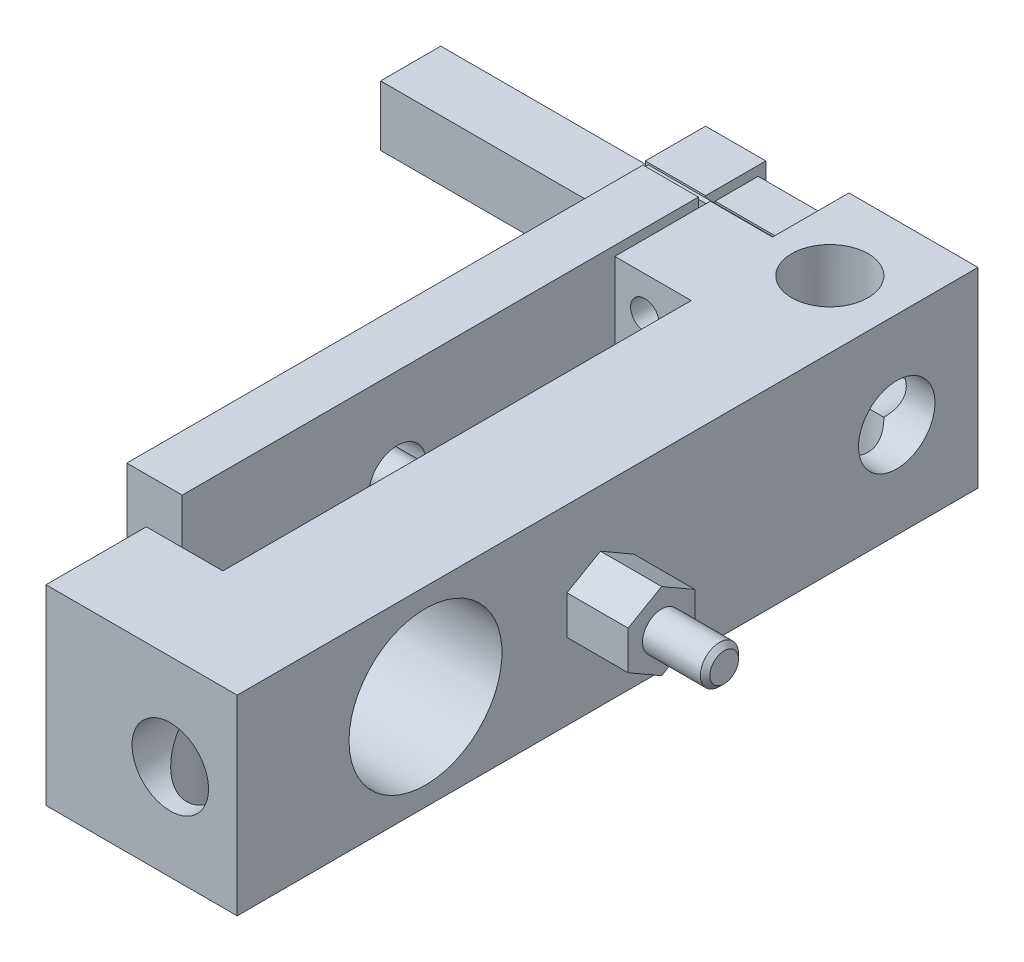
ISO-10303-21;
HEADER;
FILE_DESCRIPTION(('STEP AP214'),'2;1');
FILE_NAME('part.step','',(''),(''),'','','');
FILE_SCHEMA(('AUTOMOTIVE_DESIGN { 1 0 10303 214 1 1 1 1 }'));
ENDSEC;
DATA;
#1=APPLICATION_CONTEXT('core data for automotive mechanical design processes');
#2=APPLICATION_PROTOCOL_DEFINITION('international standard','automotive_design',2000,#1);
#3=PRODUCT_CONTEXT('',#1,'mechanical');
#4=PRODUCT('Part','Part','',(#3));
#5=PRODUCT_RELATED_PRODUCT_CATEGORY('part','',(#4));
#6=PRODUCT_DEFINITION_FORMATION('','',#4);
#7=PRODUCT_DEFINITION_CONTEXT('part definition',#1,'design');
#8=PRODUCT_DEFINITION('design','',#6,#7);
#9=PRODUCT_DEFINITION_SHAPE('','',#8);
#10=(LENGTH_UNIT() NAMED_UNIT(*) SI_UNIT(.MILLI.,.METRE.));
#11=(NAMED_UNIT(*) PLANE_ANGLE_UNIT() SI_UNIT($,.RADIAN.));
#12=(NAMED_UNIT(*) SI_UNIT($,.STERADIAN.) SOLID_ANGLE_UNIT());
#13=UNCERTAINTY_MEASURE_WITH_UNIT(LENGTH_MEASURE(1.E-05),#10,'distance_accuracy_value','');
#14=(GEOMETRIC_REPRESENTATION_CONTEXT(3) GLOBAL_UNCERTAINTY_ASSIGNED_CONTEXT((#13)) GLOBAL_UNIT_ASSIGNED_CONTEXT((#10,
#11,#12)) REPRESENTATION_CONTEXT('',''));
#15=CARTESIAN_POINT('',(0.,0.,0.));
#16=DIRECTION('',(0.,0.,1.));
#17=DIRECTION('',(1.,0.,0.));
#18=AXIS2_PLACEMENT_3D('',#15,#16,#17);
#19=CARTESIAN_POINT('',(493.090978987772,-152.707984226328,3.99999999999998));
#20=DIRECTION('',(0.,0.,-1.));
#21=DIRECTION('',(-1.,0.,0.));
#22=AXIS2_PLACEMENT_3D('',#19,#20,#21);
#23=PLANE('',#22);
#24=DIRECTION('',(-0.500000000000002,0.866025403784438,0.));
#25=VECTOR('',#24,1.);
#26=CARTESIAN_POINT('',(492.008447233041,-153.332984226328,3.99999999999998));
#27=LINE('',#26,#25);
#28=CARTESIAN_POINT('',(493.090978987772,-155.207984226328,3.99999999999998));
#29=VERTEX_POINT('',#28);
#30=CARTESIAN_POINT('',(492.369291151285,-153.957984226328,3.99999999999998));
#31=VERTEX_POINT('',#30);
#32=EDGE_CURVE('E538',#29,#31,#27,.T.);
#33=ORIENTED_EDGE('',*,*,#32,.T.);
#34=DIRECTION('',(0.500000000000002,0.866025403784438,0.));
#35=VECTOR('',#34,1.);
#36=CARTESIAN_POINT('',(493.090978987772,-152.707984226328,3.99999999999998));
#37=LINE('',#36,#35);
#38=CARTESIAN_POINT('',(493.090978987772,-152.707984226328,3.99999999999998));
#39=VERTEX_POINT('',#38);
#40=EDGE_CURVE('E532',#31,#39,#37,.T.);
#41=ORIENTED_EDGE('',*,*,#40,.T.);
#42=DIRECTION('',(1.,0.,0.));
#43=VECTOR('',#42,1.);
#44=CARTESIAN_POINT('',(493.090978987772,-152.707984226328,3.99999999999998));
#45=LINE('',#44,#43);
#46=CARTESIAN_POINT('',(494.534354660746,-152.707984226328,3.99999999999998));
#47=VERTEX_POINT('',#46);
#48=EDGE_CURVE('E526',#39,#47,#45,.T.);
#49=ORIENTED_EDGE('',*,*,#48,.T.);
#50=DIRECTION('',(0.500000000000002,-0.866025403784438,0.));
#51=VECTOR('',#50,1.);
#52=CARTESIAN_POINT('',(494.173510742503,-152.082984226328,3.99999999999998));
#53=LINE('',#52,#51);
#54=CARTESIAN_POINT('',(495.256042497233,-153.957984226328,3.99999999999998));
#55=VERTEX_POINT('',#54);
#56=EDGE_CURVE('E559',#47,#55,#53,.T.);
#57=ORIENTED_EDGE('',*,*,#56,.T.);
#58=DIRECTION('',(-0.500000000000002,-0.866025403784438,0.));
#59=VECTOR('',#58,1.);
#60=CARTESIAN_POINT('',(495.256042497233,-153.957984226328,3.99999999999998));
#61=LINE('',#60,#59);
#62=CARTESIAN_POINT('',(494.534354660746,-155.207984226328,3.99999999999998));
#63=VERTEX_POINT('',#62);
#64=EDGE_CURVE('E550',#55,#63,#61,.T.);
#65=ORIENTED_EDGE('',*,*,#64,.T.);
#66=DIRECTION('',(-1.,0.,0.));
#67=VECTOR('',#66,1.);
#68=CARTESIAN_POINT('',(493.090978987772,-155.207984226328,3.99999999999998));
#69=LINE('',#68,#67);
#70=EDGE_CURVE('E544',#63,#29,#69,.T.);
#71=ORIENTED_EDGE('',*,*,#70,.T.);
#72=EDGE_LOOP('',(#33,#41,#49,#57,#65,#71));
#73=FACE_BOUND('',#72,.T.);
#74=ADVANCED_FACE('F30',(#73),#23,.T.);
#75=CARTESIAN_POINT('',(493.090978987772,-140.207984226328,3.99999999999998));
#76=DIRECTION('',(0.,0.,-1.));
#77=DIRECTION('',(-1.,0.,0.));
#78=AXIS2_PLACEMENT_3D('',#75,#76,#77);
#79=PLANE('',#78);
#80=DIRECTION('',(-0.500000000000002,0.866025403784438,0.));
#81=VECTOR('',#80,1.);
#82=CARTESIAN_POINT('',(492.008447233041,-140.832984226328,3.99999999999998));
#83=LINE('',#82,#81);
#84=CARTESIAN_POINT('',(493.090978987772,-142.707984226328,3.99999999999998));
#85=VERTEX_POINT('',#84);
#86=CARTESIAN_POINT('',(492.369291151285,-141.457984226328,3.99999999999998));
#87=VERTEX_POINT('',#86);
#88=EDGE_CURVE('E573',#85,#87,#83,.T.);
#89=ORIENTED_EDGE('',*,*,#88,.T.);
#90=DIRECTION('',(0.500000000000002,0.866025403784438,0.));
#91=VECTOR('',#90,1.);
#92=CARTESIAN_POINT('',(493.090978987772,-140.207984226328,3.99999999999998));
#93=LINE('',#92,#91);
#94=CARTESIAN_POINT('',(493.090978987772,-140.207984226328,3.99999999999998));
#95=VERTEX_POINT('',#94);
#96=EDGE_CURVE('E567',#87,#95,#93,.T.);
#97=ORIENTED_EDGE('',*,*,#96,.T.);
#98=DIRECTION('',(1.,0.,0.));
#99=VECTOR('',#98,1.);
#100=CARTESIAN_POINT('',(493.090978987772,-140.207984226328,3.99999999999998));
#101=LINE('',#100,#99);
#102=CARTESIAN_POINT('',(494.534354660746,-140.207984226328,3.99999999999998));
#103=VERTEX_POINT('',#102);
#104=EDGE_CURVE('E562',#95,#103,#101,.T.);
#105=ORIENTED_EDGE('',*,*,#104,.T.);
#106=DIRECTION('',(0.500000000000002,-0.866025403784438,0.));
#107=VECTOR('',#106,1.);
#108=CARTESIAN_POINT('',(494.173510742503,-139.582984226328,3.99999999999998));
#109=LINE('',#108,#107);
#110=CARTESIAN_POINT('',(495.256042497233,-141.457984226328,3.99999999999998));
#111=VERTEX_POINT('',#110);
#112=EDGE_CURVE('E594',#103,#111,#109,.T.);
#113=ORIENTED_EDGE('',*,*,#112,.T.);
#114=DIRECTION('',(-0.500000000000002,-0.866025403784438,0.));
#115=VECTOR('',#114,1.);
#116=CARTESIAN_POINT('',(495.256042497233,-141.457984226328,3.99999999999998));
#117=LINE('',#116,#115);
#118=CARTESIAN_POINT('',(494.534354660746,-142.707984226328,3.99999999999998));
#119=VERTEX_POINT('',#118);
#120=EDGE_CURVE('E585',#111,#119,#117,.T.);
#121=ORIENTED_EDGE('',*,*,#120,.T.);
#122=DIRECTION('',(-1.,0.,0.));
#123=VECTOR('',#122,1.);
#124=CARTESIAN_POINT('',(493.090978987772,-142.707984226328,3.99999999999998));
#125=LINE('',#124,#123);
#126=EDGE_CURVE('E579',#119,#85,#125,.T.);
#127=ORIENTED_EDGE('',*,*,#126,.T.);
#128=EDGE_LOOP('',(#89,#97,#105,#113,#121,#127));
#129=FACE_BOUND('',#128,.T.);
#130=ADVANCED_FACE('F1703',(#129),#79,.T.);
#131=CARTESIAN_POINT('',(493.090978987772,-152.707984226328,2.5));
#132=DIRECTION('',(0.,1.,0.));
#133=DIRECTION('',(0.,0.,1.));
#134=AXIS2_PLACEMENT_3D('',#131,#132,#133);
#135=PLANE('',#134);
#136=DIRECTION('',(0.,0.,1.));
#137=VECTOR('',#136,1.);
#138=CARTESIAN_POINT('',(493.090978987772,-152.707984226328,2.5));
#139=LINE('',#138,#137);
#140=CARTESIAN_POINT('',(493.090978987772,-152.707984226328,2.5));
#141=VERTEX_POINT('',#140);
#142=EDGE_CURVE('E528',#39,#141,#139,.F.);
#143=ORIENTED_EDGE('',*,*,#142,.T.);
#144=DIRECTION('',(1.,0.,0.));
#145=VECTOR('',#144,1.);
#146=CARTESIAN_POINT('',(493.812666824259,-152.707984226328,2.5));
#147=LINE('',#146,#145);
#148=CARTESIAN_POINT('',(494.534354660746,-152.707984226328,2.5));
#149=VERTEX_POINT('',#148);
#150=EDGE_CURVE('E597',#149,#141,#147,.F.);
#151=ORIENTED_EDGE('',*,*,#150,.F.);
#152=DIRECTION('',(0.,0.,-1.));
#153=VECTOR('',#152,1.);
#154=CARTESIAN_POINT('',(494.534354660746,-152.707984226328,2.5));
#155=LINE('',#154,#153);
#156=EDGE_CURVE('E556',#149,#47,#155,.F.);
#157=ORIENTED_EDGE('',*,*,#156,.T.);
#158=ORIENTED_EDGE('',*,*,#48,.F.);
#159=EDGE_LOOP('',(#143,#151,#157,#158));
#160=FACE_BOUND('',#159,.T.);
#161=ADVANCED_FACE('F1699',(#160),#135,.F.);
#162=CARTESIAN_POINT('',(492.369291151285,-153.957984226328,2.5));
#163=DIRECTION('',(-0.866025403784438,0.500000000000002,0.));
#164=DIRECTION('',(-0.500000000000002,-0.866025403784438,0.));
#165=AXIS2_PLACEMENT_3D('',#162,#163,#164);
#166=PLANE('',#165);
#167=DIRECTION('',(0.,0.,1.));
#168=VECTOR('',#167,1.);
#169=CARTESIAN_POINT('',(492.369291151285,-153.957984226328,2.5));
#170=LINE('',#169,#168);
#171=CARTESIAN_POINT('',(492.369291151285,-153.957984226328,2.5));
#172=VERTEX_POINT('',#171);
#173=EDGE_CURVE('E535',#31,#172,#170,.F.);
#174=ORIENTED_EDGE('',*,*,#173,.T.);
#175=DIRECTION('',(0.500000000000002,0.866025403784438,0.));
#176=VECTOR('',#175,1.);
#177=CARTESIAN_POINT('',(492.730135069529,-153.332984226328,2.5));
#178=LINE('',#177,#176);
#179=EDGE_CURVE('E599',#141,#172,#178,.F.);
#180=ORIENTED_EDGE('',*,*,#179,.F.);
#181=ORIENTED_EDGE('',*,*,#142,.F.);
#182=ORIENTED_EDGE('',*,*,#40,.F.);
#183=EDGE_LOOP('',(#174,#180,#181,#182));
#184=FACE_BOUND('',#183,.T.);
#185=ADVANCED_FACE('F1695',(#184),#166,.F.);
#186=CARTESIAN_POINT('',(493.090978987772,-155.207984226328,2.5));
#187=DIRECTION('',(-0.866025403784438,-0.500000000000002,0.));
#188=DIRECTION('',(0.500000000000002,-0.866025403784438,0.));
#189=AXIS2_PLACEMENT_3D('',#186,#187,#188);
#190=PLANE('',#189);
#191=DIRECTION('',(0.,0.,1.));
#192=VECTOR('',#191,1.);
#193=CARTESIAN_POINT('',(493.090978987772,-155.207984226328,2.5));
#194=LINE('',#193,#192);
#195=CARTESIAN_POINT('',(493.090978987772,-155.207984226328,2.5));
#196=VERTEX_POINT('',#195);
#197=EDGE_CURVE('E541',#29,#196,#194,.F.);
#198=ORIENTED_EDGE('',*,*,#197,.T.);
#199=DIRECTION('',(-0.500000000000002,0.866025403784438,0.));
#200=VECTOR('',#199,1.);
#201=CARTESIAN_POINT('',(492.730135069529,-154.582984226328,2.5));
#202=LINE('',#201,#200);
#203=EDGE_CURVE('E601',#172,#196,#202,.F.);
#204=ORIENTED_EDGE('',*,*,#203,.F.);
#205=ORIENTED_EDGE('',*,*,#173,.F.);
#206=ORIENTED_EDGE('',*,*,#32,.F.);
#207=EDGE_LOOP('',(#198,#204,#205,#206));
#208=FACE_BOUND('',#207,.T.);
#209=ADVANCED_FACE('F1691',(#208),#190,.F.);
#210=CARTESIAN_POINT('',(494.534354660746,-155.207984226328,2.5));
#211=DIRECTION('',(0.,-1.,0.));
#212=DIRECTION('',(0.,0.,-1.));
#213=AXIS2_PLACEMENT_3D('',#210,#211,#212);
#214=PLANE('',#213);
#215=DIRECTION('',(0.,0.,1.));
#216=VECTOR('',#215,1.);
#217=CARTESIAN_POINT('',(494.534354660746,-155.207984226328,2.5));
#218=LINE('',#217,#216);
#219=CARTESIAN_POINT('',(494.534354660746,-155.207984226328,2.5));
#220=VERTEX_POINT('',#219);
#221=EDGE_CURVE('E547',#63,#220,#218,.F.);
#222=ORIENTED_EDGE('',*,*,#221,.T.);
#223=DIRECTION('',(-1.,0.,0.));
#224=VECTOR('',#223,1.);
#225=CARTESIAN_POINT('',(493.812666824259,-155.207984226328,2.5));
#226=LINE('',#225,#224);
#227=EDGE_CURVE('E603',#196,#220,#226,.F.);
#228=ORIENTED_EDGE('',*,*,#227,.F.);
#229=ORIENTED_EDGE('',*,*,#197,.F.);
#230=ORIENTED_EDGE('',*,*,#70,.F.);
#231=EDGE_LOOP('',(#222,#228,#229,#230));
#232=FACE_BOUND('',#231,.T.);
#233=ADVANCED_FACE('F1687',(#232),#214,.F.);
#234=CARTESIAN_POINT('',(495.256042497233,-153.957984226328,2.5));
#235=DIRECTION('',(0.866025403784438,-0.500000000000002,0.));
#236=DIRECTION('',(0.500000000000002,0.866025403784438,0.));
#237=AXIS2_PLACEMENT_3D('',#234,#235,#236);
#238=PLANE('',#237);
#239=DIRECTION('',(0.,0.,1.));
#240=VECTOR('',#239,1.);
#241=CARTESIAN_POINT('',(495.256042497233,-153.957984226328,2.5));
#242=LINE('',#241,#240);
#243=CARTESIAN_POINT('',(495.256042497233,-153.957984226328,2.5));
#244=VERTEX_POINT('',#243);
#245=EDGE_CURVE('E553',#55,#244,#242,.F.);
#246=ORIENTED_EDGE('',*,*,#245,.T.);
#247=DIRECTION('',(-0.500000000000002,-0.866025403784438,0.));
#248=VECTOR('',#247,1.);
#249=CARTESIAN_POINT('',(494.89519857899,-154.582984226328,2.5));
#250=LINE('',#249,#248);
#251=EDGE_CURVE('E605',#220,#244,#250,.F.);
#252=ORIENTED_EDGE('',*,*,#251,.F.);
#253=ORIENTED_EDGE('',*,*,#221,.F.);
#254=ORIENTED_EDGE('',*,*,#64,.F.);
#255=EDGE_LOOP('',(#246,#252,#253,#254));
#256=FACE_BOUND('',#255,.T.);
#257=ADVANCED_FACE('F1683',(#256),#238,.F.);
#258=CARTESIAN_POINT('',(494.534354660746,-152.707984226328,2.5));
#259=DIRECTION('',(0.866025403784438,0.500000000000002,0.));
#260=DIRECTION('',(-0.500000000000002,0.866025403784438,0.));
#261=AXIS2_PLACEMENT_3D('',#258,#259,#260);
#262=PLANE('',#261);
#263=ORIENTED_EDGE('',*,*,#156,.F.);
#264=DIRECTION('',(0.500000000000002,-0.866025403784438,0.));
#265=VECTOR('',#264,1.);
#266=CARTESIAN_POINT('',(494.89519857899,-153.332984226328,2.5));
#267=LINE('',#266,#265);
#268=EDGE_CURVE('E607',#244,#149,#267,.F.);
#269=ORIENTED_EDGE('',*,*,#268,.F.);
#270=ORIENTED_EDGE('',*,*,#245,.F.);
#271=ORIENTED_EDGE('',*,*,#56,.F.);
#272=EDGE_LOOP('',(#263,#269,#270,#271));
#273=FACE_BOUND('',#272,.T.);
#274=ADVANCED_FACE('F1679',(#273),#262,.F.);
#275=CARTESIAN_POINT('',(493.090978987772,-140.207984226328,2.5));
#276=DIRECTION('',(0.,1.,0.));
#277=DIRECTION('',(0.,0.,1.));
#278=AXIS2_PLACEMENT_3D('',#275,#276,#277);
#279=PLANE('',#278);
#280=DIRECTION('',(0.,0.,1.));
#281=VECTOR('',#280,1.);
#282=CARTESIAN_POINT('',(493.090978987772,-140.207984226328,2.5));
#283=LINE('',#282,#281);
#284=CARTESIAN_POINT('',(493.090978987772,-140.207984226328,2.5));
#285=VERTEX_POINT('',#284);
#286=EDGE_CURVE('E564',#95,#285,#283,.F.);
#287=ORIENTED_EDGE('',*,*,#286,.T.);
#288=DIRECTION('',(1.,0.,0.));
#289=VECTOR('',#288,1.);
#290=CARTESIAN_POINT('',(493.812666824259,-140.207984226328,2.5));
#291=LINE('',#290,#289);
#292=CARTESIAN_POINT('',(494.534354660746,-140.207984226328,2.5));
#293=VERTEX_POINT('',#292);
#294=EDGE_CURVE('E610',#293,#285,#291,.F.);
#295=ORIENTED_EDGE('',*,*,#294,.F.);
#296=DIRECTION('',(0.,0.,-1.));
#297=VECTOR('',#296,1.);
#298=CARTESIAN_POINT('',(494.534354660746,-140.207984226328,2.5));
#299=LINE('',#298,#297);
#300=EDGE_CURVE('E591',#293,#103,#299,.F.);
#301=ORIENTED_EDGE('',*,*,#300,.T.);
#302=ORIENTED_EDGE('',*,*,#104,.F.);
#303=EDGE_LOOP('',(#287,#295,#301,#302));
#304=FACE_BOUND('',#303,.T.);
#305=ADVANCED_FACE('F1675',(#304),#279,.F.);
#306=CARTESIAN_POINT('',(492.369291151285,-141.457984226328,2.5));
#307=DIRECTION('',(-0.866025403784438,0.500000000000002,0.));
#308=DIRECTION('',(-0.500000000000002,-0.866025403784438,0.));
#309=AXIS2_PLACEMENT_3D('',#306,#307,#308);
#310=PLANE('',#309);
#311=DIRECTION('',(0.,0.,1.));
#312=VECTOR('',#311,1.);
#313=CARTESIAN_POINT('',(492.369291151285,-141.457984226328,2.5));
#314=LINE('',#313,#312);
#315=CARTESIAN_POINT('',(492.369291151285,-141.457984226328,2.5));
#316=VERTEX_POINT('',#315);
#317=EDGE_CURVE('E570',#87,#316,#314,.F.);
#318=ORIENTED_EDGE('',*,*,#317,.T.);
#319=DIRECTION('',(0.500000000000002,0.866025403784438,0.));
#320=VECTOR('',#319,1.);
#321=CARTESIAN_POINT('',(492.730135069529,-140.832984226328,2.5));
#322=LINE('',#321,#320);
#323=EDGE_CURVE('E612',#285,#316,#322,.F.);
#324=ORIENTED_EDGE('',*,*,#323,.F.);
#325=ORIENTED_EDGE('',*,*,#286,.F.);
#326=ORIENTED_EDGE('',*,*,#96,.F.);
#327=EDGE_LOOP('',(#318,#324,#325,#326));
#328=FACE_BOUND('',#327,.T.);
#329=ADVANCED_FACE('F1671',(#328),#310,.F.);
#330=CARTESIAN_POINT('',(493.090978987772,-142.707984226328,2.5));
#331=DIRECTION('',(-0.866025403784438,-0.500000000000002,0.));
#332=DIRECTION('',(0.500000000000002,-0.866025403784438,0.));
#333=AXIS2_PLACEMENT_3D('',#330,#331,#332);
#334=PLANE('',#333);
#335=DIRECTION('',(0.,0.,1.));
#336=VECTOR('',#335,1.);
#337=CARTESIAN_POINT('',(493.090978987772,-142.707984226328,2.5));
#338=LINE('',#337,#336);
#339=CARTESIAN_POINT('',(493.090978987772,-142.707984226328,2.5));
#340=VERTEX_POINT('',#339);
#341=EDGE_CURVE('E576',#85,#340,#338,.F.);
#342=ORIENTED_EDGE('',*,*,#341,.T.);
#343=DIRECTION('',(-0.500000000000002,0.866025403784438,0.));
#344=VECTOR('',#343,1.);
#345=CARTESIAN_POINT('',(492.730135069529,-142.082984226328,2.5));
#346=LINE('',#345,#344);
#347=EDGE_CURVE('E614',#316,#340,#346,.F.);
#348=ORIENTED_EDGE('',*,*,#347,.F.);
#349=ORIENTED_EDGE('',*,*,#317,.F.);
#350=ORIENTED_EDGE('',*,*,#88,.F.);
#351=EDGE_LOOP('',(#342,#348,#349,#350));
#352=FACE_BOUND('',#351,.T.);
#353=ADVANCED_FACE('F1667',(#352),#334,.F.);
#354=CARTESIAN_POINT('',(494.534354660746,-142.707984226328,2.5));
#355=DIRECTION('',(0.,-1.,0.));
#356=DIRECTION('',(0.,0.,-1.));
#357=AXIS2_PLACEMENT_3D('',#354,#355,#356);
#358=PLANE('',#357);
#359=DIRECTION('',(0.,0.,1.));
#360=VECTOR('',#359,1.);
#361=CARTESIAN_POINT('',(494.534354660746,-142.707984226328,2.5));
#362=LINE('',#361,#360);
#363=CARTESIAN_POINT('',(494.534354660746,-142.707984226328,2.5));
#364=VERTEX_POINT('',#363);
#365=EDGE_CURVE('E582',#119,#364,#362,.F.);
#366=ORIENTED_EDGE('',*,*,#365,.T.);
#367=DIRECTION('',(-1.,0.,0.));
#368=VECTOR('',#367,1.);
#369=CARTESIAN_POINT('',(493.812666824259,-142.707984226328,2.5));
#370=LINE('',#369,#368);
#371=EDGE_CURVE('E616',#340,#364,#370,.F.);
#372=ORIENTED_EDGE('',*,*,#371,.F.);
#373=ORIENTED_EDGE('',*,*,#341,.F.);
#374=ORIENTED_EDGE('',*,*,#126,.F.);
#375=EDGE_LOOP('',(#366,#372,#373,#374));
#376=FACE_BOUND('',#375,.T.);
#377=ADVANCED_FACE('F1663',(#376),#358,.F.);
#378=CARTESIAN_POINT('',(495.256042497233,-141.457984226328,2.5));
#379=DIRECTION('',(0.866025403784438,-0.500000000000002,0.));
#380=DIRECTION('',(0.500000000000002,0.866025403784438,0.));
#381=AXIS2_PLACEMENT_3D('',#378,#379,#380);
#382=PLANE('',#381);
#383=DIRECTION('',(0.,0.,1.));
#384=VECTOR('',#383,1.);
#385=CARTESIAN_POINT('',(495.256042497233,-141.457984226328,2.5));
#386=LINE('',#385,#384);
#387=CARTESIAN_POINT('',(495.256042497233,-141.457984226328,2.5));
#388=VERTEX_POINT('',#387);
#389=EDGE_CURVE('E588',#111,#388,#386,.F.);
#390=ORIENTED_EDGE('',*,*,#389,.T.);
#391=DIRECTION('',(-0.500000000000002,-0.866025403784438,0.));
#392=VECTOR('',#391,1.);
#393=CARTESIAN_POINT('',(494.89519857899,-142.082984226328,2.5));
#394=LINE('',#393,#392);
#395=EDGE_CURVE('E618',#364,#388,#394,.F.);
#396=ORIENTED_EDGE('',*,*,#395,.F.);
#397=ORIENTED_EDGE('',*,*,#365,.F.);
#398=ORIENTED_EDGE('',*,*,#120,.F.);
#399=EDGE_LOOP('',(#390,#396,#397,#398));
#400=FACE_BOUND('',#399,.T.);
#401=ADVANCED_FACE('F1659',(#400),#382,.F.);
#402=CARTESIAN_POINT('',(494.534354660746,-140.207984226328,2.5));
#403=DIRECTION('',(0.866025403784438,0.500000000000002,0.));
#404=DIRECTION('',(-0.500000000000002,0.866025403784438,0.));
#405=AXIS2_PLACEMENT_3D('',#402,#403,#404);
#406=PLANE('',#405);
#407=ORIENTED_EDGE('',*,*,#300,.F.);
#408=DIRECTION('',(0.500000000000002,-0.866025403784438,0.));
#409=VECTOR('',#408,1.);
#410=CARTESIAN_POINT('',(494.89519857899,-140.832984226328,2.5));
#411=LINE('',#410,#409);
#412=EDGE_CURVE('E620',#388,#293,#411,.F.);
#413=ORIENTED_EDGE('',*,*,#412,.F.);
#414=ORIENTED_EDGE('',*,*,#389,.F.);
#415=ORIENTED_EDGE('',*,*,#112,.F.);
#416=EDGE_LOOP('',(#407,#413,#414,#415));
#417=FACE_BOUND('',#416,.T.);
#418=ADVANCED_FACE('F1655',(#417),#406,.F.);
#419=CARTESIAN_POINT('',(485.790978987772,-140.207984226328,3.19999999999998));
#420=DIRECTION('',(0.,0.,-1.));
#421=DIRECTION('',(-1.,0.,0.));
#422=AXIS2_PLACEMENT_3D('',#419,#420,#421);
#423=PLANE('',#422);
#424=DIRECTION('',(-0.500000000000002,0.866025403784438,0.));
#425=VECTOR('',#424,1.);
#426=CARTESIAN_POINT('',(484.708447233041,-140.832984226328,3.19999999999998));
#427=LINE('',#426,#425);
#428=CARTESIAN_POINT('',(485.790978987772,-142.707984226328,3.19999999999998));
#429=VERTEX_POINT('',#428);
#430=CARTESIAN_POINT('',(485.069291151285,-141.457984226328,3.19999999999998));
#431=VERTEX_POINT('',#430);
#432=EDGE_CURVE('E634',#429,#431,#427,.T.);
#433=ORIENTED_EDGE('',*,*,#432,.T.);
#434=DIRECTION('',(0.500000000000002,0.866025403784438,0.));
#435=VECTOR('',#434,1.);
#436=CARTESIAN_POINT('',(485.790978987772,-140.207984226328,3.19999999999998));
#437=LINE('',#436,#435);
#438=CARTESIAN_POINT('',(485.790978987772,-140.207984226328,3.19999999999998));
#439=VERTEX_POINT('',#438);
#440=EDGE_CURVE('E628',#431,#439,#437,.T.);
#441=ORIENTED_EDGE('',*,*,#440,.T.);
#442=DIRECTION('',(1.,0.,0.));
#443=VECTOR('',#442,1.);
#444=CARTESIAN_POINT('',(485.790978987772,-140.207984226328,3.19999999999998));
#445=LINE('',#444,#443);
#446=CARTESIAN_POINT('',(487.234354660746,-140.207984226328,3.19999999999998));
#447=VERTEX_POINT('',#446);
#448=EDGE_CURVE('E623',#439,#447,#445,.T.);
#449=ORIENTED_EDGE('',*,*,#448,.T.);
#450=DIRECTION('',(0.500000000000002,-0.866025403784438,0.));
#451=VECTOR('',#450,1.);
#452=CARTESIAN_POINT('',(486.873510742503,-139.582984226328,3.19999999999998));
#453=LINE('',#452,#451);
#454=CARTESIAN_POINT('',(487.956042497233,-141.457984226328,3.19999999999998));
#455=VERTEX_POINT('',#454);
#456=EDGE_CURVE('E655',#447,#455,#453,.T.);
#457=ORIENTED_EDGE('',*,*,#456,.T.);
#458=DIRECTION('',(-0.500000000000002,-0.866025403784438,0.));
#459=VECTOR('',#458,1.);
#460=CARTESIAN_POINT('',(487.956042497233,-141.457984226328,3.19999999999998));
#461=LINE('',#460,#459);
#462=CARTESIAN_POINT('',(487.234354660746,-142.707984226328,3.19999999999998));
#463=VERTEX_POINT('',#462);
#464=EDGE_CURVE('E646',#455,#463,#461,.T.);
#465=ORIENTED_EDGE('',*,*,#464,.T.);
#466=DIRECTION('',(-1.,0.,0.));
#467=VECTOR('',#466,1.);
#468=CARTESIAN_POINT('',(485.790978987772,-142.707984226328,3.19999999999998));
#469=LINE('',#468,#467);
#470=EDGE_CURVE('E640',#463,#429,#469,.T.);
#471=ORIENTED_EDGE('',*,*,#470,.T.);
#472=EDGE_LOOP('',(#433,#441,#449,#457,#465,#471));
#473=FACE_BOUND('',#472,.T.);
#474=ADVANCED_FACE('F1651',(#473),#423,.T.);
#475=CARTESIAN_POINT('',(485.790978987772,-152.707984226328,3.19999999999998));
#476=DIRECTION('',(0.,0.,-1.));
#477=DIRECTION('',(-1.,0.,0.));
#478=AXIS2_PLACEMENT_3D('',#475,#476,#477);
#479=PLANE('',#478);
#480=DIRECTION('',(-0.500000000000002,0.866025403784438,0.));
#481=VECTOR('',#480,1.);
#482=CARTESIAN_POINT('',(484.708447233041,-153.332984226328,3.19999999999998));
#483=LINE('',#482,#481);
#484=CARTESIAN_POINT('',(485.790978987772,-155.207984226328,3.19999999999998));
#485=VERTEX_POINT('',#484);
#486=CARTESIAN_POINT('',(485.069291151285,-153.957984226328,3.19999999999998));
#487=VERTEX_POINT('',#486);
#488=EDGE_CURVE('E669',#485,#487,#483,.T.);
#489=ORIENTED_EDGE('',*,*,#488,.T.);
#490=DIRECTION('',(0.500000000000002,0.866025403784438,0.));
#491=VECTOR('',#490,1.);
#492=CARTESIAN_POINT('',(485.790978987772,-152.707984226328,3.19999999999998));
#493=LINE('',#492,#491);
#494=CARTESIAN_POINT('',(485.790978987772,-152.707984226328,3.19999999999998));
#495=VERTEX_POINT('',#494);
#496=EDGE_CURVE('E663',#487,#495,#493,.T.);
#497=ORIENTED_EDGE('',*,*,#496,.T.);
#498=DIRECTION('',(1.,0.,0.));
#499=VECTOR('',#498,1.);
#500=CARTESIAN_POINT('',(485.790978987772,-152.707984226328,3.19999999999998));
#501=LINE('',#500,#499);
#502=CARTESIAN_POINT('',(487.234354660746,-152.707984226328,3.19999999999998));
#503=VERTEX_POINT('',#502);
#504=EDGE_CURVE('E658',#495,#503,#501,.T.);
#505=ORIENTED_EDGE('',*,*,#504,.T.);
#506=DIRECTION('',(0.500000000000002,-0.866025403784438,0.));
#507=VECTOR('',#506,1.);
#508=CARTESIAN_POINT('',(486.873510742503,-152.082984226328,3.19999999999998));
#509=LINE('',#508,#507);
#510=CARTESIAN_POINT('',(487.956042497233,-153.957984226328,3.19999999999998));
#511=VERTEX_POINT('',#510);
#512=EDGE_CURVE('E690',#503,#511,#509,.T.);
#513=ORIENTED_EDGE('',*,*,#512,.T.);
#514=DIRECTION('',(-0.500000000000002,-0.866025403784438,0.));
#515=VECTOR('',#514,1.);
#516=CARTESIAN_POINT('',(487.956042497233,-153.957984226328,3.19999999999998));
#517=LINE('',#516,#515);
#518=CARTESIAN_POINT('',(487.234354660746,-155.207984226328,3.19999999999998));
#519=VERTEX_POINT('',#518);
#520=EDGE_CURVE('E681',#511,#519,#517,.T.);
#521=ORIENTED_EDGE('',*,*,#520,.T.);
#522=DIRECTION('',(-1.,0.,0.));
#523=VECTOR('',#522,1.);
#524=CARTESIAN_POINT('',(485.790978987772,-155.207984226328,3.19999999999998));
#525=LINE('',#524,#523);
#526=EDGE_CURVE('E675',#519,#485,#525,.T.);
#527=ORIENTED_EDGE('',*,*,#526,.T.);
#528=EDGE_LOOP('',(#489,#497,#505,#513,#521,#527));
#529=FACE_BOUND('',#528,.T.);
#530=ADVANCED_FACE('F1647',(#529),#479,.T.);
#531=CARTESIAN_POINT('',(493.812666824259,-153.957984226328,2.5));
#532=DIRECTION('',(0.,0.,-1.));
#533=DIRECTION('',(-1.,0.,0.));
#534=AXIS2_PLACEMENT_3D('',#531,#532,#533);
#535=PLANE('',#534);
#536=CARTESIAN_POINT('',(493.812666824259,-153.957984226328,2.5));
#537=DIRECTION('',(0.,0.,-1.));
#538=DIRECTION('',(-1.,0.,0.));
#539=AXIS2_PLACEMENT_3D('',#536,#537,#538);
#540=CIRCLE('',#539,2.74999999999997);
#541=CARTESIAN_POINT('',(491.062666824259,-153.957984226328,2.5));
#542=VERTEX_POINT('',#541);
#543=EDGE_CURVE('E693',#542,#542,#540,.F.);
#544=ORIENTED_EDGE('',*,*,#543,.F.);
#545=EDGE_LOOP('',(#544));
#546=FACE_BOUND('',#545,.T.);
#547=ORIENTED_EDGE('',*,*,#251,.T.);
#548=ORIENTED_EDGE('',*,*,#268,.T.);
#549=ORIENTED_EDGE('',*,*,#150,.T.);
#550=ORIENTED_EDGE('',*,*,#179,.T.);
#551=ORIENTED_EDGE('',*,*,#203,.T.);
#552=ORIENTED_EDGE('',*,*,#227,.T.);
#553=EDGE_LOOP('',(#547,#548,#549,#550,#551,#552));
#554=FACE_BOUND('',#553,.T.);
#555=ADVANCED_FACE('F1643',(#546,#554),#535,.T.);
#556=CARTESIAN_POINT('',(493.812666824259,-141.457984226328,2.5));
#557=DIRECTION('',(0.,0.,-1.));
#558=DIRECTION('',(-1.,0.,0.));
#559=AXIS2_PLACEMENT_3D('',#556,#557,#558);
#560=PLANE('',#559);
#561=CARTESIAN_POINT('',(493.812666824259,-141.457984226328,2.5));
#562=DIRECTION('',(0.,0.,-1.));
#563=DIRECTION('',(-1.,0.,0.));
#564=AXIS2_PLACEMENT_3D('',#561,#562,#563);
#565=CIRCLE('',#564,2.74999999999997);
#566=CARTESIAN_POINT('',(491.062666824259,-141.457984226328,2.5));
#567=VERTEX_POINT('',#566);
#568=EDGE_CURVE('E696',#567,#567,#565,.F.);
#569=ORIENTED_EDGE('',*,*,#568,.F.);
#570=EDGE_LOOP('',(#569));
#571=FACE_BOUND('',#570,.T.);
#572=ORIENTED_EDGE('',*,*,#395,.T.);
#573=ORIENTED_EDGE('',*,*,#412,.T.);
#574=ORIENTED_EDGE('',*,*,#294,.T.);
#575=ORIENTED_EDGE('',*,*,#323,.T.);
#576=ORIENTED_EDGE('',*,*,#347,.T.);
#577=ORIENTED_EDGE('',*,*,#371,.T.);
#578=EDGE_LOOP('',(#572,#573,#574,#575,#576,#577));
#579=FACE_BOUND('',#578,.T.);
#580=ADVANCED_FACE('F1639',(#571,#579),#560,.T.);
#581=CARTESIAN_POINT('',(523.612666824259,-147.707984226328,39.5));
#582=DIRECTION('',(1.,0.,0.));
#583=DIRECTION('',(0.,0.,-1.));
#584=AXIS2_PLACEMENT_3D('',#581,#582,#583);
#585=PLANE('',#584);
#586=CARTESIAN_POINT('',(523.612666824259,-147.707984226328,39.5));
#587=DIRECTION('',(1.,0.,0.));
#588=DIRECTION('',(0.,0.,-1.));
#589=AXIS2_PLACEMENT_3D('',#586,#587,#588);
#590=CIRCLE('',#589,1.4999999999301);
#591=CARTESIAN_POINT('',(523.612666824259,-147.707984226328,38.0000000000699));
#592=VERTEX_POINT('',#591);
#593=EDGE_CURVE('E699',#592,#592,#590,.F.);
#594=ORIENTED_EDGE('',*,*,#593,.F.);
#595=EDGE_LOOP('',(#594));
#596=FACE_BOUND('',#595,.T.);
#597=ADVANCED_FACE('F1635',(#596),#585,.T.);
#598=CARTESIAN_POINT('',(485.790978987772,-140.207984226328,1.7));
#599=DIRECTION('',(0.,1.,0.));
#600=DIRECTION('',(0.,0.,1.));
#601=AXIS2_PLACEMENT_3D('',#598,#599,#600);
#602=PLANE('',#601);
#603=DIRECTION('',(0.,0.,1.));
#604=VECTOR('',#603,1.);
#605=CARTESIAN_POINT('',(485.790978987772,-140.207984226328,1.7));
#606=LINE('',#605,#604);
#607=CARTESIAN_POINT('',(485.790978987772,-140.207984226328,1.7));
#608=VERTEX_POINT('',#607);
#609=EDGE_CURVE('E625',#439,#608,#606,.F.);
#610=ORIENTED_EDGE('',*,*,#609,.T.);
#611=DIRECTION('',(1.,0.,0.));
#612=VECTOR('',#611,1.);
#613=CARTESIAN_POINT('',(486.512666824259,-140.207984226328,1.7));
#614=LINE('',#613,#612);
#615=CARTESIAN_POINT('',(487.234354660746,-140.207984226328,1.7));
#616=VERTEX_POINT('',#615);
#617=EDGE_CURVE('E702',#616,#608,#614,.F.);
#618=ORIENTED_EDGE('',*,*,#617,.F.);
#619=DIRECTION('',(0.,0.,-1.));
#620=VECTOR('',#619,1.);
#621=CARTESIAN_POINT('',(487.234354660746,-140.207984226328,1.7));
#622=LINE('',#621,#620);
#623=EDGE_CURVE('E652',#616,#447,#622,.F.);
#624=ORIENTED_EDGE('',*,*,#623,.T.);
#625=ORIENTED_EDGE('',*,*,#448,.F.);
#626=EDGE_LOOP('',(#610,#618,#624,#625));
#627=FACE_BOUND('',#626,.T.);
#628=ADVANCED_FACE('F1631',(#627),#602,.F.);
#629=CARTESIAN_POINT('',(485.069291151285,-141.457984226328,1.7));
#630=DIRECTION('',(-0.866025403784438,0.500000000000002,0.));
#631=DIRECTION('',(-0.500000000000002,-0.866025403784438,0.));
#632=AXIS2_PLACEMENT_3D('',#629,#630,#631);
#633=PLANE('',#632);
#634=DIRECTION('',(0.,0.,1.));
#635=VECTOR('',#634,1.);
#636=CARTESIAN_POINT('',(485.069291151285,-141.457984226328,1.7));
#637=LINE('',#636,#635);
#638=CARTESIAN_POINT('',(485.069291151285,-141.457984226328,1.7));
#639=VERTEX_POINT('',#638);
#640=EDGE_CURVE('E631',#431,#639,#637,.F.);
#641=ORIENTED_EDGE('',*,*,#640,.T.);
#642=DIRECTION('',(0.500000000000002,0.866025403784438,0.));
#643=VECTOR('',#642,1.);
#644=CARTESIAN_POINT('',(485.430135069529,-140.832984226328,1.7));
#645=LINE('',#644,#643);
#646=EDGE_CURVE('E704',#608,#639,#645,.F.);
#647=ORIENTED_EDGE('',*,*,#646,.F.);
#648=ORIENTED_EDGE('',*,*,#609,.F.);
#649=ORIENTED_EDGE('',*,*,#440,.F.);
#650=EDGE_LOOP('',(#641,#647,#648,#649));
#651=FACE_BOUND('',#650,.T.);
#652=ADVANCED_FACE('F1627',(#651),#633,.F.);
#653=CARTESIAN_POINT('',(485.790978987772,-142.707984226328,1.7));
#654=DIRECTION('',(-0.866025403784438,-0.500000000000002,0.));
#655=DIRECTION('',(0.500000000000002,-0.866025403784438,0.));
#656=AXIS2_PLACEMENT_3D('',#653,#654,#655);
#657=PLANE('',#656);
#658=DIRECTION('',(0.,0.,1.));
#659=VECTOR('',#658,1.);
#660=CARTESIAN_POINT('',(485.790978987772,-142.707984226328,1.7));
#661=LINE('',#660,#659);
#662=CARTESIAN_POINT('',(485.790978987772,-142.707984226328,1.7));
#663=VERTEX_POINT('',#662);
#664=EDGE_CURVE('E637',#429,#663,#661,.F.);
#665=ORIENTED_EDGE('',*,*,#664,.T.);
#666=DIRECTION('',(-0.500000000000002,0.866025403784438,0.));
#667=VECTOR('',#666,1.);
#668=CARTESIAN_POINT('',(485.430135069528,-142.082984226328,1.7));
#669=LINE('',#668,#667);
#670=EDGE_CURVE('E706',#639,#663,#669,.F.);
#671=ORIENTED_EDGE('',*,*,#670,.F.);
#672=ORIENTED_EDGE('',*,*,#640,.F.);
#673=ORIENTED_EDGE('',*,*,#432,.F.);
#674=EDGE_LOOP('',(#665,#671,#672,#673));
#675=FACE_BOUND('',#674,.T.);
#676=ADVANCED_FACE('F1623',(#675),#657,.F.);
#677=CARTESIAN_POINT('',(487.234354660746,-142.707984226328,1.7));
#678=DIRECTION('',(0.,-1.,0.));
#679=DIRECTION('',(0.,0.,-1.));
#680=AXIS2_PLACEMENT_3D('',#677,#678,#679);
#681=PLANE('',#680);
#682=DIRECTION('',(0.,0.,1.));
#683=VECTOR('',#682,1.);
#684=CARTESIAN_POINT('',(487.234354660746,-142.707984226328,1.7));
#685=LINE('',#684,#683);
#686=CARTESIAN_POINT('',(487.234354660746,-142.707984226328,1.7));
#687=VERTEX_POINT('',#686);
#688=EDGE_CURVE('E643',#463,#687,#685,.F.);
#689=ORIENTED_EDGE('',*,*,#688,.T.);
#690=DIRECTION('',(-1.,0.,0.));
#691=VECTOR('',#690,1.);
#692=CARTESIAN_POINT('',(486.512666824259,-142.707984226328,1.7));
#693=LINE('',#692,#691);
#694=EDGE_CURVE('E708',#663,#687,#693,.F.);
#695=ORIENTED_EDGE('',*,*,#694,.F.);
#696=ORIENTED_EDGE('',*,*,#664,.F.);
#697=ORIENTED_EDGE('',*,*,#470,.F.);
#698=EDGE_LOOP('',(#689,#695,#696,#697));
#699=FACE_BOUND('',#698,.T.);
#700=ADVANCED_FACE('F1619',(#699),#681,.F.);
#701=CARTESIAN_POINT('',(487.956042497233,-141.457984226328,1.7));
#702=DIRECTION('',(0.866025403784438,-0.500000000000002,0.));
#703=DIRECTION('',(0.500000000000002,0.866025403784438,0.));
#704=AXIS2_PLACEMENT_3D('',#701,#702,#703);
#705=PLANE('',#704);
#706=DIRECTION('',(0.,0.,1.));
#707=VECTOR('',#706,1.);
#708=CARTESIAN_POINT('',(487.956042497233,-141.457984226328,1.7));
#709=LINE('',#708,#707);
#710=CARTESIAN_POINT('',(487.956042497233,-141.457984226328,1.7));
#711=VERTEX_POINT('',#710);
#712=EDGE_CURVE('E649',#455,#711,#709,.F.);
#713=ORIENTED_EDGE('',*,*,#712,.T.);
#714=DIRECTION('',(-0.500000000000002,-0.866025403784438,0.));
#715=VECTOR('',#714,1.);
#716=CARTESIAN_POINT('',(487.59519857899,-142.082984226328,1.7));
#717=LINE('',#716,#715);
#718=EDGE_CURVE('E710',#687,#711,#717,.F.);
#719=ORIENTED_EDGE('',*,*,#718,.F.);
#720=ORIENTED_EDGE('',*,*,#688,.F.);
#721=ORIENTED_EDGE('',*,*,#464,.F.);
#722=EDGE_LOOP('',(#713,#719,#720,#721));
#723=FACE_BOUND('',#722,.T.);
#724=ADVANCED_FACE('F1615',(#723),#705,.F.);
#725=CARTESIAN_POINT('',(487.234354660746,-140.207984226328,1.7));
#726=DIRECTION('',(0.866025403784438,0.500000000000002,0.));
#727=DIRECTION('',(-0.500000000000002,0.866025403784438,0.));
#728=AXIS2_PLACEMENT_3D('',#725,#726,#727);
#729=PLANE('',#728);
#730=ORIENTED_EDGE('',*,*,#623,.F.);
#731=DIRECTION('',(0.500000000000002,-0.866025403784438,0.));
#732=VECTOR('',#731,1.);
#733=CARTESIAN_POINT('',(487.59519857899,-140.832984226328,1.7));
#734=LINE('',#733,#732);
#735=EDGE_CURVE('E712',#711,#616,#734,.F.);
#736=ORIENTED_EDGE('',*,*,#735,.F.);
#737=ORIENTED_EDGE('',*,*,#712,.F.);
#738=ORIENTED_EDGE('',*,*,#456,.F.);
#739=EDGE_LOOP('',(#730,#736,#737,#738));
#740=FACE_BOUND('',#739,.T.);
#741=ADVANCED_FACE('F1611',(#740),#729,.F.);
#742=CARTESIAN_POINT('',(485.790978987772,-152.707984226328,1.7));
#743=DIRECTION('',(0.,1.,0.));
#744=DIRECTION('',(0.,0.,1.));
#745=AXIS2_PLACEMENT_3D('',#742,#743,#744);
#746=PLANE('',#745);
#747=DIRECTION('',(0.,0.,1.));
#748=VECTOR('',#747,1.);
#749=CARTESIAN_POINT('',(485.790978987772,-152.707984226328,1.7));
#750=LINE('',#749,#748);
#751=CARTESIAN_POINT('',(485.790978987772,-152.707984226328,1.7));
#752=VERTEX_POINT('',#751);
#753=EDGE_CURVE('E660',#495,#752,#750,.F.);
#754=ORIENTED_EDGE('',*,*,#753,.T.);
#755=DIRECTION('',(1.,0.,0.));
#756=VECTOR('',#755,1.);
#757=CARTESIAN_POINT('',(486.512666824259,-152.707984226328,1.7));
#758=LINE('',#757,#756);
#759=CARTESIAN_POINT('',(487.234354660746,-152.707984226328,1.7));
#760=VERTEX_POINT('',#759);
#761=EDGE_CURVE('E715',#760,#752,#758,.F.);
#762=ORIENTED_EDGE('',*,*,#761,.F.);
#763=DIRECTION('',(0.,0.,-1.));
#764=VECTOR('',#763,1.);
#765=CARTESIAN_POINT('',(487.234354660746,-152.707984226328,1.7));
#766=LINE('',#765,#764);
#767=EDGE_CURVE('E687',#760,#503,#766,.F.);
#768=ORIENTED_EDGE('',*,*,#767,.T.);
#769=ORIENTED_EDGE('',*,*,#504,.F.);
#770=EDGE_LOOP('',(#754,#762,#768,#769));
#771=FACE_BOUND('',#770,.T.);
#772=ADVANCED_FACE('F1607',(#771),#746,.F.);
#773=CARTESIAN_POINT('',(485.069291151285,-153.957984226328,1.7));
#774=DIRECTION('',(-0.866025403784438,0.500000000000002,0.));
#775=DIRECTION('',(-0.500000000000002,-0.866025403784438,0.));
#776=AXIS2_PLACEMENT_3D('',#773,#774,#775);
#777=PLANE('',#776);
#778=DIRECTION('',(0.,0.,1.));
#779=VECTOR('',#778,1.);
#780=CARTESIAN_POINT('',(485.069291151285,-153.957984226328,1.7));
#781=LINE('',#780,#779);
#782=CARTESIAN_POINT('',(485.069291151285,-153.957984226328,1.7));
#783=VERTEX_POINT('',#782);
#784=EDGE_CURVE('E666',#487,#783,#781,.F.);
#785=ORIENTED_EDGE('',*,*,#784,.T.);
#786=DIRECTION('',(0.500000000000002,0.866025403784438,0.));
#787=VECTOR('',#786,1.);
#788=CARTESIAN_POINT('',(485.430135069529,-153.332984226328,1.7));
#789=LINE('',#788,#787);
#790=EDGE_CURVE('E717',#752,#783,#789,.F.);
#791=ORIENTED_EDGE('',*,*,#790,.F.);
#792=ORIENTED_EDGE('',*,*,#753,.F.);
#793=ORIENTED_EDGE('',*,*,#496,.F.);
#794=EDGE_LOOP('',(#785,#791,#792,#793));
#795=FACE_BOUND('',#794,.T.);
#796=ADVANCED_FACE('F1603',(#795),#777,.F.);
#797=CARTESIAN_POINT('',(485.790978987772,-155.207984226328,1.7));
#798=DIRECTION('',(-0.866025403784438,-0.500000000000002,0.));
#799=DIRECTION('',(0.500000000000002,-0.866025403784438,0.));
#800=AXIS2_PLACEMENT_3D('',#797,#798,#799);
#801=PLANE('',#800);
#802=DIRECTION('',(0.,0.,1.));
#803=VECTOR('',#802,1.);
#804=CARTESIAN_POINT('',(485.790978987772,-155.207984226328,1.7));
#805=LINE('',#804,#803);
#806=CARTESIAN_POINT('',(485.790978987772,-155.207984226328,1.7));
#807=VERTEX_POINT('',#806);
#808=EDGE_CURVE('E672',#485,#807,#805,.F.);
#809=ORIENTED_EDGE('',*,*,#808,.T.);
#810=DIRECTION('',(-0.500000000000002,0.866025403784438,0.));
#811=VECTOR('',#810,1.);
#812=CARTESIAN_POINT('',(485.430135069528,-154.582984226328,1.7));
#813=LINE('',#812,#811);
#814=EDGE_CURVE('E719',#783,#807,#813,.F.);
#815=ORIENTED_EDGE('',*,*,#814,.F.);
#816=ORIENTED_EDGE('',*,*,#784,.F.);
#817=ORIENTED_EDGE('',*,*,#488,.F.);
#818=EDGE_LOOP('',(#809,#815,#816,#817));
#819=FACE_BOUND('',#818,.T.);
#820=ADVANCED_FACE('F1599',(#819),#801,.F.);
#821=CARTESIAN_POINT('',(487.234354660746,-155.207984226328,1.7));
#822=DIRECTION('',(0.,-1.,0.));
#823=DIRECTION('',(0.,0.,-1.));
#824=AXIS2_PLACEMENT_3D('',#821,#822,#823);
#825=PLANE('',#824);
#826=DIRECTION('',(0.,0.,1.));
#827=VECTOR('',#826,1.);
#828=CARTESIAN_POINT('',(487.234354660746,-155.207984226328,1.7));
#829=LINE('',#828,#827);
#830=CARTESIAN_POINT('',(487.234354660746,-155.207984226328,1.7));
#831=VERTEX_POINT('',#830);
#832=EDGE_CURVE('E678',#519,#831,#829,.F.);
#833=ORIENTED_EDGE('',*,*,#832,.T.);
#834=DIRECTION('',(-1.,0.,0.));
#835=VECTOR('',#834,1.);
#836=CARTESIAN_POINT('',(486.512666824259,-155.207984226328,1.7));
#837=LINE('',#836,#835);
#838=EDGE_CURVE('E721',#807,#831,#837,.F.);
#839=ORIENTED_EDGE('',*,*,#838,.F.);
#840=ORIENTED_EDGE('',*,*,#808,.F.);
#841=ORIENTED_EDGE('',*,*,#526,.F.);
#842=EDGE_LOOP('',(#833,#839,#840,#841));
#843=FACE_BOUND('',#842,.T.);
#844=ADVANCED_FACE('F1595',(#843),#825,.F.);
#845=CARTESIAN_POINT('',(487.956042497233,-153.957984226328,1.7));
#846=DIRECTION('',(0.866025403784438,-0.500000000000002,0.));
#847=DIRECTION('',(0.500000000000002,0.866025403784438,0.));
#848=AXIS2_PLACEMENT_3D('',#845,#846,#847);
#849=PLANE('',#848);
#850=DIRECTION('',(0.,0.,1.));
#851=VECTOR('',#850,1.);
#852=CARTESIAN_POINT('',(487.956042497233,-153.957984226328,1.7));
#853=LINE('',#852,#851);
#854=CARTESIAN_POINT('',(487.956042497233,-153.957984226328,1.7));
#855=VERTEX_POINT('',#854);
#856=EDGE_CURVE('E684',#511,#855,#853,.F.);
#857=ORIENTED_EDGE('',*,*,#856,.T.);
#858=DIRECTION('',(-0.500000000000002,-0.866025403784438,0.));
#859=VECTOR('',#858,1.);
#860=CARTESIAN_POINT('',(487.59519857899,-154.582984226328,1.7));
#861=LINE('',#860,#859);
#862=EDGE_CURVE('E723',#831,#855,#861,.F.);
#863=ORIENTED_EDGE('',*,*,#862,.F.);
#864=ORIENTED_EDGE('',*,*,#832,.F.);
#865=ORIENTED_EDGE('',*,*,#520,.F.);
#866=EDGE_LOOP('',(#857,#863,#864,#865));
#867=FACE_BOUND('',#866,.T.);
#868=ADVANCED_FACE('F1591',(#867),#849,.F.);
#869=CARTESIAN_POINT('',(487.234354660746,-152.707984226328,1.7));
#870=DIRECTION('',(0.866025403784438,0.500000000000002,0.));
#871=DIRECTION('',(-0.500000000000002,0.866025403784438,0.));
#872=AXIS2_PLACEMENT_3D('',#869,#870,#871);
#873=PLANE('',#872);
#874=ORIENTED_EDGE('',*,*,#767,.F.);
#875=DIRECTION('',(0.500000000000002,-0.866025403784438,0.));
#876=VECTOR('',#875,1.);
#877=CARTESIAN_POINT('',(487.59519857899,-153.332984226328,1.7));
#878=LINE('',#877,#876);
#879=EDGE_CURVE('E725',#855,#760,#878,.F.);
#880=ORIENTED_EDGE('',*,*,#879,.F.);
#881=ORIENTED_EDGE('',*,*,#856,.F.);
#882=ORIENTED_EDGE('',*,*,#512,.F.);
#883=EDGE_LOOP('',(#874,#880,#881,#882));
#884=FACE_BOUND('',#883,.T.);
#885=ADVANCED_FACE('F1587',(#884),#873,.F.);
#886=CARTESIAN_POINT('',(493.812666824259,-153.957984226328,2.5));
#887=DIRECTION('',(0.,0.,1.));
#888=DIRECTION('',(1.,0.,0.));
#889=AXIS2_PLACEMENT_3D('',#886,#887,#888);
#890=CYLINDRICAL_SURFACE('',#889,2.74999999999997);
#891=CARTESIAN_POINT('',(493.812666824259,-153.957984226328,5.5));
#892=DIRECTION('',(0.,0.,1.));
#893=DIRECTION('',(1.,0.,0.));
#894=AXIS2_PLACEMENT_3D('',#891,#892,#893);
#895=CIRCLE('',#894,2.74999999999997);
#896=CARTESIAN_POINT('',(496.562666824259,-153.957984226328,5.5));
#897=VERTEX_POINT('',#896);
#898=EDGE_CURVE('E728',#897,#897,#895,.F.);
#899=ORIENTED_EDGE('',*,*,#898,.T.);
#900=EDGE_LOOP('',(#899));
#901=FACE_BOUND('',#900,.T.);
#902=ORIENTED_EDGE('',*,*,#543,.T.);
#903=EDGE_LOOP('',(#902));
#904=FACE_BOUND('',#903,.T.);
#905=ADVANCED_FACE('F1583',(#901,#904),#890,.T.);
#906=CARTESIAN_POINT('',(493.812666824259,-141.457984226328,2.5));
#907=DIRECTION('',(0.,0.,1.));
#908=DIRECTION('',(1.,0.,0.));
#909=AXIS2_PLACEMENT_3D('',#906,#907,#908);
#910=CYLINDRICAL_SURFACE('',#909,2.74999999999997);
#911=CARTESIAN_POINT('',(493.812666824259,-141.457984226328,5.5));
#912=DIRECTION('',(0.,0.,1.));
#913=DIRECTION('',(1.,0.,0.));
#914=AXIS2_PLACEMENT_3D('',#911,#912,#913);
#915=CIRCLE('',#914,2.74999999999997);
#916=CARTESIAN_POINT('',(496.562666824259,-141.457984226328,5.5));
#917=VERTEX_POINT('',#916);
#918=EDGE_CURVE('E731',#917,#917,#915,.F.);
#919=ORIENTED_EDGE('',*,*,#918,.T.);
#920=EDGE_LOOP('',(#919));
#921=FACE_BOUND('',#920,.T.);
#922=ORIENTED_EDGE('',*,*,#568,.T.);
#923=EDGE_LOOP('',(#922));
#924=FACE_BOUND('',#923,.T.);
#925=ADVANCED_FACE('F1579',(#921,#924),#910,.T.);
#926=CARTESIAN_POINT('',(523.112666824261,-147.707984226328,39.5));
#927=DIRECTION('',(-1.,0.,0.));
#928=DIRECTION('',(0.,0.,1.));
#929=AXIS2_PLACEMENT_3D('',#926,#927,#928);
#930=CONICAL_SURFACE('',#929,1.999999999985,0.785398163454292);
#931=CARTESIAN_POINT('',(523.112666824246,-147.707984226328,39.5));
#932=DIRECTION('',(-1.,0.,0.));
#933=DIRECTION('',(0.,0.,1.));
#934=AXIS2_PLACEMENT_3D('',#931,#932,#933);
#935=CIRCLE('',#934,2.);
#936=CARTESIAN_POINT('',(523.112666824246,-147.707984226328,41.5));
#937=VERTEX_POINT('',#936);
#938=EDGE_CURVE('E734',#937,#937,#935,.T.);
#939=ORIENTED_EDGE('',*,*,#938,.F.);
#940=EDGE_LOOP('',(#939));
#941=FACE_BOUND('',#940,.T.);
#942=ORIENTED_EDGE('',*,*,#593,.T.);
#943=EDGE_LOOP('',(#942));
#944=FACE_BOUND('',#943,.T.);
#945=ADVANCED_FACE('F1575',(#941,#944),#930,.T.);
#946=CARTESIAN_POINT('',(486.512666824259,-141.457984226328,1.7));
#947=DIRECTION('',(0.,0.,-1.));
#948=DIRECTION('',(-1.,0.,0.));
#949=AXIS2_PLACEMENT_3D('',#946,#947,#948);
#950=PLANE('',#949);
#951=CARTESIAN_POINT('',(486.512666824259,-141.457984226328,1.7));
#952=DIRECTION('',(0.,0.,-1.));
#953=DIRECTION('',(-1.,0.,0.));
#954=AXIS2_PLACEMENT_3D('',#951,#952,#953);
#955=CIRCLE('',#954,2.74999999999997);
#956=CARTESIAN_POINT('',(483.762666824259,-141.457984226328,1.7));
#957=VERTEX_POINT('',#956);
#958=EDGE_CURVE('E737',#957,#957,#955,.T.);
#959=ORIENTED_EDGE('',*,*,#958,.T.);
#960=EDGE_LOOP('',(#959));
#961=FACE_BOUND('',#960,.T.);
#962=ORIENTED_EDGE('',*,*,#718,.T.);
#963=ORIENTED_EDGE('',*,*,#735,.T.);
#964=ORIENTED_EDGE('',*,*,#617,.T.);
#965=ORIENTED_EDGE('',*,*,#646,.T.);
#966=ORIENTED_EDGE('',*,*,#670,.T.);
#967=ORIENTED_EDGE('',*,*,#694,.T.);
#968=EDGE_LOOP('',(#962,#963,#964,#965,#966,#967));
#969=FACE_BOUND('',#968,.T.);
#970=ADVANCED_FACE('F1571',(#961,#969),#950,.T.);
#971=CARTESIAN_POINT('',(486.512666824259,-153.957984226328,1.7));
#972=DIRECTION('',(0.,0.,-1.));
#973=DIRECTION('',(-1.,0.,0.));
#974=AXIS2_PLACEMENT_3D('',#971,#972,#973);
#975=PLANE('',#974);
#976=CARTESIAN_POINT('',(486.512666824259,-153.957984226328,1.7));
#977=DIRECTION('',(0.,0.,-1.));
#978=DIRECTION('',(-1.,0.,0.));
#979=AXIS2_PLACEMENT_3D('',#976,#977,#978);
#980=CIRCLE('',#979,2.74999999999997);
#981=CARTESIAN_POINT('',(483.762666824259,-153.957984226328,1.7));
#982=VERTEX_POINT('',#981);
#983=EDGE_CURVE('E740',#982,#982,#980,.T.);
#984=ORIENTED_EDGE('',*,*,#983,.T.);
#985=EDGE_LOOP('',(#984));
#986=FACE_BOUND('',#985,.T.);
#987=ORIENTED_EDGE('',*,*,#862,.T.);
#988=ORIENTED_EDGE('',*,*,#879,.T.);
#989=ORIENTED_EDGE('',*,*,#761,.T.);
#990=ORIENTED_EDGE('',*,*,#790,.T.);
#991=ORIENTED_EDGE('',*,*,#814,.T.);
#992=ORIENTED_EDGE('',*,*,#838,.T.);
#993=EDGE_LOOP('',(#987,#988,#989,#990,#991,#992));
#994=FACE_BOUND('',#993,.T.);
#995=ADVANCED_FACE('F1567',(#986,#994),#975,.T.);
#996=CARTESIAN_POINT('',(493.812666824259,-153.957984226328,5.5));
#997=DIRECTION('',(0.,0.,1.));
#998=DIRECTION('',(1.,0.,0.));
#999=AXIS2_PLACEMENT_3D('',#996,#997,#998);
#1000=PLANE('',#999);
#1001=ORIENTED_EDGE('',*,*,#898,.F.);
#1002=EDGE_LOOP('',(#1001));
#1003=FACE_BOUND('',#1002,.T.);
#1004=CARTESIAN_POINT('',(493.812666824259,-153.957984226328,5.5));
#1005=DIRECTION('',(0.,0.,1.));
#1006=DIRECTION('',(1.,0.,0.));
#1007=AXIS2_PLACEMENT_3D('',#1004,#1005,#1006);
#1008=CIRCLE('',#1007,2.80000000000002);
#1009=CARTESIAN_POINT('',(496.612666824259,-153.957984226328,5.5));
#1010=VERTEX_POINT('',#1009);
#1011=EDGE_CURVE('E743',#1010,#1010,#1008,.F.);
#1012=ORIENTED_EDGE('',*,*,#1011,.T.);
#1013=EDGE_LOOP('',(#1012));
#1014=FACE_BOUND('',#1013,.T.);
#1015=ADVANCED_FACE('F1563',(#1003,#1014),#1000,.F.);
#1016=CARTESIAN_POINT('',(493.812666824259,-141.457984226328,5.5));
#1017=DIRECTION('',(0.,0.,1.));
#1018=DIRECTION('',(1.,0.,0.));
#1019=AXIS2_PLACEMENT_3D('',#1016,#1017,#1018);
#1020=PLANE('',#1019);
#1021=ORIENTED_EDGE('',*,*,#918,.F.);
#1022=EDGE_LOOP('',(#1021));
#1023=FACE_BOUND('',#1022,.T.);
#1024=CARTESIAN_POINT('',(493.812666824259,-141.457984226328,5.5));
#1025=DIRECTION('',(0.,0.,1.));
#1026=DIRECTION('',(1.,0.,0.));
#1027=AXIS2_PLACEMENT_3D('',#1024,#1025,#1026);
#1028=CIRCLE('',#1027,2.80000000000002);
#1029=CARTESIAN_POINT('',(496.612666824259,-141.457984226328,5.5));
#1030=VERTEX_POINT('',#1029);
#1031=EDGE_CURVE('E746',#1030,#1030,#1028,.F.);
#1032=ORIENTED_EDGE('',*,*,#1031,.T.);
#1033=EDGE_LOOP('',(#1032));
#1034=FACE_BOUND('',#1033,.T.);
#1035=ADVANCED_FACE('F1559',(#1023,#1034),#1020,.F.);
#1036=CARTESIAN_POINT('',(517.062666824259,-147.707984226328,39.5));
#1037=DIRECTION('',(1.,0.,0.));
#1038=DIRECTION('',(0.,0.,-1.));
#1039=AXIS2_PLACEMENT_3D('',#1036,#1037,#1038);
#1040=CYLINDRICAL_SURFACE('',#1039,2.);
#1041=ORIENTED_EDGE('',*,*,#938,.T.);
#1042=EDGE_LOOP('',(#1041));
#1043=FACE_BOUND('',#1042,.T.);
#1044=CARTESIAN_POINT('',(517.062666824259,-147.707984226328,39.5));
#1045=DIRECTION('',(-1.,0.,0.));
#1046=DIRECTION('',(0.,-1.,0.));
#1047=AXIS2_PLACEMENT_3D('',#1044,#1045,#1046);
#1048=CIRCLE('',#1047,2.);
#1049=CARTESIAN_POINT('',(517.062666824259,-149.707984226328,39.5));
#1050=VERTEX_POINT('',#1049);
#1051=EDGE_CURVE('E749',#1050,#1050,#1048,.F.);
#1052=ORIENTED_EDGE('',*,*,#1051,.T.);
#1053=EDGE_LOOP('',(#1052));
#1054=FACE_BOUND('',#1053,.T.);
#1055=ADVANCED_FACE('F1555',(#1043,#1054),#1040,.T.);
#1056=CARTESIAN_POINT('',(486.512666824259,-141.457984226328,1.7));
#1057=DIRECTION('',(0.,0.,-1.));
#1058=DIRECTION('',(-1.,0.,0.));
#1059=AXIS2_PLACEMENT_3D('',#1056,#1057,#1058);
#1060=CYLINDRICAL_SURFACE('',#1059,2.74999999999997);
#1061=CARTESIAN_POINT('',(486.512666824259,-141.457984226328,1.2));
#1062=DIRECTION('',(0.,0.,1.));
#1063=DIRECTION('',(1.,0.,0.));
#1064=AXIS2_PLACEMENT_3D('',#1061,#1062,#1063);
#1065=CIRCLE('',#1064,2.74999999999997);
#1066=CARTESIAN_POINT('',(489.262666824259,-141.457984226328,1.2));
#1067=VERTEX_POINT('',#1066);
#1068=EDGE_CURVE('E752',#1067,#1067,#1065,.F.);
#1069=ORIENTED_EDGE('',*,*,#1068,.T.);
#1070=EDGE_LOOP('',(#1069));
#1071=FACE_BOUND('',#1070,.T.);
#1072=ORIENTED_EDGE('',*,*,#958,.F.);
#1073=EDGE_LOOP('',(#1072));
#1074=FACE_BOUND('',#1073,.T.);
#1075=ADVANCED_FACE('F1551',(#1071,#1074),#1060,.F.);
#1076=CARTESIAN_POINT('',(486.512666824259,-153.957984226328,1.7));
#1077=DIRECTION('',(0.,0.,-1.));
#1078=DIRECTION('',(-1.,0.,0.));
#1079=AXIS2_PLACEMENT_3D('',#1076,#1077,#1078);
#1080=CYLINDRICAL_SURFACE('',#1079,2.74999999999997);
#1081=CARTESIAN_POINT('',(486.512666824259,-153.957984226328,1.2));
#1082=DIRECTION('',(0.,0.,1.));
#1083=DIRECTION('',(1.,0.,0.));
#1084=AXIS2_PLACEMENT_3D('',#1081,#1082,#1083);
#1085=CIRCLE('',#1084,2.74999999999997);
#1086=CARTESIAN_POINT('',(489.262666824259,-153.957984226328,1.2));
#1087=VERTEX_POINT('',#1086);
#1088=EDGE_CURVE('E755',#1087,#1087,#1085,.F.);
#1089=ORIENTED_EDGE('',*,*,#1088,.T.);
#1090=EDGE_LOOP('',(#1089));
#1091=FACE_BOUND('',#1090,.T.);
#1092=ORIENTED_EDGE('',*,*,#983,.F.);
#1093=EDGE_LOOP('',(#1092));
#1094=FACE_BOUND('',#1093,.T.);
#1095=ADVANCED_FACE('F1547',(#1091,#1094),#1080,.F.);
#1096=CARTESIAN_POINT('',(493.812666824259,-153.957984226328,5.5));
#1097=DIRECTION('',(0.,0.,-1.));
#1098=DIRECTION('',(-1.,0.,0.));
#1099=AXIS2_PLACEMENT_3D('',#1096,#1097,#1098);
#1100=CYLINDRICAL_SURFACE('',#1099,2.80000000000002);
#1101=CARTESIAN_POINT('',(493.812666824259,-153.957984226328,3.));
#1102=DIRECTION('',(0.,0.,1.));
#1103=DIRECTION('',(1.,0.,0.));
#1104=AXIS2_PLACEMENT_3D('',#1101,#1102,#1103);
#1105=CIRCLE('',#1104,2.80000000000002);
#1106=CARTESIAN_POINT('',(496.612666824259,-153.957984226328,3.));
#1107=VERTEX_POINT('',#1106);
#1108=EDGE_CURVE('E758',#1107,#1107,#1105,.F.);
#1109=ORIENTED_EDGE('',*,*,#1108,.T.);
#1110=EDGE_LOOP('',(#1109));
#1111=FACE_BOUND('',#1110,.T.);
#1112=ORIENTED_EDGE('',*,*,#1011,.F.);
#1113=EDGE_LOOP('',(#1112));
#1114=FACE_BOUND('',#1113,.T.);
#1115=ADVANCED_FACE('F1543',(#1111,#1114),#1100,.F.);
#1116=CARTESIAN_POINT('',(493.812666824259,-141.457984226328,5.5));
#1117=DIRECTION('',(0.,0.,-1.));
#1118=DIRECTION('',(-1.,0.,0.));
#1119=AXIS2_PLACEMENT_3D('',#1116,#1117,#1118);
#1120=CYLINDRICAL_SURFACE('',#1119,2.80000000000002);
#1121=CARTESIAN_POINT('',(493.812666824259,-141.457984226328,3.));
#1122=DIRECTION('',(0.,0.,1.));
#1123=DIRECTION('',(1.,0.,0.));
#1124=AXIS2_PLACEMENT_3D('',#1121,#1122,#1123);
#1125=CIRCLE('',#1124,2.80000000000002);
#1126=CARTESIAN_POINT('',(496.612666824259,-141.457984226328,3.));
#1127=VERTEX_POINT('',#1126);
#1128=EDGE_CURVE('E761',#1127,#1127,#1125,.F.);
#1129=ORIENTED_EDGE('',*,*,#1128,.T.);
#1130=EDGE_LOOP('',(#1129));
#1131=FACE_BOUND('',#1130,.T.);
#1132=ORIENTED_EDGE('',*,*,#1031,.F.);
#1133=EDGE_LOOP('',(#1132));
#1134=FACE_BOUND('',#1133,.T.);
#1135=ADVANCED_FACE('F1539',(#1131,#1134),#1120,.F.);
#1136=CARTESIAN_POINT('',(503.662666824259,-138.254199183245,71.8));
#1137=DIRECTION('',(0.,1.,0.));
#1138=DIRECTION('',(0.,0.,1.));
#1139=AXIS2_PLACEMENT_3D('',#1136,#1137,#1138);
#1140=PLANE('',#1139);
#1141=CARTESIAN_POINT('',(503.662666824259,-138.254199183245,71.8));
#1142=DIRECTION('',(0.,1.,0.));
#1143=DIRECTION('',(0.,0.,1.));
#1144=AXIS2_PLACEMENT_3D('',#1141,#1142,#1143);
#1145=CIRCLE('',#1144,4.);
#1146=CARTESIAN_POINT('',(503.662666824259,-138.254199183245,75.8));
#1147=VERTEX_POINT('',#1146);
#1148=EDGE_CURVE('E764',#1147,#1147,#1145,.F.);
#1149=ORIENTED_EDGE('',*,*,#1148,.T.);
#1150=EDGE_LOOP('',(#1149));
#1151=FACE_BOUND('',#1150,.T.);
#1152=ADVANCED_FACE('F1535',(#1151),#1140,.F.);
#1153=CARTESIAN_POINT('',(498.662666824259,-147.707984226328,8.5));
#1154=DIRECTION('',(-1.,0.,0.));
#1155=DIRECTION('',(0.,-1.,0.));
#1156=AXIS2_PLACEMENT_3D('',#1153,#1154,#1155);
#1157=PLANE('',#1156);
#1158=CARTESIAN_POINT('',(498.662666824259,-147.707984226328,8.50000000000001));
#1159=DIRECTION('',(-1.,0.,0.));
#1160=DIRECTION('',(0.,-1.,0.));
#1161=AXIS2_PLACEMENT_3D('',#1158,#1159,#1160);
#1162=CIRCLE('',#1161,4.);
#1163=CARTESIAN_POINT('',(498.662666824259,-151.707984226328,8.50000000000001));
#1164=VERTEX_POINT('',#1163);
#1165=EDGE_CURVE('E767',#1164,#1164,#1162,.F.);
#1166=ORIENTED_EDGE('',*,*,#1165,.T.);
#1167=EDGE_LOOP('',(#1166));
#1168=FACE_BOUND('',#1167,.T.);
#1169=ADVANCED_FACE('F1531',(#1168),#1157,.F.);
#1170=CARTESIAN_POINT('',(503.662666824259,-147.707984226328,18.));
#1171=DIRECTION('',(0.,0.,1.));
#1172=DIRECTION('',(1.,0.,0.));
#1173=AXIS2_PLACEMENT_3D('',#1170,#1171,#1172);
#1174=PLANE('',#1173);
#1175=CARTESIAN_POINT('',(503.662666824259,-147.707984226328,18.));
#1176=DIRECTION('',(0.,0.,1.));
#1177=DIRECTION('',(1.,0.,0.));
#1178=AXIS2_PLACEMENT_3D('',#1175,#1176,#1177);
#1179=CIRCLE('',#1178,4.);
#1180=CARTESIAN_POINT('',(507.662666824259,-147.707984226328,18.));
#1181=VERTEX_POINT('',#1180);
#1182=EDGE_CURVE('E772',#1181,#1181,#1179,.F.);
#1183=ORIENTED_EDGE('',*,*,#1182,.T.);
#1184=EDGE_LOOP('',(#1183));
#1185=FACE_BOUND('',#1184,.T.);
#1186=ADVANCED_FACE('F1527',(#1185),#1174,.F.);
#1187=CARTESIAN_POINT('',(517.062666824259,-149.728710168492,43.));
#1188=DIRECTION('',(-1.,0.,0.));
#1189=DIRECTION('',(0.,-1.,0.));
#1190=AXIS2_PLACEMENT_3D('',#1187,#1188,#1189);
#1191=PLANE('',#1190);
#1192=DIRECTION('',(0.,-0.499999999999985,-0.866025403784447));
#1193=VECTOR('',#1192,1.);
#1194=CARTESIAN_POINT('',(517.062666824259,-151.749436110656,39.5));
#1195=LINE('',#1194,#1193);
#1196=CARTESIAN_POINT('',(517.062666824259,-151.749436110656,39.5));
#1197=VERTEX_POINT('',#1196);
#1198=CARTESIAN_POINT('',(517.062666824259,-149.728710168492,43.));
#1199=VERTEX_POINT('',#1198);
#1200=EDGE_CURVE('E778',#1197,#1199,#1195,.F.);
#1201=ORIENTED_EDGE('',*,*,#1200,.F.);
#1202=DIRECTION('',(0.,0.499999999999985,-0.866025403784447));
#1203=VECTOR('',#1202,1.);
#1204=CARTESIAN_POINT('',(517.062666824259,-149.728710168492,36.));
#1205=LINE('',#1204,#1203);
#1206=CARTESIAN_POINT('',(517.062666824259,-149.728710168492,36.));
#1207=VERTEX_POINT('',#1206);
#1208=EDGE_CURVE('E780',#1207,#1197,#1205,.F.);
#1209=ORIENTED_EDGE('',*,*,#1208,.F.);
#1210=DIRECTION('',(0.,1.,0.));
#1211=VECTOR('',#1210,1.);
#1212=CARTESIAN_POINT('',(517.062666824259,-145.687258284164,36.));
#1213=LINE('',#1212,#1211);
#1214=CARTESIAN_POINT('',(517.062666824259,-145.687258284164,36.));
#1215=VERTEX_POINT('',#1214);
#1216=EDGE_CURVE('E784',#1215,#1207,#1213,.F.);
#1217=ORIENTED_EDGE('',*,*,#1216,.F.);
#1218=DIRECTION('',(0.,0.499999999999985,0.866025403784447));
#1219=VECTOR('',#1218,1.);
#1220=CARTESIAN_POINT('',(517.062666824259,-143.666532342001,39.5));
#1221=LINE('',#1220,#1219);
#1222=CARTESIAN_POINT('',(517.062666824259,-143.666532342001,39.5));
#1223=VERTEX_POINT('',#1222);
#1224=EDGE_CURVE('E788',#1223,#1215,#1221,.F.);
#1225=ORIENTED_EDGE('',*,*,#1224,.F.);
#1226=DIRECTION('',(0.,-0.499999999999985,0.866025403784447));
#1227=VECTOR('',#1226,1.);
#1228=CARTESIAN_POINT('',(517.062666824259,-145.687258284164,43.));
#1229=LINE('',#1228,#1227);
#1230=CARTESIAN_POINT('',(517.062666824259,-145.687258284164,43.));
#1231=VERTEX_POINT('',#1230);
#1232=EDGE_CURVE('E792',#1231,#1223,#1229,.F.);
#1233=ORIENTED_EDGE('',*,*,#1232,.F.);
#1234=DIRECTION('',(0.,-1.,0.));
#1235=VECTOR('',#1234,1.);
#1236=CARTESIAN_POINT('',(517.062666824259,-149.728710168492,43.));
#1237=LINE('',#1236,#1235);
#1238=EDGE_CURVE('E796',#1199,#1231,#1237,.F.);
#1239=ORIENTED_EDGE('',*,*,#1238,.F.);
#1240=EDGE_LOOP('',(#1201,#1209,#1217,#1225,#1233,#1239));
#1241=FACE_BOUND('',#1240,.T.);
#1242=ORIENTED_EDGE('',*,*,#1051,.F.);
#1243=EDGE_LOOP('',(#1242));
#1244=FACE_BOUND('',#1243,.T.);
#1245=ADVANCED_FACE('F1523',(#1241,#1244),#1191,.F.);
#1246=CARTESIAN_POINT('',(493.812666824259,-153.957984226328,15.5));
#1247=DIRECTION('',(0.,0.,1.));
#1248=DIRECTION('',(1.,0.,0.));
#1249=AXIS2_PLACEMENT_3D('',#1246,#1247,#1248);
#1250=PLANE('',#1249);
#1251=CARTESIAN_POINT('',(493.812666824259,-153.957984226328,15.5));
#1252=DIRECTION('',(0.,0.,1.));
#1253=DIRECTION('',(1.,0.,0.));
#1254=AXIS2_PLACEMENT_3D('',#1251,#1252,#1253);
#1255=CIRCLE('',#1254,0.99999999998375);
#1256=CARTESIAN_POINT('',(494.812666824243,-153.957984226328,15.5));
#1257=VERTEX_POINT('',#1256);
#1258=EDGE_CURVE('E501',#1257,#1257,#1255,.F.);
#1259=ORIENTED_EDGE('',*,*,#1258,.F.);
#1260=EDGE_LOOP('',(#1259));
#1261=FACE_BOUND('',#1260,.T.);
#1262=ADVANCED_FACE('F1519',(#1261),#1250,.T.);
#1263=CARTESIAN_POINT('',(493.812666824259,-141.457984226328,15.5));
#1264=DIRECTION('',(0.,0.,1.));
#1265=DIRECTION('',(1.,0.,0.));
#1266=AXIS2_PLACEMENT_3D('',#1263,#1264,#1265);
#1267=PLANE('',#1266);
#1268=CARTESIAN_POINT('',(493.812666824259,-141.457984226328,15.5));
#1269=DIRECTION('',(0.,0.,1.));
#1270=DIRECTION('',(1.,0.,0.));
#1271=AXIS2_PLACEMENT_3D('',#1268,#1269,#1270);
#1272=CIRCLE('',#1271,0.99999999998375);
#1273=CARTESIAN_POINT('',(494.812666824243,-141.457984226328,15.5));
#1274=VERTEX_POINT('',#1273);
#1275=EDGE_CURVE('E808',#1274,#1274,#1272,.F.);
#1276=ORIENTED_EDGE('',*,*,#1275,.F.);
#1277=EDGE_LOOP('',(#1276));
#1278=FACE_BOUND('',#1277,.T.);
#1279=ADVANCED_FACE('F1515',(#1278),#1267,.T.);
#1280=CARTESIAN_POINT('',(462.662666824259,-147.707984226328,1.2));
#1281=DIRECTION('',(0.,0.,1.));
#1282=DIRECTION('',(1.,0.,0.));
#1283=AXIS2_PLACEMENT_3D('',#1280,#1281,#1282);
#1284=PLANE('',#1283);
#1285=DIRECTION('',(-1.,0.,0.));
#1286=VECTOR('',#1285,1.);
#1287=CARTESIAN_POINT('',(459.512666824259,-150.857984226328,1.2));
#1288=LINE('',#1287,#1286);
#1289=CARTESIAN_POINT('',(455.662666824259,-150.857984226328,1.2));
#1290=VERTEX_POINT('',#1289);
#1291=CARTESIAN_POINT('',(483.362666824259,-150.857984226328,1.2));
#1292=VERTEX_POINT('',#1291);
#1293=EDGE_CURVE('E824',#1290,#1292,#1288,.F.);
#1294=ORIENTED_EDGE('',*,*,#1293,.F.);
#1295=DIRECTION('',(0.,1.,0.));
#1296=VECTOR('',#1295,1.);
#1297=CARTESIAN_POINT('',(455.662666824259,-147.707984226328,1.2));
#1298=LINE('',#1297,#1296);
#1299=CARTESIAN_POINT('',(455.662666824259,-144.557984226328,1.2));
#1300=VERTEX_POINT('',#1299);
#1301=EDGE_CURVE('E529',#1290,#1300,#1298,.T.);
#1302=ORIENTED_EDGE('',*,*,#1301,.T.);
#1303=DIRECTION('',(1.,0.,0.));
#1304=VECTOR('',#1303,1.);
#1305=CARTESIAN_POINT('',(459.512666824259,-144.557984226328,1.2));
#1306=LINE('',#1305,#1304);
#1307=CARTESIAN_POINT('',(483.362666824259,-144.557984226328,1.2));
#1308=VERTEX_POINT('',#1307);
#1309=EDGE_CURVE('E821',#1308,#1300,#1306,.F.);
#1310=ORIENTED_EDGE('',*,*,#1309,.F.);
#1311=DIRECTION('',(0.,1.,0.));
#1312=VECTOR('',#1311,1.);
#1313=CARTESIAN_POINT('',(483.362666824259,-141.257984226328,1.2));
#1314=LINE('',#1313,#1312);
#1315=CARTESIAN_POINT('',(483.362666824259,-137.957984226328,1.2));
#1316=VERTEX_POINT('',#1315);
#1317=EDGE_CURVE('E816',#1316,#1308,#1314,.F.);
#1318=ORIENTED_EDGE('',*,*,#1317,.F.);
#1319=DIRECTION('',(1.,0.,0.));
#1320=VECTOR('',#1319,1.);
#1321=CARTESIAN_POINT('',(462.662666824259,-137.957984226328,1.2));
#1322=LINE('',#1321,#1320);
#1323=CARTESIAN_POINT('',(489.662666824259,-137.957984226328,1.2));
#1324=VERTEX_POINT('',#1323);
#1325=EDGE_CURVE('E811',#1316,#1324,#1322,.T.);
#1326=ORIENTED_EDGE('',*,*,#1325,.T.);
#1327=DIRECTION('',(0.,-1.,0.));
#1328=VECTOR('',#1327,1.);
#1329=CARTESIAN_POINT('',(489.662666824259,-147.707984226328,1.2));
#1330=LINE('',#1329,#1328);
#1331=CARTESIAN_POINT('',(489.662666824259,-157.457984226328,1.2));
#1332=VERTEX_POINT('',#1331);
#1333=EDGE_CURVE('E840',#1324,#1332,#1330,.T.);
#1334=ORIENTED_EDGE('',*,*,#1333,.T.);
#1335=DIRECTION('',(-1.,0.,0.));
#1336=VECTOR('',#1335,1.);
#1337=CARTESIAN_POINT('',(462.662666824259,-157.457984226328,1.2));
#1338=LINE('',#1337,#1336);
#1339=CARTESIAN_POINT('',(483.362666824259,-157.457984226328,1.2));
#1340=VERTEX_POINT('',#1339);
#1341=EDGE_CURVE('E831',#1332,#1340,#1338,.T.);
#1342=ORIENTED_EDGE('',*,*,#1341,.T.);
#1343=DIRECTION('',(0.,1.,0.));
#1344=VECTOR('',#1343,1.);
#1345=CARTESIAN_POINT('',(483.362666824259,-154.157984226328,1.2));
#1346=LINE('',#1345,#1344);
#1347=EDGE_CURVE('E829',#1292,#1340,#1346,.F.);
#1348=ORIENTED_EDGE('',*,*,#1347,.F.);
#1349=EDGE_LOOP('',(#1294,#1302,#1310,#1318,#1326,#1334,#1342,#1348));
#1350=FACE_BOUND('',#1349,.T.);
#1351=ORIENTED_EDGE('',*,*,#1088,.F.);
#1352=EDGE_LOOP('',(#1351));
#1353=FACE_BOUND('',#1352,.T.);
#1354=ORIENTED_EDGE('',*,*,#1068,.F.);
#1355=EDGE_LOOP('',(#1354));
#1356=FACE_BOUND('',#1355,.T.);
#1357=ADVANCED_FACE('F1511',(#1350,#1353,#1356),#1284,.F.);
#1358=CARTESIAN_POINT('',(493.812666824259,-147.707984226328,3.));
#1359=DIRECTION('',(0.,0.,1.));
#1360=DIRECTION('',(1.,0.,0.));
#1361=AXIS2_PLACEMENT_3D('',#1358,#1359,#1360);
#1362=PLANE('',#1361);
#1363=DIRECTION('',(-1.,0.,0.));
#1364=VECTOR('',#1363,1.);
#1365=CARTESIAN_POINT('',(493.812666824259,-157.457984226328,3.));
#1366=LINE('',#1365,#1364);
#1367=CARTESIAN_POINT('',(496.962666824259,-157.457984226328,3.));
#1368=VERTEX_POINT('',#1367);
#1369=CARTESIAN_POINT('',(490.662666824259,-157.457984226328,3.));
#1370=VERTEX_POINT('',#1369);
#1371=EDGE_CURVE('E846',#1368,#1370,#1366,.T.);
#1372=ORIENTED_EDGE('',*,*,#1371,.T.);
#1373=DIRECTION('',(0.,1.,0.));
#1374=VECTOR('',#1373,1.);
#1375=CARTESIAN_POINT('',(490.662666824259,-147.707984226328,3.));
#1376=LINE('',#1375,#1374);
#1377=CARTESIAN_POINT('',(490.662666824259,-137.957984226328,3.));
#1378=VERTEX_POINT('',#1377);
#1379=EDGE_CURVE('E523',#1370,#1378,#1376,.T.);
#1380=ORIENTED_EDGE('',*,*,#1379,.T.);
#1381=DIRECTION('',(1.,0.,0.));
#1382=VECTOR('',#1381,1.);
#1383=CARTESIAN_POINT('',(493.812666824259,-137.957984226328,3.));
#1384=LINE('',#1383,#1382);
#1385=CARTESIAN_POINT('',(496.962666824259,-137.957984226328,3.));
#1386=VERTEX_POINT('',#1385);
#1387=EDGE_CURVE('E854',#1378,#1386,#1384,.T.);
#1388=ORIENTED_EDGE('',*,*,#1387,.T.);
#1389=DIRECTION('',(0.,-1.,0.));
#1390=VECTOR('',#1389,1.);
#1391=CARTESIAN_POINT('',(496.962666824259,-147.707984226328,3.));
#1392=LINE('',#1391,#1390);
#1393=EDGE_CURVE('E848',#1386,#1368,#1392,.T.);
#1394=ORIENTED_EDGE('',*,*,#1393,.T.);
#1395=EDGE_LOOP('',(#1372,#1380,#1388,#1394));
#1396=FACE_BOUND('',#1395,.T.);
#1397=ORIENTED_EDGE('',*,*,#1128,.F.);
#1398=EDGE_LOOP('',(#1397));
#1399=FACE_BOUND('',#1398,.T.);
#1400=ORIENTED_EDGE('',*,*,#1108,.F.);
#1401=EDGE_LOOP('',(#1400));
#1402=FACE_BOUND('',#1401,.T.);
#1403=ADVANCED_FACE('F1507',(#1396,#1399,#1402),#1362,.F.);
#1404=CARTESIAN_POINT('',(503.662666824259,-138.254199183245,71.8));
#1405=DIRECTION('',(0.,-1.,0.));
#1406=DIRECTION('',(0.,0.,-1.));
#1407=AXIS2_PLACEMENT_3D('',#1404,#1405,#1406);
#1408=CYLINDRICAL_SURFACE('',#1407,4.);
#1409=ORIENTED_EDGE('',*,*,#1148,.F.);
#1410=EDGE_LOOP('',(#1409));
#1411=FACE_BOUND('',#1410,.T.);
#1412=CARTESIAN_POINT('',(503.662666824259,-147.707984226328,71.8));
#1413=DIRECTION('',(0.,-0.707106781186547,0.707106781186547));
#1414=DIRECTION('',(0.,-0.707106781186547,-0.707106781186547));
#1415=AXIS2_PLACEMENT_3D('',#1412,#1413,#1414);
#1416=ELLIPSE('',#1415,5.65685424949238,4.);
#1417=CARTESIAN_POINT('',(507.662666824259,-147.707984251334,71.7999999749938));
#1418=VERTEX_POINT('',#1417);
#1419=CARTESIAN_POINT('',(499.662666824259,-147.707984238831,71.8000000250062));
#1420=VERTEX_POINT('',#1419);
#1421=EDGE_CURVE('E494',#1418,#1420,#1416,.T.);
#1422=ORIENTED_EDGE('',*,*,#1421,.T.);
#1423=CARTESIAN_POINT('',(503.662666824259,-147.707984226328,71.8));
#1424=DIRECTION('',(0.,-0.707106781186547,-0.707106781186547));
#1425=DIRECTION('',(0.,-0.707106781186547,0.707106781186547));
#1426=AXIS2_PLACEMENT_3D('',#1423,#1424,#1425);
#1427=ELLIPSE('',#1426,5.65685424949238,4.);
#1428=EDGE_CURVE('E512',#1420,#1418,#1427,.T.);
#1429=ORIENTED_EDGE('',*,*,#1428,.T.);
#1430=EDGE_LOOP('',(#1422,#1429));
#1431=FACE_BOUND('',#1430,.T.);
#1432=ADVANCED_FACE('F515',(#1411,#1431),#1408,.F.);
#1433=CARTESIAN_POINT('',(500.84726922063,-147.707984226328,8.50000000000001));
#1434=DIRECTION('',(-1.,0.,0.));
#1435=DIRECTION('',(0.,0.,1.));
#1436=AXIS2_PLACEMENT_3D('',#1433,#1434,#1435);
#1437=CYLINDRICAL_SURFACE('',#1436,4.);
#1438=ORIENTED_EDGE('',*,*,#1165,.F.);
#1439=EDGE_LOOP('',(#1438));
#1440=FACE_BOUND('',#1439,.T.);
#1441=CARTESIAN_POINT('',(503.662666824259,-147.707984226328,8.50000000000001));
#1442=DIRECTION('',(-0.707106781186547,0.707106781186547,0.));
#1443=DIRECTION('',(-0.707106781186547,-0.707106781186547,0.));
#1444=AXIS2_PLACEMENT_3D('',#1441,#1442,#1443);
#1445=ELLIPSE('',#1444,5.65685424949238,4.);
#1446=CARTESIAN_POINT('',(500.834239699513,-150.536411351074,11.3284271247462));
#1447=VERTEX_POINT('',#1446);
#1448=CARTESIAN_POINT('',(500.834239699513,-150.536411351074,5.6715728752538));
#1449=VERTEX_POINT('',#1448);
#1450=EDGE_CURVE('E516',#1447,#1449,#1445,.F.);
#1451=ORIENTED_EDGE('',*,*,#1450,.T.);
#1452=CARTESIAN_POINT('',(503.662666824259,-147.707984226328,8.50000000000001));
#1453=DIRECTION('',(-0.707106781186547,0.,0.707106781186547));
#1454=DIRECTION('',(-0.707106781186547,0.,-0.707106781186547));
#1455=AXIS2_PLACEMENT_3D('',#1452,#1453,#1454);
#1456=ELLIPSE('',#1455,5.65685424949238,4.);
#1457=CARTESIAN_POINT('',(500.834239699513,-144.879557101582,5.6715728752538));
#1458=VERTEX_POINT('',#1457);
#1459=EDGE_CURVE('E775',#1449,#1458,#1456,.F.);
#1460=ORIENTED_EDGE('',*,*,#1459,.T.);
#1461=CARTESIAN_POINT('',(503.662666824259,-147.707984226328,8.50000000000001));
#1462=DIRECTION('',(-0.707106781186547,-0.707106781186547,0.));
#1463=DIRECTION('',(-0.707106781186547,0.707106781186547,0.));
#1464=AXIS2_PLACEMENT_3D('',#1461,#1462,#1463);
#1465=ELLIPSE('',#1464,5.65685424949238,4.);
#1466=CARTESIAN_POINT('',(500.834239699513,-144.879557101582,11.3284271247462));
#1467=VERTEX_POINT('',#1466);
#1468=EDGE_CURVE('E513',#1458,#1467,#1465,.F.);
#1469=ORIENTED_EDGE('',*,*,#1468,.T.);
#1470=CARTESIAN_POINT('',(503.662666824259,-147.707984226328,8.50000000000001));
#1471=DIRECTION('',(-0.707106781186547,0.,-0.707106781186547));
#1472=DIRECTION('',(-0.707106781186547,0.,0.707106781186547));
#1473=AXIS2_PLACEMENT_3D('',#1470,#1471,#1472);
#1474=ELLIPSE('',#1473,5.65685424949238,4.);
#1475=EDGE_CURVE('E770',#1467,#1447,#1474,.F.);
#1476=ORIENTED_EDGE('',*,*,#1475,.T.);
#1477=EDGE_LOOP('',(#1451,#1460,#1469,#1476));
#1478=FACE_BOUND('',#1477,.T.);
#1479=ADVANCED_FACE('F1500',(#1440,#1478),#1437,.F.);
#1480=CARTESIAN_POINT('',(503.662666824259,-147.707984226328,11.2883976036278));
#1481=DIRECTION('',(0.,0.,1.));
#1482=DIRECTION('',(1.,0.,0.));
#1483=AXIS2_PLACEMENT_3D('',#1480,#1481,#1482);
#1484=CYLINDRICAL_SURFACE('',#1483,4.);
#1485=ORIENTED_EDGE('',*,*,#1182,.F.);
#1486=EDGE_LOOP('',(#1485));
#1487=FACE_BOUND('',#1486,.T.);
#1488=CARTESIAN_POINT('',(503.662666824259,-147.707984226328,8.50000000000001));
#1489=DIRECTION('',(0.,0.707106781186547,0.707106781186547));
#1490=DIRECTION('',(0.,-0.707106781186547,0.707106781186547));
#1491=AXIS2_PLACEMENT_3D('',#1488,#1489,#1490);
#1492=ELLIPSE('',#1491,5.65685424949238,4.);
#1493=CARTESIAN_POINT('',(506.491093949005,-150.536411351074,11.3284271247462));
#1494=VERTEX_POINT('',#1493);
#1495=EDGE_CURVE('E507',#1494,#1447,#1492,.F.);
#1496=ORIENTED_EDGE('',*,*,#1495,.T.);
#1497=ORIENTED_EDGE('',*,*,#1475,.F.);
#1498=CARTESIAN_POINT('',(503.662666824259,-147.707984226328,8.50000000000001));
#1499=DIRECTION('',(0.,-0.707106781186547,0.707106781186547));
#1500=DIRECTION('',(0.,0.707106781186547,0.707106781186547));
#1501=AXIS2_PLACEMENT_3D('',#1498,#1499,#1500);
#1502=ELLIPSE('',#1501,5.65685424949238,4.);
#1503=CARTESIAN_POINT('',(506.491093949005,-144.879557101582,11.3284271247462));
#1504=VERTEX_POINT('',#1503);
#1505=EDGE_CURVE('E874',#1467,#1504,#1502,.F.);
#1506=ORIENTED_EDGE('',*,*,#1505,.T.);
#1507=CARTESIAN_POINT('',(503.662666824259,-147.707984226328,8.50000000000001));
#1508=DIRECTION('',(-0.707106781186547,0.,0.707106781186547));
#1509=DIRECTION('',(0.707106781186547,0.,0.707106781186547));
#1510=AXIS2_PLACEMENT_3D('',#1507,#1508,#1509);
#1511=ELLIPSE('',#1510,5.65685424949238,4.);
#1512=EDGE_CURVE('E502',#1504,#1494,#1511,.F.);
#1513=ORIENTED_EDGE('',*,*,#1512,.T.);
#1514=EDGE_LOOP('',(#1496,#1497,#1506,#1513));
#1515=FACE_BOUND('',#1514,.T.);
#1516=ADVANCED_FACE('F1496',(#1487,#1515),#1484,.F.);
#1517=CARTESIAN_POINT('',(503.662666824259,-147.707984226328,0.));
#1518=DIRECTION('',(0.,0.,1.));
#1519=DIRECTION('',(1.,0.,0.));
#1520=AXIS2_PLACEMENT_3D('',#1517,#1518,#1519);
#1521=CYLINDRICAL_SURFACE('',#1520,4.);
#1522=ORIENTED_EDGE('',*,*,#1459,.F.);
#1523=CARTESIAN_POINT('',(503.662666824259,-147.707984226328,8.50000000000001));
#1524=DIRECTION('',(0.,-0.707106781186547,0.707106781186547));
#1525=DIRECTION('',(0.,0.707106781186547,0.707106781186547));
#1526=AXIS2_PLACEMENT_3D('',#1523,#1524,#1525);
#1527=ELLIPSE('',#1526,5.65685424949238,4.);
#1528=CARTESIAN_POINT('',(506.491093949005,-150.536411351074,5.67157287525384));
#1529=VERTEX_POINT('',#1528);
#1530=EDGE_CURVE('E520',#1449,#1529,#1527,.T.);
#1531=ORIENTED_EDGE('',*,*,#1530,.T.);
#1532=CARTESIAN_POINT('',(503.662666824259,-147.707984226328,8.50000000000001));
#1533=DIRECTION('',(0.707106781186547,0.,0.707106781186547));
#1534=DIRECTION('',(-0.707106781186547,0.,0.707106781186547));
#1535=AXIS2_PLACEMENT_3D('',#1532,#1533,#1534);
#1536=ELLIPSE('',#1535,5.65685424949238,4.);
#1537=CARTESIAN_POINT('',(506.491093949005,-144.879557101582,5.67157287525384));
#1538=VERTEX_POINT('',#1537);
#1539=EDGE_CURVE('E803',#1529,#1538,#1536,.T.);
#1540=ORIENTED_EDGE('',*,*,#1539,.T.);
#1541=CARTESIAN_POINT('',(503.662666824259,-147.707984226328,8.50000000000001));
#1542=DIRECTION('',(0.,0.707106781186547,0.707106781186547));
#1543=DIRECTION('',(0.,-0.707106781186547,0.707106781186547));
#1544=AXIS2_PLACEMENT_3D('',#1541,#1542,#1543);
#1545=ELLIPSE('',#1544,5.65685424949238,4.);
#1546=EDGE_CURVE('E880',#1538,#1458,#1545,.T.);
#1547=ORIENTED_EDGE('',*,*,#1546,.T.);
#1548=EDGE_LOOP('',(#1522,#1531,#1540,#1547));
#1549=FACE_BOUND('',#1548,.T.);
#1550=CARTESIAN_POINT('',(503.662666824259,-147.707984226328,0.));
#1551=DIRECTION('',(0.,0.,1.));
#1552=DIRECTION('',(1.,0.,0.));
#1553=AXIS2_PLACEMENT_3D('',#1550,#1551,#1552);
#1554=CIRCLE('',#1553,4.);
#1555=CARTESIAN_POINT('',(507.662666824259,-147.707984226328,0.));
#1556=VERTEX_POINT('',#1555);
#1557=EDGE_CURVE('E882',#1556,#1556,#1554,.F.);
#1558=ORIENTED_EDGE('',*,*,#1557,.T.);
#1559=EDGE_LOOP('',(#1558));
#1560=FACE_BOUND('',#1559,.T.);
#1561=ADVANCED_FACE('F1492',(#1549,#1560),#1521,.F.);
#1562=CARTESIAN_POINT('',(513.862666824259,-151.749436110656,39.5));
#1563=DIRECTION('',(0.,-0.866025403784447,0.499999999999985));
#1564=DIRECTION('',(0.,-0.499999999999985,-0.866025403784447));
#1565=AXIS2_PLACEMENT_3D('',#1562,#1563,#1564);
#1566=PLANE('',#1565);
#1567=DIRECTION('',(0.,-0.499999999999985,-0.866025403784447));
#1568=VECTOR('',#1567,1.);
#1569=CARTESIAN_POINT('',(510.662666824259,-151.749436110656,39.5));
#1570=LINE('',#1569,#1568);
#1571=CARTESIAN_POINT('',(510.662666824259,-149.728710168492,43.));
#1572=VERTEX_POINT('',#1571);
#1573=CARTESIAN_POINT('',(510.662666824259,-151.749436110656,39.5));
#1574=VERTEX_POINT('',#1573);
#1575=EDGE_CURVE('E887',#1572,#1574,#1570,.T.);
#1576=ORIENTED_EDGE('',*,*,#1575,.T.);
#1577=DIRECTION('',(-1.,0.,0.));
#1578=VECTOR('',#1577,1.);
#1579=CARTESIAN_POINT('',(513.862666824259,-151.749436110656,39.5));
#1580=LINE('',#1579,#1578);
#1581=EDGE_CURVE('E782',#1197,#1574,#1580,.T.);
#1582=ORIENTED_EDGE('',*,*,#1581,.F.);
#1583=ORIENTED_EDGE('',*,*,#1200,.T.);
#1584=DIRECTION('',(1.,0.,0.));
#1585=VECTOR('',#1584,1.);
#1586=CARTESIAN_POINT('',(513.862666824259,-149.728710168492,43.));
#1587=LINE('',#1586,#1585);
#1588=EDGE_CURVE('E800',#1572,#1199,#1587,.T.);
#1589=ORIENTED_EDGE('',*,*,#1588,.F.);
#1590=EDGE_LOOP('',(#1576,#1582,#1583,#1589));
#1591=FACE_BOUND('',#1590,.T.);
#1592=ADVANCED_FACE('F1488',(#1591),#1566,.T.);
#1593=CARTESIAN_POINT('',(513.862666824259,-149.728710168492,36.));
#1594=DIRECTION('',(0.,-0.866025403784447,-0.499999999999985));
#1595=DIRECTION('',(0.,0.499999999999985,-0.866025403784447));
#1596=AXIS2_PLACEMENT_3D('',#1593,#1594,#1595);
#1597=PLANE('',#1596);
#1598=DIRECTION('',(0.,0.499999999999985,-0.866025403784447));
#1599=VECTOR('',#1598,1.);
#1600=CARTESIAN_POINT('',(510.662666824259,-149.728710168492,36.));
#1601=LINE('',#1600,#1599);
#1602=CARTESIAN_POINT('',(510.662666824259,-149.728710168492,36.));
#1603=VERTEX_POINT('',#1602);
#1604=EDGE_CURVE('E890',#1574,#1603,#1601,.T.);
#1605=ORIENTED_EDGE('',*,*,#1604,.T.);
#1606=DIRECTION('',(-1.,0.,0.));
#1607=VECTOR('',#1606,1.);
#1608=CARTESIAN_POINT('',(513.862666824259,-149.728710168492,36.));
#1609=LINE('',#1608,#1607);
#1610=EDGE_CURVE('E786',#1207,#1603,#1609,.T.);
#1611=ORIENTED_EDGE('',*,*,#1610,.F.);
#1612=ORIENTED_EDGE('',*,*,#1208,.T.);
#1613=ORIENTED_EDGE('',*,*,#1581,.T.);
#1614=EDGE_LOOP('',(#1605,#1611,#1612,#1613));
#1615=FACE_BOUND('',#1614,.T.);
#1616=ADVANCED_FACE('F1484',(#1615),#1597,.T.);
#1617=CARTESIAN_POINT('',(513.862666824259,-145.687258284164,36.));
#1618=DIRECTION('',(0.,0.,-1.));
#1619=DIRECTION('',(-1.,0.,0.));
#1620=AXIS2_PLACEMENT_3D('',#1617,#1618,#1619);
#1621=PLANE('',#1620);
#1622=DIRECTION('',(0.,1.,0.));
#1623=VECTOR('',#1622,1.);
#1624=CARTESIAN_POINT('',(510.662666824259,-145.687258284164,36.));
#1625=LINE('',#1624,#1623);
#1626=CARTESIAN_POINT('',(510.662666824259,-145.687258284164,36.));
#1627=VERTEX_POINT('',#1626);
#1628=EDGE_CURVE('E893',#1603,#1627,#1625,.T.);
#1629=ORIENTED_EDGE('',*,*,#1628,.T.);
#1630=DIRECTION('',(-1.,0.,0.));
#1631=VECTOR('',#1630,1.);
#1632=CARTESIAN_POINT('',(513.862666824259,-145.687258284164,36.));
#1633=LINE('',#1632,#1631);
#1634=EDGE_CURVE('E790',#1215,#1627,#1633,.T.);
#1635=ORIENTED_EDGE('',*,*,#1634,.F.);
#1636=ORIENTED_EDGE('',*,*,#1216,.T.);
#1637=ORIENTED_EDGE('',*,*,#1610,.T.);
#1638=EDGE_LOOP('',(#1629,#1635,#1636,#1637));
#1639=FACE_BOUND('',#1638,.T.);
#1640=ADVANCED_FACE('F1480',(#1639),#1621,.T.);
#1641=CARTESIAN_POINT('',(513.862666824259,-143.666532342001,39.5));
#1642=DIRECTION('',(0.,0.866025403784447,-0.499999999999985));
#1643=DIRECTION('',(0.,0.499999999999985,0.866025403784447));
#1644=AXIS2_PLACEMENT_3D('',#1641,#1642,#1643);
#1645=PLANE('',#1644);
#1646=DIRECTION('',(0.,0.499999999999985,0.866025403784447));
#1647=VECTOR('',#1646,1.);
#1648=CARTESIAN_POINT('',(510.662666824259,-143.666532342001,39.5));
#1649=LINE('',#1648,#1647);
#1650=CARTESIAN_POINT('',(510.662666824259,-143.666532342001,39.5));
#1651=VERTEX_POINT('',#1650);
#1652=EDGE_CURVE('E896',#1627,#1651,#1649,.T.);
#1653=ORIENTED_EDGE('',*,*,#1652,.T.);
#1654=DIRECTION('',(-1.,0.,0.));
#1655=VECTOR('',#1654,1.);
#1656=CARTESIAN_POINT('',(513.862666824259,-143.666532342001,39.5));
#1657=LINE('',#1656,#1655);
#1658=EDGE_CURVE('E794',#1223,#1651,#1657,.T.);
#1659=ORIENTED_EDGE('',*,*,#1658,.F.);
#1660=ORIENTED_EDGE('',*,*,#1224,.T.);
#1661=ORIENTED_EDGE('',*,*,#1634,.T.);
#1662=EDGE_LOOP('',(#1653,#1659,#1660,#1661));
#1663=FACE_BOUND('',#1662,.T.);
#1664=ADVANCED_FACE('F1476',(#1663),#1645,.T.);
#1665=CARTESIAN_POINT('',(513.862666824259,-145.687258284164,43.));
#1666=DIRECTION('',(0.,0.866025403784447,0.499999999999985));
#1667=DIRECTION('',(0.,-0.499999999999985,0.866025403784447));
#1668=AXIS2_PLACEMENT_3D('',#1665,#1666,#1667);
#1669=PLANE('',#1668);
#1670=DIRECTION('',(0.,-0.499999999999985,0.866025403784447));
#1671=VECTOR('',#1670,1.);
#1672=CARTESIAN_POINT('',(510.662666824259,-145.687258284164,43.));
#1673=LINE('',#1672,#1671);
#1674=CARTESIAN_POINT('',(510.662666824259,-145.687258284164,43.));
#1675=VERTEX_POINT('',#1674);
#1676=EDGE_CURVE('E899',#1651,#1675,#1673,.T.);
#1677=ORIENTED_EDGE('',*,*,#1676,.T.);
#1678=DIRECTION('',(-1.,0.,0.));
#1679=VECTOR('',#1678,1.);
#1680=CARTESIAN_POINT('',(513.862666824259,-145.687258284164,43.));
#1681=LINE('',#1680,#1679);
#1682=EDGE_CURVE('E798',#1231,#1675,#1681,.T.);
#1683=ORIENTED_EDGE('',*,*,#1682,.F.);
#1684=ORIENTED_EDGE('',*,*,#1232,.T.);
#1685=ORIENTED_EDGE('',*,*,#1658,.T.);
#1686=EDGE_LOOP('',(#1677,#1683,#1684,#1685));
#1687=FACE_BOUND('',#1686,.T.);
#1688=ADVANCED_FACE('F1472',(#1687),#1669,.T.);
#1689=CARTESIAN_POINT('',(513.862666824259,-149.728710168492,43.));
#1690=DIRECTION('',(0.,0.,1.));
#1691=DIRECTION('',(1.,0.,0.));
#1692=AXIS2_PLACEMENT_3D('',#1689,#1690,#1691);
#1693=PLANE('',#1692);
#1694=DIRECTION('',(0.,-1.,0.));
#1695=VECTOR('',#1694,1.);
#1696=CARTESIAN_POINT('',(510.662666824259,-149.728710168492,43.));
#1697=LINE('',#1696,#1695);
#1698=EDGE_CURVE('E902',#1675,#1572,#1697,.T.);
#1699=ORIENTED_EDGE('',*,*,#1698,.T.);
#1700=ORIENTED_EDGE('',*,*,#1588,.T.);
#1701=ORIENTED_EDGE('',*,*,#1238,.T.);
#1702=ORIENTED_EDGE('',*,*,#1682,.T.);
#1703=EDGE_LOOP('',(#1699,#1700,#1701,#1702));
#1704=FACE_BOUND('',#1703,.T.);
#1705=ADVANCED_FACE('F1468',(#1704),#1693,.T.);
#1706=CARTESIAN_POINT('',(510.662666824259,-147.707984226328,8.50000000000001));
#1707=DIRECTION('',(-1.,0.,0.));
#1708=DIRECTION('',(0.,0.,1.));
#1709=AXIS2_PLACEMENT_3D('',#1706,#1707,#1708);
#1710=CYLINDRICAL_SURFACE('',#1709,4.);
#1711=ORIENTED_EDGE('',*,*,#1539,.F.);
#1712=CARTESIAN_POINT('',(503.662666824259,-147.707984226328,8.50000000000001));
#1713=DIRECTION('',(-0.707106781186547,-0.707106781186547,0.));
#1714=DIRECTION('',(-0.707106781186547,0.707106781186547,0.));
#1715=AXIS2_PLACEMENT_3D('',#1712,#1713,#1714);
#1716=ELLIPSE('',#1715,5.65685424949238,4.);
#1717=EDGE_CURVE('E867',#1529,#1494,#1716,.T.);
#1718=ORIENTED_EDGE('',*,*,#1717,.T.);
#1719=ORIENTED_EDGE('',*,*,#1512,.F.);
#1720=CARTESIAN_POINT('',(503.662666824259,-147.707984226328,8.50000000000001));
#1721=DIRECTION('',(-0.707106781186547,0.707106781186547,0.));
#1722=DIRECTION('',(-0.707106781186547,-0.707106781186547,0.));
#1723=AXIS2_PLACEMENT_3D('',#1720,#1721,#1722);
#1724=ELLIPSE('',#1723,5.65685424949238,4.);
#1725=EDGE_CURVE('E877',#1504,#1538,#1724,.T.);
#1726=ORIENTED_EDGE('',*,*,#1725,.T.);
#1727=EDGE_LOOP('',(#1711,#1718,#1719,#1726));
#1728=FACE_BOUND('',#1727,.T.);
#1729=CARTESIAN_POINT('',(510.662666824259,-147.707984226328,8.50000000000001));
#1730=DIRECTION('',(-1.,0.,0.));
#1731=DIRECTION('',(0.,0.,1.));
#1732=AXIS2_PLACEMENT_3D('',#1729,#1730,#1731);
#1733=CIRCLE('',#1732,4.);
#1734=CARTESIAN_POINT('',(510.662666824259,-147.707984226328,12.5));
#1735=VERTEX_POINT('',#1734);
#1736=EDGE_CURVE('E905',#1735,#1735,#1733,.F.);
#1737=ORIENTED_EDGE('',*,*,#1736,.T.);
#1738=EDGE_LOOP('',(#1737));
#1739=FACE_BOUND('',#1738,.T.);
#1740=ADVANCED_FACE('F1464',(#1728,#1739),#1710,.F.);
#1741=CARTESIAN_POINT('',(503.662666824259,-147.707984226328,77.5));
#1742=DIRECTION('',(0.,0.,-1.));
#1743=DIRECTION('',(-1.,0.,0.));
#1744=AXIS2_PLACEMENT_3D('',#1741,#1742,#1743);
#1745=CYLINDRICAL_SURFACE('',#1744,4.);
#1746=CARTESIAN_POINT('',(503.662666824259,-147.707984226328,77.5));
#1747=DIRECTION('',(0.,0.,1.));
#1748=DIRECTION('',(1.,0.,0.));
#1749=AXIS2_PLACEMENT_3D('',#1746,#1747,#1748);
#1750=CIRCLE('',#1749,4.);
#1751=CARTESIAN_POINT('',(507.662666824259,-147.707984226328,77.5));
#1752=VERTEX_POINT('',#1751);
#1753=EDGE_CURVE('E910',#1752,#1752,#1750,.F.);
#1754=ORIENTED_EDGE('',*,*,#1753,.F.);
#1755=EDGE_LOOP('',(#1754));
#1756=FACE_BOUND('',#1755,.T.);
#1757=ORIENTED_EDGE('',*,*,#1421,.F.);
#1758=CARTESIAN_POINT('',(503.662666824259,-147.707984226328,71.8));
#1759=DIRECTION('',(0.,-0.707106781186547,-0.707106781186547));
#1760=DIRECTION('',(0.,0.707106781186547,-0.707106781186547));
#1761=AXIS2_PLACEMENT_3D('',#1758,#1759,#1760);
#1762=ELLIPSE('',#1761,5.65685424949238,4.);
#1763=EDGE_CURVE('E497',#1418,#1420,#1762,.T.);
#1764=ORIENTED_EDGE('',*,*,#1763,.T.);
#1765=EDGE_LOOP('',(#1757,#1764));
#1766=FACE_BOUND('',#1765,.T.);
#1767=ADVANCED_FACE('F496',(#1756,#1766),#1745,.F.);
#1768=CARTESIAN_POINT('',(493.812666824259,-153.957984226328,14.9999999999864));
#1769=DIRECTION('',(0.,0.,-1.));
#1770=DIRECTION('',(-1.,0.,0.));
#1771=AXIS2_PLACEMENT_3D('',#1768,#1769,#1770);
#1772=CONICAL_SURFACE('',#1771,1.49999999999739,0.785398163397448);
#1773=CARTESIAN_POINT('',(493.812666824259,-153.957984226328,14.9999999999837));
#1774=DIRECTION('',(0.,0.,-1.));
#1775=DIRECTION('',(-1.,0.,0.));
#1776=AXIS2_PLACEMENT_3D('',#1773,#1774,#1775);
#1777=CIRCLE('',#1776,1.5);
#1778=CARTESIAN_POINT('',(492.312666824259,-153.957984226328,14.9999999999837));
#1779=VERTEX_POINT('',#1778);
#1780=EDGE_CURVE('E917',#1779,#1779,#1777,.F.);
#1781=ORIENTED_EDGE('',*,*,#1780,.T.);
#1782=EDGE_LOOP('',(#1781));
#1783=FACE_BOUND('',#1782,.T.);
#1784=ORIENTED_EDGE('',*,*,#1258,.T.);
#1785=EDGE_LOOP('',(#1784));
#1786=FACE_BOUND('',#1785,.T.);
#1787=ADVANCED_FACE('F1457',(#1783,#1786),#1772,.T.);
#1788=CARTESIAN_POINT('',(493.812666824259,-141.457984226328,14.9999999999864));
#1789=DIRECTION('',(0.,0.,-1.));
#1790=DIRECTION('',(-1.,0.,0.));
#1791=AXIS2_PLACEMENT_3D('',#1788,#1789,#1790);
#1792=CONICAL_SURFACE('',#1791,1.49999999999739,0.785398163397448);
#1793=CARTESIAN_POINT('',(493.812666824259,-141.457984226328,14.9999999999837));
#1794=DIRECTION('',(0.,0.,-1.));
#1795=DIRECTION('',(-1.,0.,0.));
#1796=AXIS2_PLACEMENT_3D('',#1793,#1794,#1795);
#1797=CIRCLE('',#1796,1.5);
#1798=CARTESIAN_POINT('',(492.312666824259,-141.457984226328,14.9999999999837));
#1799=VERTEX_POINT('',#1798);
#1800=EDGE_CURVE('E920',#1799,#1799,#1797,.F.);
#1801=ORIENTED_EDGE('',*,*,#1800,.T.);
#1802=EDGE_LOOP('',(#1801));
#1803=FACE_BOUND('',#1802,.T.);
#1804=ORIENTED_EDGE('',*,*,#1275,.T.);
#1805=EDGE_LOOP('',(#1804));
#1806=FACE_BOUND('',#1805,.T.);
#1807=ADVANCED_FACE('F1453',(#1803,#1806),#1792,.T.);
#1808=CARTESIAN_POINT('',(462.662666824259,-137.957984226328,4.35));
#1809=DIRECTION('',(0.,-1.,0.));
#1810=DIRECTION('',(0.,0.,-1.));
#1811=AXIS2_PLACEMENT_3D('',#1808,#1809,#1810);
#1812=PLANE('',#1811);
#1813=DIRECTION('',(1.,0.,0.));
#1814=VECTOR('',#1813,1.);
#1815=CARTESIAN_POINT('',(462.662666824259,-137.957984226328,7.5));
#1816=LINE('',#1815,#1814);
#1817=CARTESIAN_POINT('',(489.662666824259,-137.957984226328,7.5));
#1818=VERTEX_POINT('',#1817);
#1819=CARTESIAN_POINT('',(483.362666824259,-137.957984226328,7.5));
#1820=VERTEX_POINT('',#1819);
#1821=EDGE_CURVE('E928',#1818,#1820,#1816,.F.);
#1822=ORIENTED_EDGE('',*,*,#1821,.F.);
#1823=DIRECTION('',(0.,0.,-1.));
#1824=VECTOR('',#1823,1.);
#1825=CARTESIAN_POINT('',(489.662666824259,-137.957984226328,4.35));
#1826=LINE('',#1825,#1824);
#1827=EDGE_CURVE('E837',#1818,#1324,#1826,.T.);
#1828=ORIENTED_EDGE('',*,*,#1827,.T.);
#1829=ORIENTED_EDGE('',*,*,#1325,.F.);
#1830=DIRECTION('',(0.,0.,1.));
#1831=VECTOR('',#1830,1.);
#1832=CARTESIAN_POINT('',(483.362666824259,-137.957984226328,4.35));
#1833=LINE('',#1832,#1831);
#1834=EDGE_CURVE('E813',#1820,#1316,#1833,.F.);
#1835=ORIENTED_EDGE('',*,*,#1834,.F.);
#1836=EDGE_LOOP('',(#1822,#1828,#1829,#1835));
#1837=FACE_BOUND('',#1836,.T.);
#1838=ADVANCED_FACE('F1449',(#1837),#1812,.F.);
#1839=CARTESIAN_POINT('',(483.362666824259,-141.257984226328,4.35));
#1840=DIRECTION('',(-1.,0.,0.));
#1841=DIRECTION('',(0.,0.,1.));
#1842=AXIS2_PLACEMENT_3D('',#1839,#1840,#1841);
#1843=PLANE('',#1842);
#1844=ORIENTED_EDGE('',*,*,#1834,.T.);
#1845=ORIENTED_EDGE('',*,*,#1317,.T.);
#1846=DIRECTION('',(0.,0.,1.));
#1847=VECTOR('',#1846,1.);
#1848=CARTESIAN_POINT('',(483.362666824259,-144.557984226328,4.35));
#1849=LINE('',#1848,#1847);
#1850=CARTESIAN_POINT('',(483.362666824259,-144.557984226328,7.5));
#1851=VERTEX_POINT('',#1850);
#1852=EDGE_CURVE('E818',#1851,#1308,#1849,.F.);
#1853=ORIENTED_EDGE('',*,*,#1852,.F.);
#1854=DIRECTION('',(0.,-1.,0.));
#1855=VECTOR('',#1854,1.);
#1856=CARTESIAN_POINT('',(483.362666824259,-147.707984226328,7.5));
#1857=LINE('',#1856,#1855);
#1858=EDGE_CURVE('E930',#1820,#1851,#1857,.T.);
#1859=ORIENTED_EDGE('',*,*,#1858,.F.);
#1860=EDGE_LOOP('',(#1844,#1845,#1853,#1859));
#1861=FACE_BOUND('',#1860,.T.);
#1862=ADVANCED_FACE('F1445',(#1861),#1843,.T.);
#1863=CARTESIAN_POINT('',(459.512666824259,-144.557984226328,4.35));
#1864=DIRECTION('',(0.,1.,0.));
#1865=DIRECTION('',(0.,0.,1.));
#1866=AXIS2_PLACEMENT_3D('',#1863,#1864,#1865);
#1867=PLANE('',#1866);
#1868=DIRECTION('',(0.,0.,-1.));
#1869=VECTOR('',#1868,1.);
#1870=CARTESIAN_POINT('',(455.662666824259,-144.557984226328,4.35));
#1871=LINE('',#1870,#1869);
#1872=CARTESIAN_POINT('',(455.662666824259,-144.557984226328,7.5));
#1873=VERTEX_POINT('',#1872);
#1874=EDGE_CURVE('E1728',#1873,#1300,#1871,.T.);
#1875=ORIENTED_EDGE('',*,*,#1874,.F.);
#1876=DIRECTION('',(-1.,0.,0.));
#1877=VECTOR('',#1876,1.);
#1878=CARTESIAN_POINT('',(462.662666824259,-144.557984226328,7.5));
#1879=LINE('',#1878,#1877);
#1880=EDGE_CURVE('E932',#1851,#1873,#1879,.T.);
#1881=ORIENTED_EDGE('',*,*,#1880,.F.);
#1882=ORIENTED_EDGE('',*,*,#1852,.T.);
#1883=ORIENTED_EDGE('',*,*,#1309,.T.);
#1884=EDGE_LOOP('',(#1875,#1881,#1882,#1883));
#1885=FACE_BOUND('',#1884,.T.);
#1886=ADVANCED_FACE('F1441',(#1885),#1867,.T.);
#1887=CARTESIAN_POINT('',(459.512666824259,-150.857984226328,4.35));
#1888=DIRECTION('',(0.,-1.,0.));
#1889=DIRECTION('',(0.,0.,-1.));
#1890=AXIS2_PLACEMENT_3D('',#1887,#1888,#1889);
#1891=PLANE('',#1890);
#1892=DIRECTION('',(0.,0.,1.));
#1893=VECTOR('',#1892,1.);
#1894=CARTESIAN_POINT('',(455.662666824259,-150.857984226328,4.35));
#1895=LINE('',#1894,#1893);
#1896=CARTESIAN_POINT('',(455.662666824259,-150.857984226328,7.5));
#1897=VERTEX_POINT('',#1896);
#1898=EDGE_CURVE('E44',#1290,#1897,#1895,.T.);
#1899=ORIENTED_EDGE('',*,*,#1898,.F.);
#1900=ORIENTED_EDGE('',*,*,#1293,.T.);
#1901=DIRECTION('',(0.,0.,1.));
#1902=VECTOR('',#1901,1.);
#1903=CARTESIAN_POINT('',(483.362666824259,-150.857984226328,4.35));
#1904=LINE('',#1903,#1902);
#1905=CARTESIAN_POINT('',(483.362666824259,-150.857984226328,7.5));
#1906=VERTEX_POINT('',#1905);
#1907=EDGE_CURVE('E826',#1906,#1292,#1904,.F.);
#1908=ORIENTED_EDGE('',*,*,#1907,.F.);
#1909=DIRECTION('',(1.,0.,0.));
#1910=VECTOR('',#1909,1.);
#1911=CARTESIAN_POINT('',(462.662666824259,-150.857984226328,7.5));
#1912=LINE('',#1911,#1910);
#1913=EDGE_CURVE('E935',#1897,#1906,#1912,.T.);
#1914=ORIENTED_EDGE('',*,*,#1913,.F.);
#1915=EDGE_LOOP('',(#1899,#1900,#1908,#1914));
#1916=FACE_BOUND('',#1915,.T.);
#1917=ADVANCED_FACE('F1437',(#1916),#1891,.T.);
#1918=CARTESIAN_POINT('',(483.362666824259,-154.157984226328,4.35));
#1919=DIRECTION('',(-1.,0.,0.));
#1920=DIRECTION('',(0.,0.,1.));
#1921=AXIS2_PLACEMENT_3D('',#1918,#1919,#1920);
#1922=PLANE('',#1921);
#1923=ORIENTED_EDGE('',*,*,#1907,.T.);
#1924=ORIENTED_EDGE('',*,*,#1347,.T.);
#1925=DIRECTION('',(0.,0.,-1.));
#1926=VECTOR('',#1925,1.);
#1927=CARTESIAN_POINT('',(483.362666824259,-157.457984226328,4.35));
#1928=LINE('',#1927,#1926);
#1929=CARTESIAN_POINT('',(483.362666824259,-157.457984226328,7.5));
#1930=VERTEX_POINT('',#1929);
#1931=EDGE_CURVE('E834',#1340,#1930,#1928,.F.);
#1932=ORIENTED_EDGE('',*,*,#1931,.T.);
#1933=DIRECTION('',(0.,-1.,0.));
#1934=VECTOR('',#1933,1.);
#1935=CARTESIAN_POINT('',(483.362666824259,-147.707984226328,7.5));
#1936=LINE('',#1935,#1934);
#1937=EDGE_CURVE('E937',#1906,#1930,#1936,.T.);
#1938=ORIENTED_EDGE('',*,*,#1937,.F.);
#1939=EDGE_LOOP('',(#1923,#1924,#1932,#1938));
#1940=FACE_BOUND('',#1939,.T.);
#1941=ADVANCED_FACE('F1433',(#1940),#1922,.T.);
#1942=CARTESIAN_POINT('',(462.662666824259,-157.457984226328,4.35));
#1943=DIRECTION('',(0.,1.,0.));
#1944=DIRECTION('',(0.,0.,1.));
#1945=AXIS2_PLACEMENT_3D('',#1942,#1943,#1944);
#1946=PLANE('',#1945);
#1947=ORIENTED_EDGE('',*,*,#1341,.F.);
#1948=DIRECTION('',(0.,0.,1.));
#1949=VECTOR('',#1948,1.);
#1950=CARTESIAN_POINT('',(489.662666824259,-157.457984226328,4.35));
#1951=LINE('',#1950,#1949);
#1952=CARTESIAN_POINT('',(489.662666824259,-157.457984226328,7.5));
#1953=VERTEX_POINT('',#1952);
#1954=EDGE_CURVE('E843',#1332,#1953,#1951,.T.);
#1955=ORIENTED_EDGE('',*,*,#1954,.T.);
#1956=DIRECTION('',(-1.,0.,0.));
#1957=VECTOR('',#1956,1.);
#1958=CARTESIAN_POINT('',(462.662666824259,-157.457984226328,7.5));
#1959=LINE('',#1958,#1957);
#1960=EDGE_CURVE('E939',#1930,#1953,#1959,.F.);
#1961=ORIENTED_EDGE('',*,*,#1960,.F.);
#1962=ORIENTED_EDGE('',*,*,#1931,.F.);
#1963=EDGE_LOOP('',(#1947,#1955,#1961,#1962));
#1964=FACE_BOUND('',#1963,.T.);
#1965=ADVANCED_FACE('F1429',(#1964),#1946,.F.);
#1966=CARTESIAN_POINT('',(489.662666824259,-147.707984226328,4.35));
#1967=DIRECTION('',(-1.,0.,0.));
#1968=DIRECTION('',(0.,0.,1.));
#1969=AXIS2_PLACEMENT_3D('',#1966,#1967,#1968);
#1970=PLANE('',#1969);
#1971=ORIENTED_EDGE('',*,*,#1333,.F.);
#1972=ORIENTED_EDGE('',*,*,#1827,.F.);
#1973=DIRECTION('',(0.,-1.,0.));
#1974=VECTOR('',#1973,1.);
#1975=CARTESIAN_POINT('',(489.662666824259,-147.707984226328,7.5));
#1976=LINE('',#1975,#1974);
#1977=CARTESIAN_POINT('',(489.662666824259,-138.157984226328,7.5));
#1978=VERTEX_POINT('',#1977);
#1979=EDGE_CURVE('E925',#1978,#1818,#1976,.F.);
#1980=ORIENTED_EDGE('',*,*,#1979,.F.);
#1981=DIRECTION('',(0.,1.,0.));
#1982=VECTOR('',#1981,1.);
#1983=CARTESIAN_POINT('',(489.662666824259,-147.707984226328,7.5));
#1984=LINE('',#1983,#1982);
#1985=CARTESIAN_POINT('',(489.662666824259,-157.257984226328,7.5));
#1986=VERTEX_POINT('',#1985);
#1987=EDGE_CURVE('E946',#1978,#1986,#1984,.F.);
#1988=ORIENTED_EDGE('',*,*,#1987,.T.);
#1989=DIRECTION('',(0.,-1.,0.));
#1990=VECTOR('',#1989,1.);
#1991=CARTESIAN_POINT('',(489.662666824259,-147.707984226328,7.5));
#1992=LINE('',#1991,#1990);
#1993=EDGE_CURVE('E941',#1953,#1986,#1992,.F.);
#1994=ORIENTED_EDGE('',*,*,#1993,.F.);
#1995=ORIENTED_EDGE('',*,*,#1954,.F.);
#1996=EDGE_LOOP('',(#1971,#1972,#1980,#1988,#1994,#1995));
#1997=FACE_BOUND('',#1996,.T.);
#1998=ADVANCED_FACE('F1425',(#1997),#1970,.F.);
#1999=CARTESIAN_POINT('',(493.812666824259,-157.457984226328,5.25));
#2000=DIRECTION('',(0.,1.,0.));
#2001=DIRECTION('',(0.,0.,1.));
#2002=AXIS2_PLACEMENT_3D('',#1999,#2000,#2001);
#2003=PLANE('',#2002);
#2004=ORIENTED_EDGE('',*,*,#1371,.F.);
#2005=DIRECTION('',(0.,0.,1.));
#2006=VECTOR('',#2005,1.);
#2007=CARTESIAN_POINT('',(496.962666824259,-157.457984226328,5.25));
#2008=LINE('',#2007,#2006);
#2009=CARTESIAN_POINT('',(496.962666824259,-157.457984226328,7.5));
#2010=VERTEX_POINT('',#2009);
#2011=EDGE_CURVE('E851',#1368,#2010,#2008,.T.);
#2012=ORIENTED_EDGE('',*,*,#2011,.T.);
#2013=DIRECTION('',(-1.,0.,0.));
#2014=VECTOR('',#2013,1.);
#2015=CARTESIAN_POINT('',(493.812666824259,-157.457984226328,7.5));
#2016=LINE('',#2015,#2014);
#2017=CARTESIAN_POINT('',(490.662666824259,-157.457984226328,7.5));
#2018=VERTEX_POINT('',#2017);
#2019=EDGE_CURVE('E952',#2018,#2010,#2016,.F.);
#2020=ORIENTED_EDGE('',*,*,#2019,.F.);
#2021=DIRECTION('',(0.,0.,-1.));
#2022=VECTOR('',#2021,1.);
#2023=CARTESIAN_POINT('',(490.662666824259,-157.457984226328,5.25));
#2024=LINE('',#2023,#2022);
#2025=EDGE_CURVE('E860',#2018,#1370,#2024,.T.);
#2026=ORIENTED_EDGE('',*,*,#2025,.T.);
#2027=EDGE_LOOP('',(#2004,#2012,#2020,#2026));
#2028=FACE_BOUND('',#2027,.T.);
#2029=ADVANCED_FACE('F1421',(#2028),#2003,.F.);
#2030=CARTESIAN_POINT('',(496.962666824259,-147.707984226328,5.25));
#2031=DIRECTION('',(-1.,0.,0.));
#2032=DIRECTION('',(0.,0.,1.));
#2033=AXIS2_PLACEMENT_3D('',#2030,#2031,#2032);
#2034=PLANE('',#2033);
#2035=ORIENTED_EDGE('',*,*,#1393,.F.);
#2036=DIRECTION('',(0.,0.,1.));
#2037=VECTOR('',#2036,1.);
#2038=CARTESIAN_POINT('',(496.962666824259,-137.957984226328,5.25));
#2039=LINE('',#2038,#2037);
#2040=CARTESIAN_POINT('',(496.962666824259,-137.957984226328,7.5));
#2041=VERTEX_POINT('',#2040);
#2042=EDGE_CURVE('E857',#1386,#2041,#2039,.T.);
#2043=ORIENTED_EDGE('',*,*,#2042,.T.);
#2044=DIRECTION('',(0.,-1.,0.));
#2045=VECTOR('',#2044,1.);
#2046=CARTESIAN_POINT('',(496.962666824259,-147.707984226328,7.5));
#2047=LINE('',#2046,#2045);
#2048=EDGE_CURVE('E954',#2010,#2041,#2047,.F.);
#2049=ORIENTED_EDGE('',*,*,#2048,.F.);
#2050=ORIENTED_EDGE('',*,*,#2011,.F.);
#2051=EDGE_LOOP('',(#2035,#2043,#2049,#2050));
#2052=FACE_BOUND('',#2051,.T.);
#2053=ADVANCED_FACE('F1417',(#2052),#2034,.F.);
#2054=CARTESIAN_POINT('',(493.812666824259,-137.957984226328,5.25));
#2055=DIRECTION('',(0.,-1.,0.));
#2056=DIRECTION('',(0.,0.,-1.));
#2057=AXIS2_PLACEMENT_3D('',#2054,#2055,#2056);
#2058=PLANE('',#2057);
#2059=ORIENTED_EDGE('',*,*,#1387,.F.);
#2060=DIRECTION('',(0.,0.,1.));
#2061=VECTOR('',#2060,1.);
#2062=CARTESIAN_POINT('',(490.662666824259,-137.957984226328,5.25));
#2063=LINE('',#2062,#2061);
#2064=CARTESIAN_POINT('',(490.662666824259,-137.957984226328,7.5));
#2065=VERTEX_POINT('',#2064);
#2066=EDGE_CURVE('E517',#1378,#2065,#2063,.T.);
#2067=ORIENTED_EDGE('',*,*,#2066,.T.);
#2068=DIRECTION('',(1.,0.,0.));
#2069=VECTOR('',#2068,1.);
#2070=CARTESIAN_POINT('',(493.812666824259,-137.957984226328,7.5));
#2071=LINE('',#2070,#2069);
#2072=EDGE_CURVE('E956',#2041,#2065,#2071,.F.);
#2073=ORIENTED_EDGE('',*,*,#2072,.F.);
#2074=ORIENTED_EDGE('',*,*,#2042,.F.);
#2075=EDGE_LOOP('',(#2059,#2067,#2073,#2074));
#2076=FACE_BOUND('',#2075,.T.);
#2077=ADVANCED_FACE('F1411',(#2076),#2058,.F.);
#2078=CARTESIAN_POINT('',(490.662666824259,-147.707984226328,5.25));
#2079=DIRECTION('',(1.,0.,0.));
#2080=DIRECTION('',(0.,0.,-1.));
#2081=AXIS2_PLACEMENT_3D('',#2078,#2079,#2080);
#2082=PLANE('',#2081);
#2083=ORIENTED_EDGE('',*,*,#1379,.F.);
#2084=ORIENTED_EDGE('',*,*,#2025,.F.);
#2085=DIRECTION('',(0.,1.,0.));
#2086=VECTOR('',#2085,1.);
#2087=CARTESIAN_POINT('',(490.662666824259,-147.707984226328,7.5));
#2088=LINE('',#2087,#2086);
#2089=CARTESIAN_POINT('',(490.662666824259,-157.257984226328,7.5));
#2090=VERTEX_POINT('',#2089);
#2091=EDGE_CURVE('E949',#2090,#2018,#2088,.F.);
#2092=ORIENTED_EDGE('',*,*,#2091,.F.);
#2093=DIRECTION('',(0.,-1.,0.));
#2094=VECTOR('',#2093,1.);
#2095=CARTESIAN_POINT('',(490.662666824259,-147.707984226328,7.5));
#2096=LINE('',#2095,#2094);
#2097=CARTESIAN_POINT('',(490.662666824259,-138.157984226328,7.5));
#2098=VERTEX_POINT('',#2097);
#2099=EDGE_CURVE('E943',#2090,#2098,#2096,.F.);
#2100=ORIENTED_EDGE('',*,*,#2099,.T.);
#2101=DIRECTION('',(0.,1.,0.));
#2102=VECTOR('',#2101,1.);
#2103=CARTESIAN_POINT('',(490.662666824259,-147.707984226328,7.5));
#2104=LINE('',#2103,#2102);
#2105=EDGE_CURVE('E958',#2065,#2098,#2104,.F.);
#2106=ORIENTED_EDGE('',*,*,#2105,.F.);
#2107=ORIENTED_EDGE('',*,*,#2066,.F.);
#2108=EDGE_LOOP('',(#2083,#2084,#2092,#2100,#2106,#2107));
#2109=FACE_BOUND('',#2108,.T.);
#2110=ADVANCED_FACE('F1407',(#2109),#2082,.F.);
#2111=CARTESIAN_POINT('',(480.812666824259,-147.707984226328,39.5));
#2112=DIRECTION('',(-1.,0.,0.));
#2113=DIRECTION('',(0.,-1.,0.));
#2114=AXIS2_PLACEMENT_3D('',#2111,#2112,#2113);
#2115=PLANE('',#2114);
#2116=DIRECTION('',(0.,0.,-1.));
#2117=VECTOR('',#2116,1.);
#2118=CARTESIAN_POINT('',(480.812666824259,-151.207984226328,37.4792740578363));
#2119=LINE('',#2118,#2117);
#2120=CARTESIAN_POINT('',(480.812666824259,-151.207984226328,41.5207259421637));
#2121=VERTEX_POINT('',#2120);
#2122=CARTESIAN_POINT('',(480.812666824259,-151.207984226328,37.4792740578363));
#2123=VERTEX_POINT('',#2122);
#2124=EDGE_CURVE('E971',#2121,#2123,#2119,.T.);
#2125=ORIENTED_EDGE('',*,*,#2124,.F.);
#2126=DIRECTION('',(0.,-0.866025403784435,-0.500000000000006));
#2127=VECTOR('',#2126,1.);
#2128=CARTESIAN_POINT('',(480.812666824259,-151.207984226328,41.5207259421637));
#2129=LINE('',#2128,#2127);
#2130=CARTESIAN_POINT('',(480.812666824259,-147.707984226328,43.5414518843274));
#2131=VERTEX_POINT('',#2130);
#2132=EDGE_CURVE('E975',#2131,#2121,#2129,.T.);
#2133=ORIENTED_EDGE('',*,*,#2132,.F.);
#2134=DIRECTION('',(0.,-0.866025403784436,0.500000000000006));
#2135=VECTOR('',#2134,1.);
#2136=CARTESIAN_POINT('',(480.812666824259,-147.707984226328,43.5414518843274));
#2137=LINE('',#2136,#2135);
#2138=CARTESIAN_POINT('',(480.812666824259,-144.207984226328,41.5207259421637));
#2139=VERTEX_POINT('',#2138);
#2140=EDGE_CURVE('E979',#2139,#2131,#2137,.T.);
#2141=ORIENTED_EDGE('',*,*,#2140,.F.);
#2142=DIRECTION('',(0.,0.,1.));
#2143=VECTOR('',#2142,1.);
#2144=CARTESIAN_POINT('',(480.812666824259,-144.207984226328,41.5207259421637));
#2145=LINE('',#2144,#2143);
#2146=CARTESIAN_POINT('',(480.812666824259,-144.207984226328,37.4792740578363));
#2147=VERTEX_POINT('',#2146);
#2148=EDGE_CURVE('E986',#2147,#2139,#2145,.T.);
#2149=ORIENTED_EDGE('',*,*,#2148,.F.);
#2150=DIRECTION('',(0.,0.866025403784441,0.499999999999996));
#2151=VECTOR('',#2150,1.);
#2152=CARTESIAN_POINT('',(480.812666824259,-144.207984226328,37.4792740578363));
#2153=LINE('',#2152,#2151);
#2154=CARTESIAN_POINT('',(480.812666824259,-147.707984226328,35.4585481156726));
#2155=VERTEX_POINT('',#2154);
#2156=EDGE_CURVE('E965',#2155,#2147,#2153,.T.);
#2157=ORIENTED_EDGE('',*,*,#2156,.F.);
#2158=DIRECTION('',(0.,0.866025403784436,-0.500000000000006));
#2159=VECTOR('',#2158,1.);
#2160=CARTESIAN_POINT('',(480.812666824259,-147.707984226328,35.4585481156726));
#2161=LINE('',#2160,#2159);
#2162=EDGE_CURVE('E967',#2123,#2155,#2161,.T.);
#2163=ORIENTED_EDGE('',*,*,#2162,.F.);
#2164=EDGE_LOOP('',(#2125,#2133,#2141,#2149,#2157,#2163));
#2165=FACE_BOUND('',#2164,.T.);
#2166=ADVANCED_FACE('F1311',(#2165),#2115,.T.);
#2167=CARTESIAN_POINT('',(503.662666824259,-147.707984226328,71.8424307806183));
#2168=DIRECTION('',(0.,0.,-1.));
#2169=DIRECTION('',(-1.,0.,0.));
#2170=AXIS2_PLACEMENT_3D('',#2167,#2168,#2169);
#2171=CYLINDRICAL_SURFACE('',#2170,4.);
#2172=CARTESIAN_POINT('',(503.662666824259,-147.707984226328,71.8));
#2173=DIRECTION('',(0.,0.707106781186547,-0.707106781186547));
#2174=DIRECTION('',(0.,-0.707106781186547,-0.707106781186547));
#2175=AXIS2_PLACEMENT_3D('',#2172,#2173,#2174);
#2176=ELLIPSE('',#2175,5.65685424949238,4.);
#2177=EDGE_CURVE('E506',#1420,#1418,#2176,.F.);
#2178=ORIENTED_EDGE('',*,*,#2177,.T.);
#2179=ORIENTED_EDGE('',*,*,#1428,.F.);
#2180=EDGE_LOOP('',(#2178,#2179));
#2181=FACE_BOUND('',#2180,.T.);
#2182=CARTESIAN_POINT('',(499.662666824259,-147.707984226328,65.8));
#2183=CARTESIAN_POINT('',(499.662667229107,-147.60279300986,65.7999996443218));
#2184=CARTESIAN_POINT('',(499.666821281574,-147.49759423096,65.7979202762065));
#2185=CARTESIAN_POINT('',(499.683388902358,-147.287972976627,65.7896559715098));
#2186=CARTESIAN_POINT('',(499.695806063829,-147.183550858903,65.7834692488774));
#2187=CARTESIAN_POINT('',(499.728780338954,-146.976156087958,65.767135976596));
#2188=CARTESIAN_POINT('',(499.749349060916,-146.873185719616,65.756983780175));
#2189=CARTESIAN_POINT('',(499.798384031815,-146.669569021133,65.7329838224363));
#2190=CARTESIAN_POINT('',(499.826853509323,-146.568923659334,65.7191345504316));
#2191=CARTESIAN_POINT('',(499.923415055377,-146.272366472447,65.6726597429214));
#2192=CARTESIAN_POINT('',(500.002829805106,-146.080788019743,65.6350197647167));
#2193=CARTESIAN_POINT('',(500.188955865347,-145.714062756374,65.5498288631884));
#2194=CARTESIAN_POINT('',(500.29566502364,-145.53891465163,65.5022787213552));
#2195=CARTESIAN_POINT('',(500.540736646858,-145.197961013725,65.3982505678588));
#2196=CARTESIAN_POINT('',(500.680623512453,-145.033361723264,65.3414064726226));
#2197=CARTESIAN_POINT('',(500.984741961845,-144.728868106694,65.2264003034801));
#2198=CARTESIAN_POINT('',(501.148991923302,-144.588992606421,65.1682372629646));
#2199=CARTESIAN_POINT('',(501.512645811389,-144.326960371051,65.0519513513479));
#2200=CARTESIAN_POINT('',(501.713788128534,-144.207018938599,64.994181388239));
#2201=CARTESIAN_POINT('',(502.030601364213,-144.054197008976,64.9170993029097));
#2202=CARTESIAN_POINT('',(502.138761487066,-144.007760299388,64.892994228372));
#2203=CARTESIAN_POINT('',(502.359467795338,-143.924393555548,64.848876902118));
#2204=CARTESIAN_POINT('',(502.472011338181,-143.887457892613,64.8288622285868));
#2205=CARTESIAN_POINT('',(502.693861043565,-143.825473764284,64.7948044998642));
#2206=CARTESIAN_POINT('',(502.802963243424,-143.799850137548,64.7804776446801));
#2207=CARTESIAN_POINT('',(503.023407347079,-143.757803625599,64.7567706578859));
#2208=CARTESIAN_POINT('',(503.134748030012,-143.741375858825,64.7473879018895));
#2209=CARTESIAN_POINT('',(503.358672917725,-143.717965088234,64.7339693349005));
#2210=CARTESIAN_POINT('',(503.471256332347,-143.710976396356,64.7299303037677));
#2211=CARTESIAN_POINT('',(503.696667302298,-143.70654082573,64.7273702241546));
#2212=CARTESIAN_POINT('',(503.809494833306,-143.70909303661,64.7288486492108));
#2213=CARTESIAN_POINT('',(504.020831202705,-143.722818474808,64.7367503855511));
#2214=CARTESIAN_POINT('',(504.119434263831,-143.732920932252,64.7425593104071));
#2215=CARTESIAN_POINT('',(504.315318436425,-143.760346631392,64.7581892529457));
#2216=CARTESIAN_POINT('',(504.41259912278,-143.777672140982,64.7680115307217));
#2217=CARTESIAN_POINT('',(504.701445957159,-143.84021173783,64.8030483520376));
#2218=CARTESIAN_POINT('',(504.89016228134,-143.895998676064,64.833839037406));
#2219=CARTESIAN_POINT('',(505.25961315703,-144.035148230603,64.9074991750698));
#2220=CARTESIAN_POINT('',(505.440059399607,-144.119122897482,64.9506332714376));
#2221=CARTESIAN_POINT('',(505.785197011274,-144.311818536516,65.0441365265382));
#2222=CARTESIAN_POINT('',(505.949881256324,-144.420550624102,65.0945089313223));
#2223=CARTESIAN_POINT('',(506.280749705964,-144.675711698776,65.2045245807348));
#2224=CARTESIAN_POINT('',(506.444476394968,-144.825172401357,65.2645334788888));
#2225=CARTESIAN_POINT('',(506.74562643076,-145.149795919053,65.3819118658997));
#2226=CARTESIAN_POINT('',(506.883037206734,-145.324970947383,65.4392800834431));
#2227=CARTESIAN_POINT('',(507.069419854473,-145.608539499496,65.5202760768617));
#2228=CARTESIAN_POINT('',(507.129348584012,-145.709016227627,65.5469630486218));
#2229=CARTESIAN_POINT('',(507.240433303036,-145.915415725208,65.5973044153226));
#2230=CARTESIAN_POINT('',(507.291592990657,-146.021336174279,65.6209600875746));
#2231=CARTESIAN_POINT('',(507.384585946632,-146.237881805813,65.6645404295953));
#2232=CARTESIAN_POINT('',(507.426422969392,-146.348505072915,65.6844666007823));
#2233=CARTESIAN_POINT('',(507.500286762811,-146.573654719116,65.7199922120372));
#2234=CARTESIAN_POINT('',(507.532314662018,-146.688180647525,65.7355921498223));
#2235=CARTESIAN_POINT('',(507.583893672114,-146.910545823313,65.7608767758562));
#2236=CARTESIAN_POINT('',(507.604258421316,-147.018153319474,65.7709443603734));
#2237=CARTESIAN_POINT('',(507.636113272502,-147.234985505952,65.7867442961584));
#2238=CARTESIAN_POINT('',(507.647604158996,-147.34421005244,65.7924770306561));
#2239=CARTESIAN_POINT('',(507.661557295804,-147.563335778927,65.799443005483));
#2240=CARTESIAN_POINT('',(507.664023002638,-147.673236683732,65.8006779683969));
#2241=CARTESIAN_POINT('',(507.659902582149,-147.892821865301,65.7986180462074));
#2242=CARTESIAN_POINT('',(507.653316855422,-148.002506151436,65.7953233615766));
#2243=CARTESIAN_POINT('',(507.632043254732,-148.212243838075,65.7847273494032));
#2244=CARTESIAN_POINT('',(507.618025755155,-148.312382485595,65.7777577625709));
#2245=CARTESIAN_POINT('',(507.582530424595,-148.511019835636,65.7602198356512));
#2246=CARTESIAN_POINT('',(507.561050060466,-148.609517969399,65.7496502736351));
#2247=CARTESIAN_POINT('',(507.485731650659,-148.901501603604,65.7128912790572));
#2248=CARTESIAN_POINT('',(507.420996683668,-149.091665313,65.6816413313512));
#2249=CARTESIAN_POINT('',(507.262668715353,-149.463569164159,65.6073689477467));
#2250=CARTESIAN_POINT('',(507.168303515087,-149.644912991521,65.564035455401));
#2251=CARTESIAN_POINT('',(506.954235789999,-149.989822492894,65.4697587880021));
#2252=CARTESIAN_POINT('',(506.834522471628,-150.15338054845,65.4188123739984));
#2253=CARTESIAN_POINT('',(506.559633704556,-150.475053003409,65.3083308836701));
#2254=CARTESIAN_POINT('',(506.402130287,-150.63105556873,65.2484436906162));
#2255=CARTESIAN_POINT('',(506.062931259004,-150.915426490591,65.1304873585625));
#2256=CARTESIAN_POINT('',(505.881219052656,-151.043775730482,65.0724195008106));
#2257=CARTESIAN_POINT('',(505.588672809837,-151.21571353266,64.9902816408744));
#2258=CARTESIAN_POINT('',(505.485183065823,-151.270600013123,64.9631668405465));
#2259=CARTESIAN_POINT('',(505.273148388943,-151.371330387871,64.9121781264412));
#2260=CARTESIAN_POINT('',(505.164605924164,-151.417178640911,64.8883026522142));
#2261=CARTESIAN_POINT('',(504.943245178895,-151.499296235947,64.8447226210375));
#2262=CARTESIAN_POINT('',(504.830430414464,-151.535573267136,64.8250147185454));
#2263=CARTESIAN_POINT('',(504.601314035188,-151.598104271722,64.7905825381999));
#2264=CARTESIAN_POINT('',(504.485012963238,-151.624359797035,64.7758574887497));
#2265=CARTESIAN_POINT('',(504.261254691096,-151.664414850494,64.7532102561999));
#2266=CARTESIAN_POINT('',(504.154019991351,-151.679168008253,64.7447707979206));
#2267=CARTESIAN_POINT('',(503.938439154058,-151.699935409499,64.7328544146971));
#2268=CARTESIAN_POINT('',(503.830093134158,-151.705950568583,64.7293769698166));
#2269=CARTESIAN_POINT('',(503.613259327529,-151.709147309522,64.727532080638));
#2270=CARTESIAN_POINT('',(503.504771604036,-151.706331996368,64.7291628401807));
#2271=CARTESIAN_POINT('',(503.288605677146,-151.691930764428,64.7374509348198));
#2272=CARTESIAN_POINT('',(503.18092744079,-151.680345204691,64.7441080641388));
#2273=CARTESIAN_POINT('',(502.880866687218,-151.635686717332,64.7695287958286));
#2274=CARTESIAN_POINT('',(502.690300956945,-151.592817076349,64.7937276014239));
#2275=CARTESIAN_POINT('',(502.319398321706,-151.480686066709,64.8548368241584));
#2276=CARTESIAN_POINT('',(502.139064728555,-151.411416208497,64.8917513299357));
#2277=CARTESIAN_POINT('',(501.780178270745,-151.243247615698,64.9771422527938));
#2278=CARTESIAN_POINT('',(501.602559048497,-151.142670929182,65.0262288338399));
#2279=CARTESIAN_POINT('',(501.265564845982,-150.916585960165,65.1294133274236));
#2280=CARTESIAN_POINT('',(501.106199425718,-150.791064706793,65.183513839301));
#2281=CARTESIAN_POINT('',(500.790103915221,-150.500806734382,65.2984914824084));
#2282=CARTESIAN_POINT('',(500.636046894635,-150.333158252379,65.3593932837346));
#2283=CARTESIAN_POINT('',(500.357598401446,-149.972567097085,65.4751161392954));
#2284=CARTESIAN_POINT('',(500.233222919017,-149.779610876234,65.5299339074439));
#2285=CARTESIAN_POINT('',(500.071762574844,-149.474015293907,65.6033521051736));
#2286=CARTESIAN_POINT('',(500.02197318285,-149.368988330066,65.6264336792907));
#2287=CARTESIAN_POINT('',(499.931517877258,-149.154380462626,65.6689179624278));
#2288=CARTESIAN_POINT('',(499.890847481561,-149.044801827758,65.6883224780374));
#2289=CARTESIAN_POINT('',(499.819190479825,-148.822140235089,65.7228358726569));
#2290=CARTESIAN_POINT('',(499.788182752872,-148.709065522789,65.7379541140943));
#2291=CARTESIAN_POINT('',(499.736156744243,-148.480173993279,65.7634769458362));
#2292=CARTESIAN_POINT('',(499.715132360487,-148.364358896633,65.7738844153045));
#2293=CARTESIAN_POINT('',(499.68708720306,-148.158417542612,65.7878111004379));
#2294=CARTESIAN_POINT('',(499.677937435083,-148.068644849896,65.7923739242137));
#2295=CARTESIAN_POINT('',(499.665726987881,-147.888578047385,65.7984685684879));
#2296=CARTESIAN_POINT('',(499.662666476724,-147.798283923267,65.8000003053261));
#2297=CARTESIAN_POINT('',(499.662666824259,-147.707984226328,65.8));
#2298=B_SPLINE_CURVE_WITH_KNOTS('',3,(#2182,#2183,#2184,#2185,#2186,#2187,#2188,#2189,#2190,
#2191,#2192,#2193,#2194,#2195,#2196,#2197,#2198,#2199,#2200,#2201,#2202,#2203,#2204,#2205,#2206,
#2207,#2208,#2209,#2210,#2211,#2212,#2213,#2214,#2215,#2216,#2217,#2218,#2219,#2220,#2221,#2222,
#2223,#2224,#2225,#2226,#2227,#2228,#2229,#2230,#2231,#2232,#2233,#2234,#2235,#2236,#2237,#2238,
#2239,#2240,#2241,#2242,#2243,#2244,#2245,#2246,#2247,#2248,#2249,#2250,#2251,#2252,#2253,#2254,
#2255,#2256,#2257,#2258,#2259,#2260,#2261,#2262,#2263,#2264,#2265,#2266,#2267,#2268,#2269,#2270,
#2271,#2272,#2273,#2274,#2275,#2276,#2277,#2278,#2279,#2280,#2281,#2282,#2283,#2284,#2285,#2286,
#2287,#2288,#2289,#2290,#2291,#2292,#2293,#2294,#2295,#2296,#2297),.UNSPECIFIED.,.T.,.F.,(4,2,2,
2,2,2,2,2,2,2,2,2,2,2,2,2,2,2,2,2,2,2,2,2,2,2,2,2,2,2,2,2,2,2,2,2,2,2,2,2,2,2,2,2,2,2,2,2,2,2,2,
2,2,2,2,2,2,4),(0.,0.315484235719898,0.631105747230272,0.947178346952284,1.26338029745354,
1.89263632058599,2.52184274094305,3.1891147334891,3.85689264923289,4.57645675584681,
4.93648208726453,5.29629363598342,5.63476191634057,5.97305035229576,6.31113484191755,
6.64918707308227,6.94669148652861,7.24428938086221,7.83905304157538,8.44767049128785,
9.05656173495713,9.74265853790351,10.4290822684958,10.7886699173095,11.1481055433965,
11.5073961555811,11.8666454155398,12.1961419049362,12.5256092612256,12.8549504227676,
13.184277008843,13.4879760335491,13.791778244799,14.3988188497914,15.0232162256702,
15.6478800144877,16.33388641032,17.0203655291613,17.380682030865,17.7408243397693,
18.1006764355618,18.4604727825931,18.7857371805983,19.1109674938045,19.4360834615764,
19.7611861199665,20.3488209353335,20.9366448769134,21.5639619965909,22.1916061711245,
22.8955134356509,23.5997990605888,23.9548906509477,24.309807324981,24.6639426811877,
25.0178613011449,25.2886761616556,25.5594984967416),.UNSPECIFIED.);
#2299=CARTESIAN_POINT('',(499.662666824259,-147.707984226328,65.8));
#2300=VERTEX_POINT('',#2299);
#2301=EDGE_CURVE('E993',#2300,#2300,#2298,.T.);
#2302=ORIENTED_EDGE('',*,*,#2301,.T.);
#2303=EDGE_LOOP('',(#2302));
#2304=FACE_BOUND('',#2303,.T.);
#2305=ADVANCED_FACE('F510',(#2181,#2304),#2171,.F.);
#2306=CARTESIAN_POINT('',(503.662666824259,-150.493381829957,8.50000000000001));
#2307=DIRECTION('',(0.,-1.,0.));
#2308=DIRECTION('',(0.,0.,-1.));
#2309=AXIS2_PLACEMENT_3D('',#2306,#2307,#2308);
#2310=CYLINDRICAL_SURFACE('',#2309,4.);
#2311=ORIENTED_EDGE('',*,*,#1530,.F.);
#2312=ORIENTED_EDGE('',*,*,#1450,.F.);
#2313=ORIENTED_EDGE('',*,*,#1495,.F.);
#2314=ORIENTED_EDGE('',*,*,#1717,.F.);
#2315=EDGE_LOOP('',(#2311,#2312,#2313,#2314));
#2316=FACE_BOUND('',#2315,.T.);
#2317=CARTESIAN_POINT('',(503.662666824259,-157.707984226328,8.50000000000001));
#2318=DIRECTION('',(0.,1.,0.));
#2319=DIRECTION('',(0.,0.,1.));
#2320=AXIS2_PLACEMENT_3D('',#2317,#2318,#2319);
#2321=CIRCLE('',#2320,4.);
#2322=CARTESIAN_POINT('',(503.662666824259,-157.707984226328,12.5));
#2323=VERTEX_POINT('',#2322);
#2324=EDGE_CURVE('E1000',#2323,#2323,#2321,.F.);
#2325=ORIENTED_EDGE('',*,*,#2324,.T.);
#2326=EDGE_LOOP('',(#2325));
#2327=FACE_BOUND('',#2326,.T.);
#2328=ADVANCED_FACE('F1301',(#2316,#2327),#2310,.F.);
#2329=CARTESIAN_POINT('',(503.662666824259,-147.647984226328,71.8));
#2330=DIRECTION('',(0.,-1.,0.));
#2331=DIRECTION('',(0.,0.,-1.));
#2332=AXIS2_PLACEMENT_3D('',#2329,#2330,#2331);
#2333=CYLINDRICAL_SURFACE('',#2332,4.);
#2334=CARTESIAN_POINT('',(503.662666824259,-157.707984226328,71.8));
#2335=DIRECTION('',(0.,1.,0.));
#2336=DIRECTION('',(0.,0.,1.));
#2337=AXIS2_PLACEMENT_3D('',#2334,#2335,#2336);
#2338=CIRCLE('',#2337,4.);
#2339=CARTESIAN_POINT('',(503.662666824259,-157.707984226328,75.8));
#2340=VERTEX_POINT('',#2339);
#2341=EDGE_CURVE('E1294',#2340,#2340,#2338,.F.);
#2342=ORIENTED_EDGE('',*,*,#2341,.T.);
#2343=EDGE_LOOP('',(#2342));
#2344=FACE_BOUND('',#2343,.T.);
#2345=ORIENTED_EDGE('',*,*,#1763,.F.);
#2346=ORIENTED_EDGE('',*,*,#2177,.F.);
#2347=EDGE_LOOP('',(#2345,#2346));
#2348=FACE_BOUND('',#2347,.T.);
#2349=ADVANCED_FACE('F505',(#2344,#2348),#2333,.F.);
#2350=CARTESIAN_POINT('',(503.662666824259,-137.707984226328,8.50000000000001));
#2351=DIRECTION('',(0.,-1.,0.));
#2352=DIRECTION('',(0.,0.,-1.));
#2353=AXIS2_PLACEMENT_3D('',#2350,#2351,#2352);
#2354=CYLINDRICAL_SURFACE('',#2353,4.);
#2355=CARTESIAN_POINT('',(503.662666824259,-137.707984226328,8.50000000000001));
#2356=DIRECTION('',(0.,-1.,0.));
#2357=DIRECTION('',(0.,0.,-1.));
#2358=AXIS2_PLACEMENT_3D('',#2355,#2356,#2357);
#2359=CIRCLE('',#2358,4.);
#2360=CARTESIAN_POINT('',(503.662666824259,-137.707984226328,4.50000000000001));
#2361=VERTEX_POINT('',#2360);
#2362=EDGE_CURVE('E1269',#2361,#2361,#2359,.F.);
#2363=ORIENTED_EDGE('',*,*,#2362,.T.);
#2364=EDGE_LOOP('',(#2363));
#2365=FACE_BOUND('',#2364,.T.);
#2366=ORIENTED_EDGE('',*,*,#1468,.F.);
#2367=ORIENTED_EDGE('',*,*,#1546,.F.);
#2368=ORIENTED_EDGE('',*,*,#1725,.F.);
#2369=ORIENTED_EDGE('',*,*,#1505,.F.);
#2370=EDGE_LOOP('',(#2366,#2367,#2368,#2369));
#2371=FACE_BOUND('',#2370,.T.);
#2372=ADVANCED_FACE('F1309',(#2365,#2371),#2354,.F.);
#2373=CARTESIAN_POINT('',(497.162666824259,-147.707984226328,4.));
#2374=DIRECTION('',(-1.,0.,0.));
#2375=DIRECTION('',(0.,0.,1.));
#2376=AXIS2_PLACEMENT_3D('',#2373,#2374,#2375);
#2377=PLANE('',#2376);
#2378=DIRECTION('',(0.,0.,1.));
#2379=VECTOR('',#2378,1.);
#2380=CARTESIAN_POINT('',(497.162666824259,-137.707984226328,4.));
#2381=LINE('',#2380,#2379);
#2382=CARTESIAN_POINT('',(497.162666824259,-137.707984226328,8.));
#2383=VERTEX_POINT('',#2382);
#2384=CARTESIAN_POINT('',(497.162666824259,-137.707984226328,0.));
#2385=VERTEX_POINT('',#2384);
#2386=EDGE_CURVE('E1263',#2383,#2385,#2381,.F.);
#2387=ORIENTED_EDGE('',*,*,#2386,.T.);
#2388=DIRECTION('',(0.,1.,0.));
#2389=VECTOR('',#2388,1.);
#2390=CARTESIAN_POINT('',(497.162666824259,-147.707984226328,0.));
#2391=LINE('',#2390,#2389);
#2392=CARTESIAN_POINT('',(497.162666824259,-157.707984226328,0.));
#2393=VERTEX_POINT('',#2392);
#2394=EDGE_CURVE('E885',#2385,#2393,#2391,.F.);
#2395=ORIENTED_EDGE('',*,*,#2394,.T.);
#2396=DIRECTION('',(0.,0.,-1.));
#2397=VECTOR('',#2396,1.);
#2398=CARTESIAN_POINT('',(497.162666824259,-157.707984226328,4.));
#2399=LINE('',#2398,#2397);
#2400=CARTESIAN_POINT('',(497.162666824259,-157.707984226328,8.));
#2401=VERTEX_POINT('',#2400);
#2402=EDGE_CURVE('E1280',#2393,#2401,#2399,.F.);
#2403=ORIENTED_EDGE('',*,*,#2402,.T.);
#2404=DIRECTION('',(0.,1.,0.));
#2405=VECTOR('',#2404,1.);
#2406=CARTESIAN_POINT('',(497.162666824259,-147.707984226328,8.));
#2407=LINE('',#2406,#2405);
#2408=EDGE_CURVE('E923',#2401,#2383,#2407,.T.);
#2409=ORIENTED_EDGE('',*,*,#2408,.T.);
#2410=EDGE_LOOP('',(#2387,#2395,#2403,#2409));
#2411=FACE_BOUND('',#2410,.T.);
#2412=ADVANCED_FACE('F1316',(#2411),#2377,.T.);
#2413=CARTESIAN_POINT('',(500.662666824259,-147.707984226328,0.));
#2414=DIRECTION('',(0.,0.,1.));
#2415=DIRECTION('',(1.,0.,0.));
#2416=AXIS2_PLACEMENT_3D('',#2413,#2414,#2415);
#2417=PLANE('',#2416);
#2418=DIRECTION('',(1.,0.,0.));
#2419=VECTOR('',#2418,1.);
#2420=CARTESIAN_POINT('',(500.662666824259,-137.707984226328,0.));
#2421=LINE('',#2420,#2419);
#2422=CARTESIAN_POINT('',(510.662666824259,-137.707984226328,0.));
#2423=VERTEX_POINT('',#2422);
#2424=EDGE_CURVE('E1260',#2385,#2423,#2421,.T.);
#2425=ORIENTED_EDGE('',*,*,#2424,.T.);
#2426=DIRECTION('',(0.,-1.,0.));
#2427=VECTOR('',#2426,1.);
#2428=CARTESIAN_POINT('',(510.662666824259,-147.707984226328,0.));
#2429=LINE('',#2428,#2427);
#2430=CARTESIAN_POINT('',(510.662666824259,-157.707984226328,0.));
#2431=VERTEX_POINT('',#2430);
#2432=EDGE_CURVE('E908',#2423,#2431,#2429,.T.);
#2433=ORIENTED_EDGE('',*,*,#2432,.T.);
#2434=DIRECTION('',(-1.,0.,0.));
#2435=VECTOR('',#2434,1.);
#2436=CARTESIAN_POINT('',(500.662666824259,-157.707984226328,0.));
#2437=LINE('',#2436,#2435);
#2438=EDGE_CURVE('E1283',#2431,#2393,#2437,.T.);
#2439=ORIENTED_EDGE('',*,*,#2438,.T.);
#2440=ORIENTED_EDGE('',*,*,#2394,.F.);
#2441=EDGE_LOOP('',(#2425,#2433,#2439,#2440));
#2442=FACE_BOUND('',#2441,.T.);
#2443=ORIENTED_EDGE('',*,*,#1557,.F.);
#2444=EDGE_LOOP('',(#2443));
#2445=FACE_BOUND('',#2444,.T.);
#2446=ADVANCED_FACE('F1320',(#2442,#2445),#2417,.F.);
#2447=CARTESIAN_POINT('',(510.662666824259,-147.707984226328,38.75));
#2448=DIRECTION('',(-1.,0.,0.));
#2449=DIRECTION('',(0.,0.,1.));
#2450=AXIS2_PLACEMENT_3D('',#2447,#2448,#2449);
#2451=PLANE('',#2450);
#2452=ORIENTED_EDGE('',*,*,#2432,.F.);
#2453=DIRECTION('',(0.,0.,1.));
#2454=VECTOR('',#2453,1.);
#2455=CARTESIAN_POINT('',(510.662666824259,-137.707984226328,38.75));
#2456=LINE('',#2455,#2454);
#2457=CARTESIAN_POINT('',(510.662666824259,-137.707984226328,77.5));
#2458=VERTEX_POINT('',#2457);
#2459=EDGE_CURVE('E1257',#2423,#2458,#2456,.T.);
#2460=ORIENTED_EDGE('',*,*,#2459,.T.);
#2461=DIRECTION('',(0.,-1.,0.));
#2462=VECTOR('',#2461,1.);
#2463=CARTESIAN_POINT('',(510.662666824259,-147.707984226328,77.5));
#2464=LINE('',#2463,#2462);
#2465=CARTESIAN_POINT('',(510.662666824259,-157.707984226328,77.5));
#2466=VERTEX_POINT('',#2465);
#2467=EDGE_CURVE('E913',#2466,#2458,#2464,.F.);
#2468=ORIENTED_EDGE('',*,*,#2467,.F.);
#2469=DIRECTION('',(0.,0.,-1.));
#2470=VECTOR('',#2469,1.);
#2471=CARTESIAN_POINT('',(510.662666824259,-157.707984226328,38.75));
#2472=LINE('',#2471,#2470);
#2473=EDGE_CURVE('E1286',#2466,#2431,#2472,.T.);
#2474=ORIENTED_EDGE('',*,*,#2473,.T.);
#2475=EDGE_LOOP('',(#2452,#2460,#2468,#2474));
#2476=FACE_BOUND('',#2475,.T.);
#2477=CARTESIAN_POINT('',(510.662666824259,-147.707984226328,57.8));
#2478=DIRECTION('',(-1.,0.,0.));
#2479=DIRECTION('',(0.,0.,1.));
#2480=AXIS2_PLACEMENT_3D('',#2477,#2478,#2479);
#2481=CIRCLE('',#2480,8.);
#2482=CARTESIAN_POINT('',(510.662666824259,-147.707984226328,65.8));
#2483=VERTEX_POINT('',#2482);
#2484=EDGE_CURVE('E990',#2483,#2483,#2481,.T.);
#2485=ORIENTED_EDGE('',*,*,#2484,.T.);
#2486=EDGE_LOOP('',(#2485));
#2487=FACE_BOUND('',#2486,.T.);
#2488=ORIENTED_EDGE('',*,*,#1736,.F.);
#2489=EDGE_LOOP('',(#2488));
#2490=FACE_BOUND('',#2489,.T.);
#2491=ORIENTED_EDGE('',*,*,#1676,.F.);
#2492=ORIENTED_EDGE('',*,*,#1652,.F.);
#2493=ORIENTED_EDGE('',*,*,#1628,.F.);
#2494=ORIENTED_EDGE('',*,*,#1604,.F.);
#2495=ORIENTED_EDGE('',*,*,#1575,.F.);
#2496=ORIENTED_EDGE('',*,*,#1698,.F.);
#2497=EDGE_LOOP('',(#2491,#2492,#2493,#2494,#2495,#2496));
#2498=FACE_BOUND('',#2497,.T.);
#2499=ADVANCED_FACE('F1324',(#2476,#2487,#2490,#2498),#2451,.F.);
#2500=CARTESIAN_POINT('',(500.662666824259,-147.707984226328,77.5));
#2501=DIRECTION('',(0.,0.,1.));
#2502=DIRECTION('',(1.,0.,0.));
#2503=AXIS2_PLACEMENT_3D('',#2500,#2501,#2502);
#2504=PLANE('',#2503);
#2505=DIRECTION('',(0.,1.,0.));
#2506=VECTOR('',#2505,1.);
#2507=CARTESIAN_POINT('',(490.662666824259,-147.707984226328,77.5));
#2508=LINE('',#2507,#2506);
#2509=CARTESIAN_POINT('',(490.662666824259,-137.707984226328,77.5));
#2510=VERTEX_POINT('',#2509);
#2511=CARTESIAN_POINT('',(490.662666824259,-157.707984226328,77.5));
#2512=VERTEX_POINT('',#2511);
#2513=EDGE_CURVE('E915',#2510,#2512,#2508,.F.);
#2514=ORIENTED_EDGE('',*,*,#2513,.T.);
#2515=DIRECTION('',(-1.,0.,0.));
#2516=VECTOR('',#2515,1.);
#2517=CARTESIAN_POINT('',(500.662666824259,-157.707984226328,77.5));
#2518=LINE('',#2517,#2516);
#2519=EDGE_CURVE('E1289',#2512,#2466,#2518,.F.);
#2520=ORIENTED_EDGE('',*,*,#2519,.T.);
#2521=ORIENTED_EDGE('',*,*,#2467,.T.);
#2522=DIRECTION('',(1.,0.,0.));
#2523=VECTOR('',#2522,1.);
#2524=CARTESIAN_POINT('',(500.662666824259,-137.707984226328,77.5));
#2525=LINE('',#2524,#2523);
#2526=EDGE_CURVE('E1254',#2458,#2510,#2525,.F.);
#2527=ORIENTED_EDGE('',*,*,#2526,.T.);
#2528=EDGE_LOOP('',(#2514,#2520,#2521,#2527));
#2529=FACE_BOUND('',#2528,.T.);
#2530=ORIENTED_EDGE('',*,*,#1753,.T.);
#2531=EDGE_LOOP('',(#2530));
#2532=FACE_BOUND('',#2531,.T.);
#2533=ADVANCED_FACE('F1328',(#2529,#2532),#2504,.T.);
#2534=CARTESIAN_POINT('',(490.662666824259,-147.707984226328,38.75));
#2535=DIRECTION('',(1.,0.,0.));
#2536=DIRECTION('',(0.,0.,-1.));
#2537=AXIS2_PLACEMENT_3D('',#2534,#2535,#2536);
#2538=PLANE('',#2537);
#2539=DIRECTION('',(0.,0.,1.));
#2540=VECTOR('',#2539,1.);
#2541=CARTESIAN_POINT('',(490.662666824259,-157.707984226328,38.75));
#2542=LINE('',#2541,#2540);
#2543=CARTESIAN_POINT('',(490.662666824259,-157.707984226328,67.));
#2544=VERTEX_POINT('',#2543);
#2545=EDGE_CURVE('E1292',#2544,#2512,#2542,.T.);
#2546=ORIENTED_EDGE('',*,*,#2545,.T.);
#2547=ORIENTED_EDGE('',*,*,#2513,.F.);
#2548=DIRECTION('',(0.,0.,-1.));
#2549=VECTOR('',#2548,1.);
#2550=CARTESIAN_POINT('',(490.662666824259,-137.707984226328,38.75));
#2551=LINE('',#2550,#2549);
#2552=CARTESIAN_POINT('',(490.662666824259,-137.707984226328,67.));
#2553=VERTEX_POINT('',#2552);
#2554=EDGE_CURVE('E1251',#2510,#2553,#2551,.T.);
#2555=ORIENTED_EDGE('',*,*,#2554,.T.);
#2556=DIRECTION('',(0.,-1.,0.));
#2557=VECTOR('',#2556,1.);
#2558=CARTESIAN_POINT('',(490.662666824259,-147.707984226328,67.));
#2559=LINE('',#2558,#2557);
#2560=EDGE_CURVE('E1275',#2553,#2544,#2559,.T.);
#2561=ORIENTED_EDGE('',*,*,#2560,.T.);
#2562=EDGE_LOOP('',(#2546,#2547,#2555,#2561));
#2563=FACE_BOUND('',#2562,.T.);
#2564=ADVANCED_FACE('F1332',(#2563),#2538,.F.);
#2565=CARTESIAN_POINT('',(493.812666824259,-153.957984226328,18.));
#2566=DIRECTION('',(0.,0.,-1.));
#2567=DIRECTION('',(-1.,0.,0.));
#2568=AXIS2_PLACEMENT_3D('',#2565,#2566,#2567);
#2569=CYLINDRICAL_SURFACE('',#2568,1.5);
#2570=CARTESIAN_POINT('',(493.812666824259,-153.957984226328,18.));
#2571=DIRECTION('',(0.,0.,1.));
#2572=DIRECTION('',(1.,0.,0.));
#2573=AXIS2_PLACEMENT_3D('',#2570,#2571,#2572);
#2574=CIRCLE('',#2573,1.5);
#2575=CARTESIAN_POINT('',(495.312666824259,-153.957984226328,18.));
#2576=VERTEX_POINT('',#2575);
#2577=EDGE_CURVE('E1245',#2576,#2576,#2574,.F.);
#2578=ORIENTED_EDGE('',*,*,#2577,.F.);
#2579=EDGE_LOOP('',(#2578));
#2580=FACE_BOUND('',#2579,.T.);
#2581=ORIENTED_EDGE('',*,*,#1780,.F.);
#2582=EDGE_LOOP('',(#2581));
#2583=FACE_BOUND('',#2582,.T.);
#2584=ADVANCED_FACE('F1336',(#2580,#2583),#2569,.F.);
#2585=CARTESIAN_POINT('',(493.812666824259,-141.457984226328,18.));
#2586=DIRECTION('',(0.,0.,-1.));
#2587=DIRECTION('',(-1.,0.,0.));
#2588=AXIS2_PLACEMENT_3D('',#2585,#2586,#2587);
#2589=CYLINDRICAL_SURFACE('',#2588,1.5);
#2590=CARTESIAN_POINT('',(493.812666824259,-141.457984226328,18.));
#2591=DIRECTION('',(0.,0.,1.));
#2592=DIRECTION('',(1.,0.,0.));
#2593=AXIS2_PLACEMENT_3D('',#2590,#2591,#2592);
#2594=CIRCLE('',#2593,1.5);
#2595=CARTESIAN_POINT('',(495.312666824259,-141.457984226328,18.));
#2596=VERTEX_POINT('',#2595);
#2597=EDGE_CURVE('E1242',#2596,#2596,#2594,.F.);
#2598=ORIENTED_EDGE('',*,*,#2597,.F.);
#2599=EDGE_LOOP('',(#2598));
#2600=FACE_BOUND('',#2599,.T.);
#2601=ORIENTED_EDGE('',*,*,#1800,.F.);
#2602=EDGE_LOOP('',(#2601));
#2603=FACE_BOUND('',#2602,.T.);
#2604=ADVANCED_FACE('F1340',(#2600,#2603),#2589,.F.);
#2605=CARTESIAN_POINT('',(493.912666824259,-147.707984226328,8.));
#2606=DIRECTION('',(0.,0.,1.));
#2607=DIRECTION('',(1.,0.,0.));
#2608=AXIS2_PLACEMENT_3D('',#2605,#2606,#2607);
#2609=PLANE('',#2608);
#2610=DIRECTION('',(0.,-1.,0.));
#2611=VECTOR('',#2610,1.);
#2612=CARTESIAN_POINT('',(496.662666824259,-147.707984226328,8.));
#2613=LINE('',#2612,#2611);
#2614=CARTESIAN_POINT('',(496.662666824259,-157.257984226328,8.));
#2615=VERTEX_POINT('',#2614);
#2616=CARTESIAN_POINT('',(496.662666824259,-138.157984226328,8.));
#2617=VERTEX_POINT('',#2616);
#2618=EDGE_CURVE('E960',#2615,#2617,#2613,.F.);
#2619=ORIENTED_EDGE('',*,*,#2618,.T.);
#2620=DIRECTION('',(1.,0.,0.));
#2621=VECTOR('',#2620,1.);
#2622=CARTESIAN_POINT('',(493.912666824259,-138.157984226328,8.));
#2623=LINE('',#2622,#2621);
#2624=CARTESIAN_POINT('',(490.662666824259,-138.157984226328,8.));
#2625=VERTEX_POINT('',#2624);
#2626=EDGE_CURVE('E1201',#2617,#2625,#2623,.F.);
#2627=ORIENTED_EDGE('',*,*,#2626,.T.);
#2628=DIRECTION('',(0.,1.,0.));
#2629=VECTOR('',#2628,1.);
#2630=CARTESIAN_POINT('',(490.662666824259,-147.707984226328,8.));
#2631=LINE('',#2630,#2629);
#2632=CARTESIAN_POINT('',(490.662666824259,-137.707984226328,8.));
#2633=VERTEX_POINT('',#2632);
#2634=EDGE_CURVE('E1229',#2625,#2633,#2631,.T.);
#2635=ORIENTED_EDGE('',*,*,#2634,.T.);
#2636=DIRECTION('',(1.,0.,0.));
#2637=VECTOR('',#2636,1.);
#2638=CARTESIAN_POINT('',(493.912666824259,-137.707984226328,8.));
#2639=LINE('',#2638,#2637);
#2640=EDGE_CURVE('E1266',#2633,#2383,#2639,.T.);
#2641=ORIENTED_EDGE('',*,*,#2640,.T.);
#2642=ORIENTED_EDGE('',*,*,#2408,.F.);
#2643=DIRECTION('',(-1.,0.,0.));
#2644=VECTOR('',#2643,1.);
#2645=CARTESIAN_POINT('',(493.912666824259,-157.707984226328,8.));
#2646=LINE('',#2645,#2644);
#2647=CARTESIAN_POINT('',(490.662666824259,-157.707984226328,8.));
#2648=VERTEX_POINT('',#2647);
#2649=EDGE_CURVE('E1278',#2401,#2648,#2646,.T.);
#2650=ORIENTED_EDGE('',*,*,#2649,.T.);
#2651=DIRECTION('',(0.,1.,0.));
#2652=VECTOR('',#2651,1.);
#2653=CARTESIAN_POINT('',(490.662666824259,-147.707984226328,8.));
#2654=LINE('',#2653,#2652);
#2655=CARTESIAN_POINT('',(490.662666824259,-157.257984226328,8.));
#2656=VERTEX_POINT('',#2655);
#2657=EDGE_CURVE('E1232',#2648,#2656,#2654,.T.);
#2658=ORIENTED_EDGE('',*,*,#2657,.T.);
#2659=DIRECTION('',(-1.,0.,0.));
#2660=VECTOR('',#2659,1.);
#2661=CARTESIAN_POINT('',(493.912666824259,-157.257984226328,8.));
#2662=LINE('',#2661,#2660);
#2663=EDGE_CURVE('E1220',#2656,#2615,#2662,.F.);
#2664=ORIENTED_EDGE('',*,*,#2663,.T.);
#2665=EDGE_LOOP('',(#2619,#2627,#2635,#2641,#2642,#2650,#2658,#2664));
#2666=FACE_BOUND('',#2665,.T.);
#2667=ADVANCED_FACE('F1344',(#2666),#2609,.F.);
#2668=CARTESIAN_POINT('',(462.662666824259,-147.707984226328,7.5));
#2669=DIRECTION('',(0.,0.,1.));
#2670=DIRECTION('',(1.,0.,0.));
#2671=AXIS2_PLACEMENT_3D('',#2668,#2669,#2670);
#2672=PLANE('',#2671);
#2673=DIRECTION('',(0.,1.,0.));
#2674=VECTOR('',#2673,1.);
#2675=CARTESIAN_POINT('',(455.662666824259,-147.707984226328,7.5));
#2676=LINE('',#2675,#2674);
#2677=EDGE_CURVE('E11',#1897,#1873,#2676,.T.);
#2678=ORIENTED_EDGE('',*,*,#2677,.F.);
#2679=ORIENTED_EDGE('',*,*,#1913,.T.);
#2680=ORIENTED_EDGE('',*,*,#1937,.T.);
#2681=ORIENTED_EDGE('',*,*,#1960,.T.);
#2682=ORIENTED_EDGE('',*,*,#1993,.T.);
#2683=DIRECTION('',(-1.,0.,0.));
#2684=VECTOR('',#2683,1.);
#2685=CARTESIAN_POINT('',(462.662666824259,-157.257984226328,7.5));
#2686=LINE('',#2685,#2684);
#2687=CARTESIAN_POINT('',(483.662666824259,-157.257984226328,7.5));
#2688=VERTEX_POINT('',#2687);
#2689=EDGE_CURVE('E1209',#1986,#2688,#2686,.T.);
#2690=ORIENTED_EDGE('',*,*,#2689,.T.);
#2691=DIRECTION('',(0.,1.,0.));
#2692=VECTOR('',#2691,1.);
#2693=CARTESIAN_POINT('',(483.662666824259,-147.707984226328,7.5));
#2694=LINE('',#2693,#2692);
#2695=CARTESIAN_POINT('',(483.662666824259,-138.157984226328,7.5));
#2696=VERTEX_POINT('',#2695);
#2697=EDGE_CURVE('E1204',#2688,#2696,#2694,.T.);
#2698=ORIENTED_EDGE('',*,*,#2697,.T.);
#2699=DIRECTION('',(1.,0.,0.));
#2700=VECTOR('',#2699,1.);
#2701=CARTESIAN_POINT('',(462.662666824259,-138.157984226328,7.5));
#2702=LINE('',#2701,#2700);
#2703=EDGE_CURVE('E1195',#2696,#1978,#2702,.T.);
#2704=ORIENTED_EDGE('',*,*,#2703,.T.);
#2705=ORIENTED_EDGE('',*,*,#1979,.T.);
#2706=ORIENTED_EDGE('',*,*,#1821,.T.);
#2707=ORIENTED_EDGE('',*,*,#1858,.T.);
#2708=ORIENTED_EDGE('',*,*,#1880,.T.);
#2709=EDGE_LOOP('',(#2678,#2679,#2680,#2681,#2682,#2690,#2698,#2704,#2705,#2706,#2707,#2708));
#2710=FACE_BOUND('',#2709,.T.);
#2711=ADVANCED_FACE('F1348',(#2710),#2672,.T.);
#2712=CARTESIAN_POINT('',(490.162666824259,-147.707984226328,7.5));
#2713=DIRECTION('',(0.,0.,1.));
#2714=DIRECTION('',(1.,0.,0.));
#2715=AXIS2_PLACEMENT_3D('',#2712,#2713,#2714);
#2716=PLANE('',#2715);
#2717=DIRECTION('',(1.,0.,0.));
#2718=VECTOR('',#2717,1.);
#2719=CARTESIAN_POINT('',(490.162666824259,-138.157984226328,7.5));
#2720=LINE('',#2719,#2718);
#2721=EDGE_CURVE('E1192',#1978,#2098,#2720,.T.);
#2722=ORIENTED_EDGE('',*,*,#2721,.T.);
#2723=ORIENTED_EDGE('',*,*,#2099,.F.);
#2724=DIRECTION('',(-1.,0.,0.));
#2725=VECTOR('',#2724,1.);
#2726=CARTESIAN_POINT('',(490.162666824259,-157.257984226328,7.5));
#2727=LINE('',#2726,#2725);
#2728=EDGE_CURVE('E1211',#2090,#1986,#2727,.T.);
#2729=ORIENTED_EDGE('',*,*,#2728,.T.);
#2730=ORIENTED_EDGE('',*,*,#1987,.F.);
#2731=EDGE_LOOP('',(#2722,#2723,#2729,#2730));
#2732=FACE_BOUND('',#2731,.T.);
#2733=ADVANCED_FACE('F1352',(#2732),#2716,.F.);
#2734=CARTESIAN_POINT('',(493.812666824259,-147.707984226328,7.5));
#2735=DIRECTION('',(0.,0.,1.));
#2736=DIRECTION('',(1.,0.,0.));
#2737=AXIS2_PLACEMENT_3D('',#2734,#2735,#2736);
#2738=PLANE('',#2737);
#2739=ORIENTED_EDGE('',*,*,#2072,.T.);
#2740=ORIENTED_EDGE('',*,*,#2105,.T.);
#2741=DIRECTION('',(1.,0.,0.));
#2742=VECTOR('',#2741,1.);
#2743=CARTESIAN_POINT('',(493.812666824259,-138.157984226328,7.5));
#2744=LINE('',#2743,#2742);
#2745=CARTESIAN_POINT('',(496.662666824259,-138.157984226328,7.5));
#2746=VERTEX_POINT('',#2745);
#2747=EDGE_CURVE('E1189',#2098,#2746,#2744,.T.);
#2748=ORIENTED_EDGE('',*,*,#2747,.T.);
#2749=DIRECTION('',(0.,-1.,0.));
#2750=VECTOR('',#2749,1.);
#2751=CARTESIAN_POINT('',(496.662666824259,-147.707984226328,7.5));
#2752=LINE('',#2751,#2750);
#2753=CARTESIAN_POINT('',(496.662666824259,-157.257984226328,7.5));
#2754=VERTEX_POINT('',#2753);
#2755=EDGE_CURVE('E963',#2746,#2754,#2752,.T.);
#2756=ORIENTED_EDGE('',*,*,#2755,.T.);
#2757=DIRECTION('',(-1.,0.,0.));
#2758=VECTOR('',#2757,1.);
#2759=CARTESIAN_POINT('',(493.812666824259,-157.257984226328,7.5));
#2760=LINE('',#2759,#2758);
#2761=EDGE_CURVE('E1214',#2754,#2090,#2760,.T.);
#2762=ORIENTED_EDGE('',*,*,#2761,.T.);
#2763=ORIENTED_EDGE('',*,*,#2091,.T.);
#2764=ORIENTED_EDGE('',*,*,#2019,.T.);
#2765=ORIENTED_EDGE('',*,*,#2048,.T.);
#2766=EDGE_LOOP('',(#2739,#2740,#2748,#2756,#2762,#2763,#2764,#2765));
#2767=FACE_BOUND('',#2766,.T.);
#2768=ADVANCED_FACE('F1356',(#2767),#2738,.T.);
#2769=CARTESIAN_POINT('',(496.662666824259,-147.707984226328,7.75));
#2770=DIRECTION('',(-1.,0.,0.));
#2771=DIRECTION('',(0.,0.,1.));
#2772=AXIS2_PLACEMENT_3D('',#2769,#2770,#2771);
#2773=PLANE('',#2772);
#2774=ORIENTED_EDGE('',*,*,#2755,.F.);
#2775=DIRECTION('',(0.,0.,1.));
#2776=VECTOR('',#2775,1.);
#2777=CARTESIAN_POINT('',(496.662666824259,-138.157984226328,7.75));
#2778=LINE('',#2777,#2776);
#2779=EDGE_CURVE('E1186',#2746,#2617,#2778,.T.);
#2780=ORIENTED_EDGE('',*,*,#2779,.T.);
#2781=ORIENTED_EDGE('',*,*,#2618,.F.);
#2782=DIRECTION('',(0.,0.,-1.));
#2783=VECTOR('',#2782,1.);
#2784=CARTESIAN_POINT('',(496.662666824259,-157.257984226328,7.75));
#2785=LINE('',#2784,#2783);
#2786=EDGE_CURVE('E1217',#2615,#2754,#2785,.T.);
#2787=ORIENTED_EDGE('',*,*,#2786,.T.);
#2788=EDGE_LOOP('',(#2774,#2780,#2781,#2787));
#2789=FACE_BOUND('',#2788,.T.);
#2790=ADVANCED_FACE('F1360',(#2789),#2773,.F.);
#2791=CARTESIAN_POINT('',(480.812666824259,-144.207984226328,37.4792740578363));
#2792=DIRECTION('',(0.,0.499999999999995,-0.866025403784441));
#2793=DIRECTION('',(0.,0.866025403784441,0.499999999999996));
#2794=AXIS2_PLACEMENT_3D('',#2791,#2792,#2793);
#2795=PLANE('',#2794);
#2796=ORIENTED_EDGE('',*,*,#2156,.T.);
#2797=DIRECTION('',(-1.,0.,0.));
#2798=VECTOR('',#2797,1.);
#2799=CARTESIAN_POINT('',(480.812666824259,-144.207984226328,37.4792740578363));
#2800=LINE('',#2799,#2798);
#2801=CARTESIAN_POINT('',(483.612666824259,-144.207984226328,37.4792740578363));
#2802=VERTEX_POINT('',#2801);
#2803=EDGE_CURVE('E983',#2802,#2147,#2800,.T.);
#2804=ORIENTED_EDGE('',*,*,#2803,.F.);
#2805=DIRECTION('',(0.,-0.866025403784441,-0.499999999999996));
#2806=VECTOR('',#2805,1.);
#2807=CARTESIAN_POINT('',(483.612666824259,-144.207984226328,37.4792740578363));
#2808=LINE('',#2807,#2806);
#2809=CARTESIAN_POINT('',(483.612666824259,-147.707984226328,35.4585481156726));
#2810=VERTEX_POINT('',#2809);
#2811=EDGE_CURVE('E1183',#2802,#2810,#2808,.T.);
#2812=ORIENTED_EDGE('',*,*,#2811,.T.);
#2813=DIRECTION('',(1.,0.,0.));
#2814=VECTOR('',#2813,1.);
#2815=CARTESIAN_POINT('',(480.812666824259,-147.707984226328,35.4585481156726));
#2816=LINE('',#2815,#2814);
#2817=EDGE_CURVE('E969',#2155,#2810,#2816,.T.);
#2818=ORIENTED_EDGE('',*,*,#2817,.F.);
#2819=EDGE_LOOP('',(#2796,#2804,#2812,#2818));
#2820=FACE_BOUND('',#2819,.T.);
#2821=ADVANCED_FACE('F1364',(#2820),#2795,.T.);
#2822=CARTESIAN_POINT('',(480.812666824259,-147.707984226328,35.4585481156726));
#2823=DIRECTION('',(0.,-0.500000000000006,-0.866025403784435));
#2824=DIRECTION('',(0.,0.866025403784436,-0.500000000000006));
#2825=AXIS2_PLACEMENT_3D('',#2822,#2823,#2824);
#2826=PLANE('',#2825);
#2827=ORIENTED_EDGE('',*,*,#2162,.T.);
#2828=ORIENTED_EDGE('',*,*,#2817,.T.);
#2829=DIRECTION('',(0.,-0.866025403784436,0.500000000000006));
#2830=VECTOR('',#2829,1.);
#2831=CARTESIAN_POINT('',(483.612666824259,-147.707984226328,35.4585481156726));
#2832=LINE('',#2831,#2830);
#2833=CARTESIAN_POINT('',(483.612666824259,-151.207984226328,37.4792740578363));
#2834=VERTEX_POINT('',#2833);
#2835=EDGE_CURVE('E1180',#2810,#2834,#2832,.T.);
#2836=ORIENTED_EDGE('',*,*,#2835,.T.);
#2837=DIRECTION('',(1.,0.,0.));
#2838=VECTOR('',#2837,1.);
#2839=CARTESIAN_POINT('',(480.812666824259,-151.207984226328,37.4792740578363));
#2840=LINE('',#2839,#2838);
#2841=EDGE_CURVE('E973',#2123,#2834,#2840,.T.);
#2842=ORIENTED_EDGE('',*,*,#2841,.F.);
#2843=EDGE_LOOP('',(#2827,#2828,#2836,#2842));
#2844=FACE_BOUND('',#2843,.T.);
#2845=ADVANCED_FACE('F1368',(#2844),#2826,.T.);
#2846=CARTESIAN_POINT('',(480.812666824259,-151.207984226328,37.4792740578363));
#2847=DIRECTION('',(0.,-1.,0.));
#2848=DIRECTION('',(0.,0.,-1.));
#2849=AXIS2_PLACEMENT_3D('',#2846,#2847,#2848);
#2850=PLANE('',#2849);
#2851=ORIENTED_EDGE('',*,*,#2124,.T.);
#2852=ORIENTED_EDGE('',*,*,#2841,.T.);
#2853=DIRECTION('',(0.,0.,1.));
#2854=VECTOR('',#2853,1.);
#2855=CARTESIAN_POINT('',(483.612666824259,-151.207984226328,37.4792740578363));
#2856=LINE('',#2855,#2854);
#2857=CARTESIAN_POINT('',(483.612666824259,-151.207984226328,41.5207259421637));
#2858=VERTEX_POINT('',#2857);
#2859=EDGE_CURVE('E1177',#2834,#2858,#2856,.T.);
#2860=ORIENTED_EDGE('',*,*,#2859,.T.);
#2861=DIRECTION('',(1.,0.,0.));
#2862=VECTOR('',#2861,1.);
#2863=CARTESIAN_POINT('',(480.812666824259,-151.207984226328,41.5207259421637));
#2864=LINE('',#2863,#2862);
#2865=EDGE_CURVE('E977',#2121,#2858,#2864,.T.);
#2866=ORIENTED_EDGE('',*,*,#2865,.F.);
#2867=EDGE_LOOP('',(#2851,#2852,#2860,#2866));
#2868=FACE_BOUND('',#2867,.T.);
#2869=ADVANCED_FACE('F1372',(#2868),#2850,.T.);
#2870=CARTESIAN_POINT('',(480.812666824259,-151.207984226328,41.5207259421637));
#2871=DIRECTION('',(0.,-0.500000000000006,0.866025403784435));
#2872=DIRECTION('',(0.,-0.866025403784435,-0.500000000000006));
#2873=AXIS2_PLACEMENT_3D('',#2870,#2871,#2872);
#2874=PLANE('',#2873);
#2875=ORIENTED_EDGE('',*,*,#2132,.T.);
#2876=ORIENTED_EDGE('',*,*,#2865,.T.);
#2877=DIRECTION('',(0.,0.866025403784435,0.500000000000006));
#2878=VECTOR('',#2877,1.);
#2879=CARTESIAN_POINT('',(483.612666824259,-151.207984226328,41.5207259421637));
#2880=LINE('',#2879,#2878);
#2881=CARTESIAN_POINT('',(483.612666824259,-147.707984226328,43.5414518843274));
#2882=VERTEX_POINT('',#2881);
#2883=EDGE_CURVE('E1174',#2858,#2882,#2880,.T.);
#2884=ORIENTED_EDGE('',*,*,#2883,.T.);
#2885=DIRECTION('',(1.,0.,0.));
#2886=VECTOR('',#2885,1.);
#2887=CARTESIAN_POINT('',(480.812666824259,-147.707984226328,43.5414518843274));
#2888=LINE('',#2887,#2886);
#2889=EDGE_CURVE('E981',#2131,#2882,#2888,.T.);
#2890=ORIENTED_EDGE('',*,*,#2889,.F.);
#2891=EDGE_LOOP('',(#2875,#2876,#2884,#2890));
#2892=FACE_BOUND('',#2891,.T.);
#2893=ADVANCED_FACE('F1376',(#2892),#2874,.T.);
#2894=CARTESIAN_POINT('',(480.812666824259,-147.707984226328,43.5414518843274));
#2895=DIRECTION('',(0.,0.500000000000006,0.866025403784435));
#2896=DIRECTION('',(0.,-0.866025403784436,0.500000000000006));
#2897=AXIS2_PLACEMENT_3D('',#2894,#2895,#2896);
#2898=PLANE('',#2897);
#2899=ORIENTED_EDGE('',*,*,#2140,.T.);
#2900=ORIENTED_EDGE('',*,*,#2889,.T.);
#2901=DIRECTION('',(0.,0.866025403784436,-0.500000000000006));
#2902=VECTOR('',#2901,1.);
#2903=CARTESIAN_POINT('',(483.612666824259,-147.707984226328,43.5414518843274));
#2904=LINE('',#2903,#2902);
#2905=CARTESIAN_POINT('',(483.612666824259,-144.207984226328,41.5207259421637));
#2906=VERTEX_POINT('',#2905);
#2907=EDGE_CURVE('E1171',#2882,#2906,#2904,.T.);
#2908=ORIENTED_EDGE('',*,*,#2907,.T.);
#2909=DIRECTION('',(1.,0.,0.));
#2910=VECTOR('',#2909,1.);
#2911=CARTESIAN_POINT('',(480.812666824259,-144.207984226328,41.5207259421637));
#2912=LINE('',#2911,#2910);
#2913=EDGE_CURVE('E988',#2139,#2906,#2912,.T.);
#2914=ORIENTED_EDGE('',*,*,#2913,.F.);
#2915=EDGE_LOOP('',(#2899,#2900,#2908,#2914));
#2916=FACE_BOUND('',#2915,.T.);
#2917=ADVANCED_FACE('F1379',(#2916),#2898,.T.);
#2918=CARTESIAN_POINT('',(480.812666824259,-144.207984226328,41.5207259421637));
#2919=DIRECTION('',(0.,1.,0.));
#2920=DIRECTION('',(0.,0.,1.));
#2921=AXIS2_PLACEMENT_3D('',#2918,#2919,#2920);
#2922=PLANE('',#2921);
#2923=ORIENTED_EDGE('',*,*,#2148,.T.);
#2924=ORIENTED_EDGE('',*,*,#2913,.T.);
#2925=DIRECTION('',(0.,0.,-1.));
#2926=VECTOR('',#2925,1.);
#2927=CARTESIAN_POINT('',(483.612666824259,-144.207984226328,41.5207259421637));
#2928=LINE('',#2927,#2926);
#2929=EDGE_CURVE('E1168',#2906,#2802,#2928,.T.);
#2930=ORIENTED_EDGE('',*,*,#2929,.T.);
#2931=ORIENTED_EDGE('',*,*,#2803,.T.);
#2932=EDGE_LOOP('',(#2923,#2924,#2930,#2931));
#2933=FACE_BOUND('',#2932,.T.);
#2934=ADVANCED_FACE('F1011',(#2933),#2922,.T.);
#2935=CARTESIAN_POINT('',(510.662666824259,-147.707984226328,57.8));
#2936=DIRECTION('',(-1.,0.,0.));
#2937=DIRECTION('',(0.,0.,1.));
#2938=AXIS2_PLACEMENT_3D('',#2935,#2936,#2937);
#2939=CYLINDRICAL_SURFACE('',#2938,8.);
#2940=ORIENTED_EDGE('',*,*,#2484,.F.);
#2941=EDGE_LOOP('',(#2940));
#2942=FACE_BOUND('',#2941,.T.);
#2943=ORIENTED_EDGE('',*,*,#2301,.F.);
#2944=EDGE_LOOP('',(#2943));
#2945=FACE_BOUND('',#2944,.T.);
#2946=CARTESIAN_POINT('',(498.662666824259,-147.707984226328,57.8));
#2947=DIRECTION('',(-1.,0.,0.));
#2948=DIRECTION('',(0.,0.,1.));
#2949=AXIS2_PLACEMENT_3D('',#2946,#2947,#2948);
#2950=CIRCLE('',#2949,8.);
#2951=CARTESIAN_POINT('',(498.662666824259,-147.707984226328,65.8));
#2952=VERTEX_POINT('',#2951);
#2953=EDGE_CURVE('E1165',#2952,#2952,#2950,.F.);
#2954=ORIENTED_EDGE('',*,*,#2953,.F.);
#2955=EDGE_LOOP('',(#2954));
#2956=FACE_BOUND('',#2955,.T.);
#2957=ADVANCED_FACE('F1005',(#2942,#2945,#2956),#2939,.F.);
#2958=CARTESIAN_POINT('',(500.662666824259,-157.707984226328,38.75));
#2959=DIRECTION('',(0.,1.,0.));
#2960=DIRECTION('',(0.,0.,1.));
#2961=AXIS2_PLACEMENT_3D('',#2958,#2959,#2960);
#2962=PLANE('',#2961);
#2963=DIRECTION('',(0.,0.,-1.));
#2964=VECTOR('',#2963,1.);
#2965=CARTESIAN_POINT('',(498.662666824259,-157.707984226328,42.5));
#2966=LINE('',#2965,#2964);
#2967=CARTESIAN_POINT('',(498.662666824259,-157.707984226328,18.));
#2968=VERTEX_POINT('',#2967);
#2969=CARTESIAN_POINT('',(498.662666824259,-157.707984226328,67.));
#2970=VERTEX_POINT('',#2969);
#2971=EDGE_CURVE('E1163',#2968,#2970,#2966,.F.);
#2972=ORIENTED_EDGE('',*,*,#2971,.F.);
#2973=DIRECTION('',(-1.,0.,0.));
#2974=VECTOR('',#2973,1.);
#2975=CARTESIAN_POINT('',(494.662666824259,-157.707984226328,18.));
#2976=LINE('',#2975,#2974);
#2977=CARTESIAN_POINT('',(490.662666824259,-157.707984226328,18.));
#2978=VERTEX_POINT('',#2977);
#2979=EDGE_CURVE('E1238',#2978,#2968,#2976,.F.);
#2980=ORIENTED_EDGE('',*,*,#2979,.F.);
#2981=DIRECTION('',(0.,0.,-1.));
#2982=VECTOR('',#2981,1.);
#2983=CARTESIAN_POINT('',(490.662666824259,-157.707984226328,38.75));
#2984=LINE('',#2983,#2982);
#2985=EDGE_CURVE('E1235',#2978,#2648,#2984,.T.);
#2986=ORIENTED_EDGE('',*,*,#2985,.T.);
#2987=ORIENTED_EDGE('',*,*,#2649,.F.);
#2988=ORIENTED_EDGE('',*,*,#2402,.F.);
#2989=ORIENTED_EDGE('',*,*,#2438,.F.);
#2990=ORIENTED_EDGE('',*,*,#2473,.F.);
#2991=ORIENTED_EDGE('',*,*,#2519,.F.);
#2992=ORIENTED_EDGE('',*,*,#2545,.F.);
#2993=DIRECTION('',(1.,0.,0.));
#2994=VECTOR('',#2993,1.);
#2995=CARTESIAN_POINT('',(500.662666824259,-157.707984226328,67.));
#2996=LINE('',#2995,#2994);
#2997=EDGE_CURVE('E1272',#2544,#2970,#2996,.T.);
#2998=ORIENTED_EDGE('',*,*,#2997,.T.);
#2999=EDGE_LOOP('',(#2972,#2980,#2986,#2987,#2988,#2989,#2990,#2991,#2992,#2998));
#3000=FACE_BOUND('',#2999,.T.);
#3001=ORIENTED_EDGE('',*,*,#2341,.F.);
#3002=EDGE_LOOP('',(#3001));
#3003=FACE_BOUND('',#3002,.T.);
#3004=ORIENTED_EDGE('',*,*,#2324,.F.);
#3005=EDGE_LOOP('',(#3004));
#3006=FACE_BOUND('',#3005,.T.);
#3007=ADVANCED_FACE('F1010',(#3000,#3003,#3006),#2962,.F.);
#3008=CARTESIAN_POINT('',(494.662666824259,-147.707984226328,67.));
#3009=DIRECTION('',(0.,0.,1.));
#3010=DIRECTION('',(1.,0.,0.));
#3011=AXIS2_PLACEMENT_3D('',#3008,#3009,#3010);
#3012=PLANE('',#3011);
#3013=ORIENTED_EDGE('',*,*,#2997,.F.);
#3014=ORIENTED_EDGE('',*,*,#2560,.F.);
#3015=DIRECTION('',(1.,0.,0.));
#3016=VECTOR('',#3015,1.);
#3017=CARTESIAN_POINT('',(494.662666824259,-137.707984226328,67.));
#3018=LINE('',#3017,#3016);
#3019=CARTESIAN_POINT('',(498.662666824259,-137.707984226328,67.));
#3020=VERTEX_POINT('',#3019);
#3021=EDGE_CURVE('E1248',#2553,#3020,#3018,.T.);
#3022=ORIENTED_EDGE('',*,*,#3021,.T.);
#3023=DIRECTION('',(0.,1.,0.));
#3024=VECTOR('',#3023,1.);
#3025=CARTESIAN_POINT('',(498.662666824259,-147.707984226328,67.));
#3026=LINE('',#3025,#3024);
#3027=EDGE_CURVE('E1161',#2970,#3020,#3026,.T.);
#3028=ORIENTED_EDGE('',*,*,#3027,.F.);
#3029=EDGE_LOOP('',(#3013,#3014,#3022,#3028));
#3030=FACE_BOUND('',#3029,.T.);
#3031=ADVANCED_FACE('F1016',(#3030),#3012,.F.);
#3032=CARTESIAN_POINT('',(500.662666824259,-137.707984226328,38.75));
#3033=DIRECTION('',(0.,-1.,0.));
#3034=DIRECTION('',(0.,0.,-1.));
#3035=AXIS2_PLACEMENT_3D('',#3032,#3033,#3034);
#3036=PLANE('',#3035);
#3037=ORIENTED_EDGE('',*,*,#2554,.F.);
#3038=ORIENTED_EDGE('',*,*,#2526,.F.);
#3039=ORIENTED_EDGE('',*,*,#2459,.F.);
#3040=ORIENTED_EDGE('',*,*,#2424,.F.);
#3041=ORIENTED_EDGE('',*,*,#2386,.F.);
#3042=ORIENTED_EDGE('',*,*,#2640,.F.);
#3043=DIRECTION('',(0.,0.,1.));
#3044=VECTOR('',#3043,1.);
#3045=CARTESIAN_POINT('',(490.662666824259,-137.707984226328,38.75));
#3046=LINE('',#3045,#3044);
#3047=CARTESIAN_POINT('',(490.662666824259,-137.707984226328,18.));
#3048=VERTEX_POINT('',#3047);
#3049=EDGE_CURVE('E1226',#2633,#3048,#3046,.T.);
#3050=ORIENTED_EDGE('',*,*,#3049,.T.);
#3051=DIRECTION('',(1.,0.,0.));
#3052=VECTOR('',#3051,1.);
#3053=CARTESIAN_POINT('',(494.662666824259,-137.707984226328,18.));
#3054=LINE('',#3053,#3052);
#3055=CARTESIAN_POINT('',(498.662666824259,-137.707984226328,18.));
#3056=VERTEX_POINT('',#3055);
#3057=EDGE_CURVE('E1240',#3056,#3048,#3054,.F.);
#3058=ORIENTED_EDGE('',*,*,#3057,.F.);
#3059=DIRECTION('',(0.,0.,1.));
#3060=VECTOR('',#3059,1.);
#3061=CARTESIAN_POINT('',(498.662666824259,-137.707984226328,42.5));
#3062=LINE('',#3061,#3060);
#3063=EDGE_CURVE('E1159',#3020,#3056,#3062,.F.);
#3064=ORIENTED_EDGE('',*,*,#3063,.F.);
#3065=ORIENTED_EDGE('',*,*,#3021,.F.);
#3066=EDGE_LOOP('',(#3037,#3038,#3039,#3040,#3041,#3042,#3050,#3058,#3064,#3065));
#3067=FACE_BOUND('',#3066,.T.);
#3068=ORIENTED_EDGE('',*,*,#2362,.F.);
#3069=EDGE_LOOP('',(#3068));
#3070=FACE_BOUND('',#3069,.T.);
#3071=ADVANCED_FACE('F1020',(#3067,#3070),#3036,.F.);
#3072=CARTESIAN_POINT('',(494.662666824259,-147.707984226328,18.));
#3073=DIRECTION('',(0.,0.,1.));
#3074=DIRECTION('',(1.,0.,0.));
#3075=AXIS2_PLACEMENT_3D('',#3072,#3073,#3074);
#3076=PLANE('',#3075);
#3077=DIRECTION('',(0.,1.,0.));
#3078=VECTOR('',#3077,1.);
#3079=CARTESIAN_POINT('',(490.662666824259,-147.707984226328,18.));
#3080=LINE('',#3079,#3078);
#3081=EDGE_CURVE('E1223',#3048,#2978,#3080,.F.);
#3082=ORIENTED_EDGE('',*,*,#3081,.T.);
#3083=ORIENTED_EDGE('',*,*,#2979,.T.);
#3084=DIRECTION('',(0.,1.,0.));
#3085=VECTOR('',#3084,1.);
#3086=CARTESIAN_POINT('',(498.662666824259,-147.707984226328,18.));
#3087=LINE('',#3086,#3085);
#3088=EDGE_CURVE('E1156',#3056,#2968,#3087,.F.);
#3089=ORIENTED_EDGE('',*,*,#3088,.F.);
#3090=ORIENTED_EDGE('',*,*,#3057,.T.);
#3091=EDGE_LOOP('',(#3082,#3083,#3089,#3090));
#3092=FACE_BOUND('',#3091,.T.);
#3093=ORIENTED_EDGE('',*,*,#2597,.T.);
#3094=EDGE_LOOP('',(#3093));
#3095=FACE_BOUND('',#3094,.T.);
#3096=ORIENTED_EDGE('',*,*,#2577,.T.);
#3097=EDGE_LOOP('',(#3096));
#3098=FACE_BOUND('',#3097,.T.);
#3099=ADVANCED_FACE('F1024',(#3092,#3095,#3098),#3076,.T.);
#3100=CARTESIAN_POINT('',(490.662666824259,-147.707984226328,38.75));
#3101=DIRECTION('',(1.,0.,0.));
#3102=DIRECTION('',(0.,0.,-1.));
#3103=AXIS2_PLACEMENT_3D('',#3100,#3101,#3102);
#3104=PLANE('',#3103);
#3105=ORIENTED_EDGE('',*,*,#3049,.F.);
#3106=ORIENTED_EDGE('',*,*,#2634,.F.);
#3107=DIRECTION('',(0.,1.,0.));
#3108=VECTOR('',#3107,1.);
#3109=CARTESIAN_POINT('',(490.662666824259,-147.707984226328,8.));
#3110=LINE('',#3109,#3108);
#3111=EDGE_CURVE('E1143',#2656,#2625,#3110,.T.);
#3112=ORIENTED_EDGE('',*,*,#3111,.F.);
#3113=ORIENTED_EDGE('',*,*,#2657,.F.);
#3114=ORIENTED_EDGE('',*,*,#2985,.F.);
#3115=ORIENTED_EDGE('',*,*,#3081,.F.);
#3116=EDGE_LOOP('',(#3105,#3106,#3112,#3113,#3114,#3115));
#3117=FACE_BOUND('',#3116,.T.);
#3118=ADVANCED_FACE('F1028',(#3117),#3104,.F.);
#3119=CARTESIAN_POINT('',(490.162666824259,-157.257984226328,7.75));
#3120=DIRECTION('',(0.,1.,0.));
#3121=DIRECTION('',(0.,0.,1.));
#3122=AXIS2_PLACEMENT_3D('',#3119,#3120,#3121);
#3123=PLANE('',#3122);
#3124=ORIENTED_EDGE('',*,*,#2689,.F.);
#3125=ORIENTED_EDGE('',*,*,#2728,.F.);
#3126=ORIENTED_EDGE('',*,*,#2761,.F.);
#3127=ORIENTED_EDGE('',*,*,#2786,.F.);
#3128=ORIENTED_EDGE('',*,*,#2663,.F.);
#3129=DIRECTION('',(-1.,0.,0.));
#3130=VECTOR('',#3129,1.);
#3131=CARTESIAN_POINT('',(490.162666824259,-157.257984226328,8.));
#3132=LINE('',#3131,#3130);
#3133=CARTESIAN_POINT('',(489.412666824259,-157.257984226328,8.));
#3134=VERTEX_POINT('',#3133);
#3135=EDGE_CURVE('E1146',#3134,#2656,#3132,.F.);
#3136=ORIENTED_EDGE('',*,*,#3135,.F.);
#3137=DIRECTION('',(1.,0.,0.));
#3138=VECTOR('',#3137,1.);
#3139=CARTESIAN_POINT('',(490.162666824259,-157.257984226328,8.));
#3140=LINE('',#3139,#3138);
#3141=CARTESIAN_POINT('',(483.662666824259,-157.257984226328,8.));
#3142=VERTEX_POINT('',#3141);
#3143=EDGE_CURVE('E1133',#3134,#3142,#3140,.F.);
#3144=ORIENTED_EDGE('',*,*,#3143,.T.);
#3145=DIRECTION('',(0.,0.,-1.));
#3146=VECTOR('',#3145,1.);
#3147=CARTESIAN_POINT('',(483.662666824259,-157.257984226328,7.75));
#3148=LINE('',#3147,#3146);
#3149=EDGE_CURVE('E1206',#3142,#2688,#3148,.T.);
#3150=ORIENTED_EDGE('',*,*,#3149,.T.);
#3151=EDGE_LOOP('',(#3124,#3125,#3126,#3127,#3128,#3136,#3144,#3150));
#3152=FACE_BOUND('',#3151,.T.);
#3153=ADVANCED_FACE('F1032',(#3152),#3123,.F.);
#3154=CARTESIAN_POINT('',(483.662666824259,-147.707984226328,7.75));
#3155=DIRECTION('',(1.,0.,0.));
#3156=DIRECTION('',(0.,0.,-1.));
#3157=AXIS2_PLACEMENT_3D('',#3154,#3155,#3156);
#3158=PLANE('',#3157);
#3159=ORIENTED_EDGE('',*,*,#2697,.F.);
#3160=ORIENTED_EDGE('',*,*,#3149,.F.);
#3161=DIRECTION('',(0.,-1.,0.));
#3162=VECTOR('',#3161,1.);
#3163=CARTESIAN_POINT('',(483.662666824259,-147.707984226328,8.));
#3164=LINE('',#3163,#3162);
#3165=CARTESIAN_POINT('',(483.662666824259,-138.157984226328,8.));
#3166=VERTEX_POINT('',#3165);
#3167=EDGE_CURVE('E1130',#3142,#3166,#3164,.F.);
#3168=ORIENTED_EDGE('',*,*,#3167,.T.);
#3169=DIRECTION('',(0.,0.,-1.));
#3170=VECTOR('',#3169,1.);
#3171=CARTESIAN_POINT('',(483.662666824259,-138.157984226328,7.75));
#3172=LINE('',#3171,#3170);
#3173=EDGE_CURVE('E1198',#3166,#2696,#3172,.T.);
#3174=ORIENTED_EDGE('',*,*,#3173,.T.);
#3175=EDGE_LOOP('',(#3159,#3160,#3168,#3174));
#3176=FACE_BOUND('',#3175,.T.);
#3177=ADVANCED_FACE('F1036',(#3176),#3158,.F.);
#3178=CARTESIAN_POINT('',(490.162666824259,-138.157984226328,7.75));
#3179=DIRECTION('',(0.,-1.,0.));
#3180=DIRECTION('',(0.,0.,-1.));
#3181=AXIS2_PLACEMENT_3D('',#3178,#3179,#3180);
#3182=PLANE('',#3181);
#3183=ORIENTED_EDGE('',*,*,#2747,.F.);
#3184=ORIENTED_EDGE('',*,*,#2721,.F.);
#3185=ORIENTED_EDGE('',*,*,#2703,.F.);
#3186=ORIENTED_EDGE('',*,*,#3173,.F.);
#3187=DIRECTION('',(-1.,0.,0.));
#3188=VECTOR('',#3187,1.);
#3189=CARTESIAN_POINT('',(490.162666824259,-138.157984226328,8.));
#3190=LINE('',#3189,#3188);
#3191=CARTESIAN_POINT('',(489.412666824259,-138.157984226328,8.));
#3192=VERTEX_POINT('',#3191);
#3193=EDGE_CURVE('E1127',#3166,#3192,#3190,.F.);
#3194=ORIENTED_EDGE('',*,*,#3193,.T.);
#3195=DIRECTION('',(1.,0.,0.));
#3196=VECTOR('',#3195,1.);
#3197=CARTESIAN_POINT('',(490.162666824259,-138.157984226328,8.));
#3198=LINE('',#3197,#3196);
#3199=EDGE_CURVE('E1141',#2625,#3192,#3198,.F.);
#3200=ORIENTED_EDGE('',*,*,#3199,.F.);
#3201=ORIENTED_EDGE('',*,*,#2626,.F.);
#3202=ORIENTED_EDGE('',*,*,#2779,.F.);
#3203=EDGE_LOOP('',(#3183,#3184,#3185,#3186,#3194,#3200,#3201,#3202));
#3204=FACE_BOUND('',#3203,.T.);
#3205=ADVANCED_FACE('F1040',(#3204),#3182,.F.);
#3206=CARTESIAN_POINT('',(483.612666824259,-147.707984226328,35.));
#3207=DIRECTION('',(1.,0.,0.));
#3208=DIRECTION('',(0.,0.,-1.));
#3209=AXIS2_PLACEMENT_3D('',#3206,#3207,#3208);
#3210=PLANE('',#3209);
#3211=DIRECTION('',(0.,-1.,0.));
#3212=VECTOR('',#3211,1.);
#3213=CARTESIAN_POINT('',(483.612666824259,-147.707984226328,8.));
#3214=LINE('',#3213,#3212);
#3215=CARTESIAN_POINT('',(483.612666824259,-137.957984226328,8.));
#3216=VERTEX_POINT('',#3215);
#3217=CARTESIAN_POINT('',(483.612666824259,-157.457984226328,8.));
#3218=VERTEX_POINT('',#3217);
#3219=EDGE_CURVE('E1136',#3216,#3218,#3214,.T.);
#3220=ORIENTED_EDGE('',*,*,#3219,.T.);
#3221=DIRECTION('',(0.,0.,1.));
#3222=VECTOR('',#3221,1.);
#3223=CARTESIAN_POINT('',(483.612666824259,-157.457984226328,35.));
#3224=LINE('',#3223,#3222);
#3225=CARTESIAN_POINT('',(483.612666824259,-157.457984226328,62.));
#3226=VERTEX_POINT('',#3225);
#3227=EDGE_CURVE('E1120',#3218,#3226,#3224,.T.);
#3228=ORIENTED_EDGE('',*,*,#3227,.T.);
#3229=DIRECTION('',(0.,1.,0.));
#3230=VECTOR('',#3229,1.);
#3231=CARTESIAN_POINT('',(483.612666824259,-147.707984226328,62.));
#3232=LINE('',#3231,#3230);
#3233=CARTESIAN_POINT('',(483.612666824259,-137.957984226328,62.));
#3234=VERTEX_POINT('',#3233);
#3235=EDGE_CURVE('E1154',#3234,#3226,#3232,.F.);
#3236=ORIENTED_EDGE('',*,*,#3235,.F.);
#3237=DIRECTION('',(0.,0.,-1.));
#3238=VECTOR('',#3237,1.);
#3239=CARTESIAN_POINT('',(483.612666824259,-137.957984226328,35.));
#3240=LINE('',#3239,#3238);
#3241=EDGE_CURVE('E1149',#3234,#3216,#3240,.T.);
#3242=ORIENTED_EDGE('',*,*,#3241,.T.);
#3243=EDGE_LOOP('',(#3220,#3228,#3236,#3242));
#3244=FACE_BOUND('',#3243,.T.);
#3245=ORIENTED_EDGE('',*,*,#2907,.F.);
#3246=ORIENTED_EDGE('',*,*,#2883,.F.);
#3247=ORIENTED_EDGE('',*,*,#2859,.F.);
#3248=ORIENTED_EDGE('',*,*,#2835,.F.);
#3249=ORIENTED_EDGE('',*,*,#2811,.F.);
#3250=ORIENTED_EDGE('',*,*,#2929,.F.);
#3251=EDGE_LOOP('',(#3245,#3246,#3247,#3248,#3249,#3250));
#3252=FACE_BOUND('',#3251,.T.);
#3253=ADVANCED_FACE('F1044',(#3244,#3252),#3210,.F.);
#3254=CARTESIAN_POINT('',(498.662666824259,-147.707984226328,42.5));
#3255=DIRECTION('',(-1.,0.,0.));
#3256=DIRECTION('',(0.,0.,1.));
#3257=AXIS2_PLACEMENT_3D('',#3254,#3255,#3256);
#3258=PLANE('',#3257);
#3259=ORIENTED_EDGE('',*,*,#3063,.T.);
#3260=ORIENTED_EDGE('',*,*,#3088,.T.);
#3261=ORIENTED_EDGE('',*,*,#2971,.T.);
#3262=ORIENTED_EDGE('',*,*,#3027,.T.);
#3263=EDGE_LOOP('',(#3259,#3260,#3261,#3262));
#3264=FACE_BOUND('',#3263,.T.);
#3265=ORIENTED_EDGE('',*,*,#2953,.T.);
#3266=EDGE_LOOP('',(#3265));
#3267=FACE_BOUND('',#3266,.T.);
#3268=CARTESIAN_POINT('',(498.662666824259,-147.707984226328,39.5));
#3269=DIRECTION('',(-1.,0.,0.));
#3270=DIRECTION('',(0.,0.,1.));
#3271=AXIS2_PLACEMENT_3D('',#3268,#3269,#3270);
#3272=CIRCLE('',#3271,2.);
#3273=CARTESIAN_POINT('',(498.662666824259,-147.707984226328,41.5));
#3274=VERTEX_POINT('',#3273);
#3275=EDGE_CURVE('E1117',#3274,#3274,#3272,.T.);
#3276=ORIENTED_EDGE('',*,*,#3275,.F.);
#3277=EDGE_LOOP('',(#3276));
#3278=FACE_BOUND('',#3277,.T.);
#3279=ADVANCED_FACE('F1048',(#3264,#3267,#3278),#3258,.T.);
#3280=CARTESIAN_POINT('',(486.512666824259,-147.707984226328,62.));
#3281=DIRECTION('',(0.,0.,1.));
#3282=DIRECTION('',(1.,0.,0.));
#3283=AXIS2_PLACEMENT_3D('',#3280,#3281,#3282);
#3284=PLANE('',#3283);
#3285=ORIENTED_EDGE('',*,*,#3235,.T.);
#3286=DIRECTION('',(-1.,0.,0.));
#3287=VECTOR('',#3286,1.);
#3288=CARTESIAN_POINT('',(486.512666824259,-157.457984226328,62.));
#3289=LINE('',#3288,#3287);
#3290=CARTESIAN_POINT('',(489.412666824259,-157.457984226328,62.));
#3291=VERTEX_POINT('',#3290);
#3292=EDGE_CURVE('E1124',#3226,#3291,#3289,.F.);
#3293=ORIENTED_EDGE('',*,*,#3292,.T.);
#3294=DIRECTION('',(0.,-1.,0.));
#3295=VECTOR('',#3294,1.);
#3296=CARTESIAN_POINT('',(489.412666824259,-147.707984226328,62.));
#3297=LINE('',#3296,#3295);
#3298=CARTESIAN_POINT('',(489.412666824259,-137.957984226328,62.));
#3299=VERTEX_POINT('',#3298);
#3300=EDGE_CURVE('E1114',#3291,#3299,#3297,.F.);
#3301=ORIENTED_EDGE('',*,*,#3300,.T.);
#3302=DIRECTION('',(1.,0.,0.));
#3303=VECTOR('',#3302,1.);
#3304=CARTESIAN_POINT('',(486.512666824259,-137.957984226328,62.));
#3305=LINE('',#3304,#3303);
#3306=EDGE_CURVE('E1151',#3299,#3234,#3305,.F.);
#3307=ORIENTED_EDGE('',*,*,#3306,.T.);
#3308=EDGE_LOOP('',(#3285,#3293,#3301,#3307));
#3309=FACE_BOUND('',#3308,.T.);
#3310=ADVANCED_FACE('F1052',(#3309),#3284,.T.);
#3311=CARTESIAN_POINT('',(486.512666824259,-137.957984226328,35.));
#3312=DIRECTION('',(0.,-1.,0.));
#3313=DIRECTION('',(0.,0.,-1.));
#3314=AXIS2_PLACEMENT_3D('',#3311,#3312,#3313);
#3315=PLANE('',#3314);
#3316=DIRECTION('',(-1.,0.,0.));
#3317=VECTOR('',#3316,1.);
#3318=CARTESIAN_POINT('',(486.512666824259,-137.957984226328,8.));
#3319=LINE('',#3318,#3317);
#3320=CARTESIAN_POINT('',(489.412666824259,-137.957984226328,8.));
#3321=VERTEX_POINT('',#3320);
#3322=EDGE_CURVE('E1138',#3321,#3216,#3319,.T.);
#3323=ORIENTED_EDGE('',*,*,#3322,.T.);
#3324=ORIENTED_EDGE('',*,*,#3241,.F.);
#3325=ORIENTED_EDGE('',*,*,#3306,.F.);
#3326=DIRECTION('',(0.,0.,-1.));
#3327=VECTOR('',#3326,1.);
#3328=CARTESIAN_POINT('',(489.412666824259,-137.957984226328,35.));
#3329=LINE('',#3328,#3327);
#3330=EDGE_CURVE('E1111',#3299,#3321,#3329,.T.);
#3331=ORIENTED_EDGE('',*,*,#3330,.T.);
#3332=EDGE_LOOP('',(#3323,#3324,#3325,#3331));
#3333=FACE_BOUND('',#3332,.T.);
#3334=ADVANCED_FACE('F1056',(#3333),#3315,.F.);
#3335=CARTESIAN_POINT('',(490.162666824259,-147.707984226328,8.));
#3336=DIRECTION('',(0.,0.,1.));
#3337=DIRECTION('',(1.,0.,0.));
#3338=AXIS2_PLACEMENT_3D('',#3335,#3336,#3337);
#3339=PLANE('',#3338);
#3340=ORIENTED_EDGE('',*,*,#3111,.T.);
#3341=ORIENTED_EDGE('',*,*,#3199,.T.);
#3342=DIRECTION('',(0.,-1.,0.));
#3343=VECTOR('',#3342,1.);
#3344=CARTESIAN_POINT('',(489.412666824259,-147.707984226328,8.));
#3345=LINE('',#3344,#3343);
#3346=EDGE_CURVE('E1105',#3192,#3134,#3345,.T.);
#3347=ORIENTED_EDGE('',*,*,#3346,.T.);
#3348=ORIENTED_EDGE('',*,*,#3135,.T.);
#3349=EDGE_LOOP('',(#3340,#3341,#3347,#3348));
#3350=FACE_BOUND('',#3349,.T.);
#3351=ADVANCED_FACE('F1060',(#3350),#3339,.T.);
#3352=CARTESIAN_POINT('',(486.512666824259,-147.707984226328,8.));
#3353=DIRECTION('',(0.,0.,1.));
#3354=DIRECTION('',(1.,0.,0.));
#3355=AXIS2_PLACEMENT_3D('',#3352,#3353,#3354);
#3356=PLANE('',#3355);
#3357=ORIENTED_EDGE('',*,*,#3167,.F.);
#3358=ORIENTED_EDGE('',*,*,#3143,.F.);
#3359=DIRECTION('',(0.,-1.,0.));
#3360=VECTOR('',#3359,1.);
#3361=CARTESIAN_POINT('',(489.412666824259,-147.707984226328,8.));
#3362=LINE('',#3361,#3360);
#3363=CARTESIAN_POINT('',(489.412666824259,-157.457984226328,8.));
#3364=VERTEX_POINT('',#3363);
#3365=EDGE_CURVE('E1099',#3134,#3364,#3362,.T.);
#3366=ORIENTED_EDGE('',*,*,#3365,.T.);
#3367=DIRECTION('',(-1.,0.,0.));
#3368=VECTOR('',#3367,1.);
#3369=CARTESIAN_POINT('',(486.512666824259,-157.457984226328,8.));
#3370=LINE('',#3369,#3368);
#3371=EDGE_CURVE('E53',#3364,#3218,#3370,.T.);
#3372=ORIENTED_EDGE('',*,*,#3371,.T.);
#3373=ORIENTED_EDGE('',*,*,#3219,.F.);
#3374=ORIENTED_EDGE('',*,*,#3322,.F.);
#3375=DIRECTION('',(0.,-1.,0.));
#3376=VECTOR('',#3375,1.);
#3377=CARTESIAN_POINT('',(489.412666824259,-147.707984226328,8.));
#3378=LINE('',#3377,#3376);
#3379=EDGE_CURVE('E1108',#3321,#3192,#3378,.T.);
#3380=ORIENTED_EDGE('',*,*,#3379,.T.);
#3381=ORIENTED_EDGE('',*,*,#3193,.F.);
#3382=EDGE_LOOP('',(#3357,#3358,#3366,#3372,#3373,#3374,#3380,#3381));
#3383=FACE_BOUND('',#3382,.T.);
#3384=ADVANCED_FACE('F1064',(#3383),#3356,.F.);
#3385=CARTESIAN_POINT('',(486.512666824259,-157.457984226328,35.));
#3386=DIRECTION('',(0.,1.,0.));
#3387=DIRECTION('',(0.,0.,1.));
#3388=AXIS2_PLACEMENT_3D('',#3385,#3386,#3387);
#3389=PLANE('',#3388);
#3390=ORIENTED_EDGE('',*,*,#3371,.F.);
#3391=DIRECTION('',(0.,0.,1.));
#3392=VECTOR('',#3391,1.);
#3393=CARTESIAN_POINT('',(489.412666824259,-157.457984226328,35.));
#3394=LINE('',#3393,#3392);
#3395=EDGE_CURVE('E1095',#3364,#3291,#3394,.T.);
#3396=ORIENTED_EDGE('',*,*,#3395,.T.);
#3397=ORIENTED_EDGE('',*,*,#3292,.F.);
#3398=ORIENTED_EDGE('',*,*,#3227,.F.);
#3399=EDGE_LOOP('',(#3390,#3396,#3397,#3398));
#3400=FACE_BOUND('',#3399,.T.);
#3401=ADVANCED_FACE('F1068',(#3400),#3389,.F.);
#3402=CARTESIAN_POINT('',(483.612666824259,-147.707984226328,39.5));
#3403=DIRECTION('',(1.,0.,0.));
#3404=DIRECTION('',(0.,0.,-1.));
#3405=AXIS2_PLACEMENT_3D('',#3402,#3403,#3404);
#3406=CYLINDRICAL_SURFACE('',#3405,2.);
#3407=ORIENTED_EDGE('',*,*,#3275,.T.);
#3408=EDGE_LOOP('',(#3407));
#3409=FACE_BOUND('',#3408,.T.);
#3410=CARTESIAN_POINT('',(483.612666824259,-147.707984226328,39.5));
#3411=DIRECTION('',(-1.,0.,0.));
#3412=DIRECTION('',(0.,-1.,0.));
#3413=AXIS2_PLACEMENT_3D('',#3410,#3411,#3412);
#3414=CIRCLE('',#3413,2.);
#3415=CARTESIAN_POINT('',(483.612666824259,-149.707984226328,39.5));
#3416=VERTEX_POINT('',#3415);
#3417=EDGE_CURVE('E1092',#3416,#3416,#3414,.F.);
#3418=ORIENTED_EDGE('',*,*,#3417,.T.);
#3419=EDGE_LOOP('',(#3418));
#3420=FACE_BOUND('',#3419,.T.);
#3421=ADVANCED_FACE('F1072',(#3409,#3420),#3406,.T.);
#3422=CARTESIAN_POINT('',(489.412666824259,-147.707984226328,35.));
#3423=DIRECTION('',(-1.,0.,0.));
#3424=DIRECTION('',(0.,0.,1.));
#3425=AXIS2_PLACEMENT_3D('',#3422,#3423,#3424);
#3426=PLANE('',#3425);
#3427=ORIENTED_EDGE('',*,*,#3365,.F.);
#3428=ORIENTED_EDGE('',*,*,#3346,.F.);
#3429=ORIENTED_EDGE('',*,*,#3379,.F.);
#3430=ORIENTED_EDGE('',*,*,#3330,.F.);
#3431=ORIENTED_EDGE('',*,*,#3300,.F.);
#3432=ORIENTED_EDGE('',*,*,#3395,.F.);
#3433=EDGE_LOOP('',(#3427,#3428,#3429,#3430,#3431,#3432));
#3434=FACE_BOUND('',#3433,.T.);
#3435=CARTESIAN_POINT('',(489.412666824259,-147.707984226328,39.5));
#3436=DIRECTION('',(-1.,0.,0.));
#3437=DIRECTION('',(0.,0.,1.));
#3438=AXIS2_PLACEMENT_3D('',#3435,#3436,#3437);
#3439=CIRCLE('',#3438,3.);
#3440=CARTESIAN_POINT('',(489.412666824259,-147.707984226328,42.5));
#3441=VERTEX_POINT('',#3440);
#3442=EDGE_CURVE('E1094',#3441,#3441,#3439,.T.);
#3443=ORIENTED_EDGE('',*,*,#3442,.T.);
#3444=EDGE_LOOP('',(#3443));
#3445=FACE_BOUND('',#3444,.T.);
#3446=ADVANCED_FACE('F1075',(#3434,#3445),#3426,.F.);
#3447=CARTESIAN_POINT('',(483.612666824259,-144.207984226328,41.5207259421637));
#3448=DIRECTION('',(-1.,0.,0.));
#3449=DIRECTION('',(0.,-1.,0.));
#3450=AXIS2_PLACEMENT_3D('',#3447,#3448,#3449);
#3451=PLANE('',#3450);
#3452=CARTESIAN_POINT('',(483.612666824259,-147.707984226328,39.5));
#3453=DIRECTION('',(-1.,0.,0.));
#3454=DIRECTION('',(0.,-1.,0.));
#3455=AXIS2_PLACEMENT_3D('',#3452,#3453,#3454);
#3456=CIRCLE('',#3455,3.);
#3457=CARTESIAN_POINT('',(483.612666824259,-150.707984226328,39.5));
#3458=VERTEX_POINT('',#3457);
#3459=EDGE_CURVE('E38',#3458,#3458,#3456,.F.);
#3460=ORIENTED_EDGE('',*,*,#3459,.T.);
#3461=EDGE_LOOP('',(#3460));
#3462=FACE_BOUND('',#3461,.T.);
#3463=ORIENTED_EDGE('',*,*,#3417,.F.);
#3464=EDGE_LOOP('',(#3463));
#3465=FACE_BOUND('',#3464,.T.);
#3466=ADVANCED_FACE('F1078',(#3462,#3465),#3451,.F.);
#3467=CARTESIAN_POINT('',(489.412666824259,-147.707984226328,39.5));
#3468=DIRECTION('',(-1.,0.,0.));
#3469=DIRECTION('',(0.,0.,1.));
#3470=AXIS2_PLACEMENT_3D('',#3467,#3468,#3469);
#3471=CYLINDRICAL_SURFACE('',#3470,3.);
#3472=ORIENTED_EDGE('',*,*,#3459,.F.);
#3473=EDGE_LOOP('',(#3472));
#3474=FACE_BOUND('',#3473,.T.);
#3475=ORIENTED_EDGE('',*,*,#3442,.F.);
#3476=EDGE_LOOP('',(#3475));
#3477=FACE_BOUND('',#3476,.T.);
#3478=ADVANCED_FACE('F32',(#3474,#3477),#3471,.F.);
#3479=CARTESIAN_POINT('',(455.662666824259,-157.707984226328,-0.999999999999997));
#3480=DIRECTION('',(1.,0.,0.));
#3481=DIRECTION('',(0.,0.,-1.));
#3482=AXIS2_PLACEMENT_3D('',#3479,#3480,#3481);
#3483=PLANE('',#3482);
#3484=CARTESIAN_POINT('',(455.662666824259,-147.707984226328,4.35));
#3485=DIRECTION('',(-1.,0.,0.));
#3486=DIRECTION('',(0.,0.,1.));
#3487=AXIS2_PLACEMENT_3D('',#3484,#3485,#3486);
#3488=CIRCLE('',#3487,2.);
#3489=CARTESIAN_POINT('',(455.662666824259,-147.707984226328,6.35));
#3490=VERTEX_POINT('',#3489);
#3491=EDGE_CURVE('E1726',#3490,#3490,#3488,.T.);
#3492=ORIENTED_EDGE('',*,*,#3491,.F.);
#3493=EDGE_LOOP('',(#3492));
#3494=FACE_BOUND('',#3493,.T.);
#3495=ORIENTED_EDGE('',*,*,#1898,.T.);
#3496=ORIENTED_EDGE('',*,*,#2677,.T.);
#3497=ORIENTED_EDGE('',*,*,#1874,.T.);
#3498=ORIENTED_EDGE('',*,*,#1301,.F.);
#3499=EDGE_LOOP('',(#3495,#3496,#3497,#3498));
#3500=FACE_BOUND('',#3499,.T.);
#3501=ADVANCED_FACE('F1085',(#3494,#3500),#3483,.F.);
#3502=CARTESIAN_POINT('',(461.662666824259,-147.707984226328,4.35));
#3503=DIRECTION('',(-1.,0.,0.));
#3504=DIRECTION('',(0.,0.,1.));
#3505=AXIS2_PLACEMENT_3D('',#3502,#3503,#3504);
#3506=CYLINDRICAL_SURFACE('',#3505,2.);
#3507=CARTESIAN_POINT('',(461.662666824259,-147.707984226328,4.35));
#3508=DIRECTION('',(-1.,0.,0.));
#3509=DIRECTION('',(0.,0.,1.));
#3510=AXIS2_PLACEMENT_3D('',#3507,#3508,#3509);
#3511=CIRCLE('',#3510,2.);
#3512=CARTESIAN_POINT('',(461.662666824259,-147.707984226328,6.35));
#3513=VERTEX_POINT('',#3512);
#3514=EDGE_CURVE('E1725',#3513,#3513,#3511,.T.);
#3515=ORIENTED_EDGE('',*,*,#3514,.F.);
#3516=EDGE_LOOP('',(#3515));
#3517=FACE_BOUND('',#3516,.T.);
#3518=ORIENTED_EDGE('',*,*,#3491,.T.);
#3519=EDGE_LOOP('',(#3518));
#3520=FACE_BOUND('',#3519,.T.);
#3521=ADVANCED_FACE('F1713',(#3517,#3520),#3506,.F.);
#3522=CARTESIAN_POINT('',(461.662666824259,-147.707984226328,4.35));
#3523=DIRECTION('',(-1.,0.,0.));
#3524=DIRECTION('',(0.,0.,1.));
#3525=AXIS2_PLACEMENT_3D('',#3522,#3523,#3524);
#3526=PLANE('',#3525);
#3527=ORIENTED_EDGE('',*,*,#3514,.T.);
#3528=EDGE_LOOP('',(#3527));
#3529=FACE_BOUND('',#3528,.T.);
#3530=ADVANCED_FACE('F1717',(#3529),#3526,.T.);
#3531=CLOSED_SHELL('',(#74,#130,#161,#185,#209,#233,#257,#274,#305,#329,#353,#377,#401,#418,
#474,#530,#555,#580,#597,#628,#652,#676,#700,#724,#741,#772,#796,#820,#844,#868,#885,#905,#925,
#945,#970,#995,#1015,#1035,#1055,#1075,#1095,#1115,#1135,#1152,#1169,#1186,#1245,#1262,#1279,
#1357,#1403,#1432,#1479,#1516,#1561,#1592,#1616,#1640,#1664,#1688,#1705,#1740,#1767,#1787,#1807,
#1838,#1862,#1886,#1917,#1941,#1965,#1998,#2029,#2053,#2077,#2110,#2166,#2305,#2328,#2349,#2372,
#2412,#2446,#2499,#2533,#2564,#2584,#2604,#2667,#2711,#2733,#2768,#2790,#2821,#2845,#2869,#2893,
#2917,#2934,#2957,#3007,#3031,#3071,#3099,#3118,#3153,#3177,#3205,#3253,#3279,#3310,#3334,#3351,
#3384,#3401,#3421,#3446,#3466,#3478,#3501,#3521,#3530));
#3532=MANIFOLD_SOLID_BREP('B2',#3531);
#3533=ADVANCED_BREP_SHAPE_REPRESENTATION('',(#18,#3532),#14);
#3534=SHAPE_DEFINITION_REPRESENTATION(#9,#3533);
ENDSEC;
END-ISO-10303-21;
